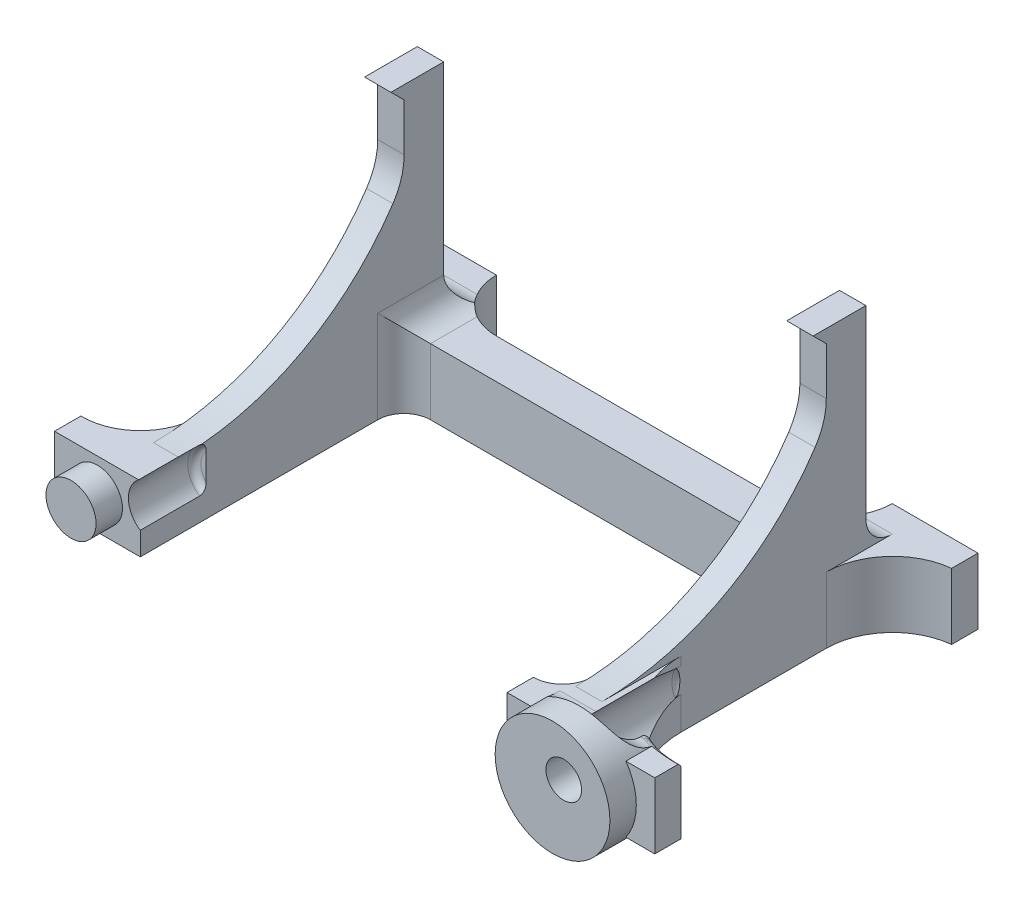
ISO-10303-21;
HEADER;
FILE_DESCRIPTION(('STEP AP214'),'2;1');
FILE_NAME('part.step','',(''),(''),'','','');
FILE_SCHEMA(('AUTOMOTIVE_DESIGN { 1 0 10303 214 1 1 1 1 }'));
ENDSEC;
DATA;
#1=APPLICATION_CONTEXT('core data for automotive mechanical design processes');
#2=APPLICATION_PROTOCOL_DEFINITION('international standard','automotive_design',2000,#1);
#3=PRODUCT_CONTEXT('',#1,'mechanical');
#4=PRODUCT('Part','Part','',(#3));
#5=PRODUCT_RELATED_PRODUCT_CATEGORY('part','',(#4));
#6=PRODUCT_DEFINITION_FORMATION('','',#4);
#7=PRODUCT_DEFINITION_CONTEXT('part definition',#1,'design');
#8=PRODUCT_DEFINITION('design','',#6,#7);
#9=PRODUCT_DEFINITION_SHAPE('','',#8);
#10=(LENGTH_UNIT() NAMED_UNIT(*) SI_UNIT(.MILLI.,.METRE.));
#11=(NAMED_UNIT(*) PLANE_ANGLE_UNIT() SI_UNIT($,.RADIAN.));
#12=(NAMED_UNIT(*) SI_UNIT($,.STERADIAN.) SOLID_ANGLE_UNIT());
#13=UNCERTAINTY_MEASURE_WITH_UNIT(LENGTH_MEASURE(1.E-05),#10,'distance_accuracy_value','');
#14=(GEOMETRIC_REPRESENTATION_CONTEXT(3) GLOBAL_UNCERTAINTY_ASSIGNED_CONTEXT((#13)) GLOBAL_UNIT_ASSIGNED_CONTEXT((#10,
#11,#12)) REPRESENTATION_CONTEXT('',''));
#15=CARTESIAN_POINT('',(0.,0.,0.));
#16=DIRECTION('',(0.,0.,1.));
#17=DIRECTION('',(1.,0.,0.));
#18=AXIS2_PLACEMENT_3D('',#15,#16,#17);
#19=CARTESIAN_POINT('',(0.,2.5,0.));
#20=DIRECTION('',(0.,1.,0.));
#21=DIRECTION('',(0.,0.,1.));
#22=AXIS2_PLACEMENT_3D('',#19,#20,#21);
#23=PLANE('',#22);
#24=DIRECTION('',(0.,0.,1.));
#25=VECTOR('',#24,1.);
#26=CARTESIAN_POINT('',(24.0000000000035,2.5,0.));
#27=LINE('',#26,#25);
#28=CARTESIAN_POINT('',(24.0000000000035,2.5,8.23755399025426));
#29=VERTEX_POINT('',#28);
#30=CARTESIAN_POINT('',(24.0000000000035,2.5,10.));
#31=VERTEX_POINT('',#30);
#32=EDGE_CURVE('E435',#29,#31,#27,.T.);
#33=ORIENTED_EDGE('',*,*,#32,.F.);
#34=CARTESIAN_POINT('',(20.7028197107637,2.50318827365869,7.76377558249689));
#35=CARTESIAN_POINT('',(20.9340160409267,2.52904488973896,7.29284538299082));
#36=CARTESIAN_POINT('',(20.9226317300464,2.00394022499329,7.28727321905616));
#37=CARTESIAN_POINT('',(20.7541231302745,2.50207263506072,7.78409409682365));
#38=CARTESIAN_POINT('',(20.9794725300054,2.52331534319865,7.31498659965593));
#39=CARTESIAN_POINT('',(20.97051492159,2.0025614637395,7.31070979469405));
#40=CARTESIAN_POINT('',(20.8057158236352,2.50127607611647,7.8039397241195));
#41=CARTESIAN_POINT('',(21.025578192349,2.51804239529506,7.33683735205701));
#42=CARTESIAN_POINT('',(21.0186681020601,2.00157703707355,7.33360091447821));
#43=CARTESIAN_POINT('',(20.9094837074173,2.50023998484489,7.84268524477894));
#44=CARTESIAN_POINT('',(21.1186421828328,2.50838870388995,7.37968643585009));
#45=CARTESIAN_POINT('',(21.1155181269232,2.00029658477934,7.3782922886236));
#46=CARTESIAN_POINT('',(20.9616592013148,2.50000075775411,7.86158461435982));
#47=CARTESIAN_POINT('',(21.165610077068,2.50399931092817,7.40069889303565));
#48=CARTESIAN_POINT('',(21.1642152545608,2.00000093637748,7.40009193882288));
#49=CARTESIAN_POINT('',(21.2024199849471,2.49999727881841,7.94613175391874));
#50=CARTESIAN_POINT('',(21.3808370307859,2.48589701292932,7.49409767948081));
#51=CARTESIAN_POINT('',(21.3889253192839,1.99999663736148,7.49761360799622));
#52=CARTESIAN_POINT('',(21.3941589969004,2.50306988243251,8.00602200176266));
#53=CARTESIAN_POINT('',(21.5563261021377,2.47660289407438,7.56240200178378));
#54=CARTESIAN_POINT('',(21.5678817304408,2.00379391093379,7.56669456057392));
#55=CARTESIAN_POINT('',(21.7830568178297,2.51214725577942,8.11287877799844));
#56=CARTESIAN_POINT('',(21.9144706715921,2.464810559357,7.684747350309));
#57=CARTESIAN_POINT('',(21.9308530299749,2.01501217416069,7.6899494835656));
#58=CARTESIAN_POINT('',(21.9802198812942,2.51815439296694,8.1598348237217));
#59=CARTESIAN_POINT('',(22.097871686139,2.46213639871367,7.73940285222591));
#60=CARTESIAN_POINT('',(22.1148718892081,2.02243608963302,7.74411136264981));
#61=CARTESIAN_POINT('',(22.3791933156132,2.53049448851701,8.24061488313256));
#62=CARTESIAN_POINT('',(22.4700651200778,2.46019007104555,7.83343666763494));
#63=CARTESIAN_POINT('',(22.4872470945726,2.03768658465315,7.83728785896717));
#64=CARTESIAN_POINT('',(22.5810150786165,2.53682830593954,8.27440204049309));
#65=CARTESIAN_POINT('',(22.659783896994,2.46086489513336,7.87328266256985));
#66=CARTESIAN_POINT('',(22.675614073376,2.04551422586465,7.87625996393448));
#67=CARTESIAN_POINT('',(22.9874769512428,2.54778562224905,8.32843044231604));
#68=CARTESIAN_POINT('',(23.0420756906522,2.46302341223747,7.93683254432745));
#69=CARTESIAN_POINT('',(23.0549784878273,2.05905581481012,7.93857951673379));
#70=CARTESIAN_POINT('',(23.1921169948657,2.55240916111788,8.34867200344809));
#71=CARTESIAN_POINT('',(23.2356679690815,2.46450400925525,7.96089138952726));
#72=CARTESIAN_POINT('',(23.245975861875,2.06476981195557,7.96192732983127));
#73=CARTESIAN_POINT('',(23.6061447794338,2.55871197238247,8.37567206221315));
#74=CARTESIAN_POINT('',(23.6268107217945,2.46664416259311,7.99282747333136));
#75=CARTESIAN_POINT('',(23.6324017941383,2.07255913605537,7.99307079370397));
#76=CARTESIAN_POINT('',(23.8155559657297,2.56034273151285,8.38220863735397));
#77=CARTESIAN_POINT('',(23.8255242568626,2.46730125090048,8.0006266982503));
#78=CARTESIAN_POINT('',(23.8278522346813,2.07457450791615,8.00061046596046));
#79=CARTESIAN_POINT('',(24.2343502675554,2.56006918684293,8.38108296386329));
#80=CARTESIAN_POINT('',(24.2217375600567,2.46719791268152,7.9992935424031));
#81=CARTESIAN_POINT('',(24.2187269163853,2.07423644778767,7.99931204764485));
#82=CARTESIAN_POINT('',(24.4437333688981,2.55816416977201,8.37341785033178));
#83=CARTESIAN_POINT('',(24.4204020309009,2.46643656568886,7.99014987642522));
#84=CARTESIAN_POINT('',(24.4141511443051,2.07188213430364,7.99047065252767));
#85=CARTESIAN_POINT('',(24.8609281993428,2.55133233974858,8.3439435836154));
#86=CARTESIAN_POINT('',(24.8144560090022,2.46416367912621,7.95529326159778));
#87=CARTESIAN_POINT('',(24.8035329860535,2.06343902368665,7.95647329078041));
#88=CARTESIAN_POINT('',(25.06873984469,2.54640536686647,8.32213368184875));
#89=CARTESIAN_POINT('',(25.0109836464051,2.46264080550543,7.92937508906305));
#90=CARTESIAN_POINT('',(24.997490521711,2.05735002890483,7.93131646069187));
#91=CARTESIAN_POINT('',(25.378096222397,2.53782716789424,8.27895349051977));
#92=CARTESIAN_POINT('',(25.3008951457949,2.46114714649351,7.87878395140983));
#93=CARTESIAN_POINT('',(25.2862231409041,2.04674866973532,7.88150987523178));
#94=CARTESIAN_POINT('',(25.4808227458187,2.53476976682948,8.26281560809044));
#95=CARTESIAN_POINT('',(25.3973523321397,2.46077995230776,7.85982161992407));
#96=CARTESIAN_POINT('',(25.382101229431,2.042970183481,7.8628954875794));
#97=CARTESIAN_POINT('',(25.6853448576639,2.52852642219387,8.22707840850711));
#98=CARTESIAN_POINT('',(25.5888559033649,2.46063508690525,7.81802648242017));
#99=CARTESIAN_POINT('',(25.5729885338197,2.03525435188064,7.82167408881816));
#100=CARTESIAN_POINT('',(25.7871404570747,2.52534048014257,8.20747913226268));
#101=CARTESIAN_POINT('',(25.6840273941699,2.46086175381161,7.79513489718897));
#102=CARTESIAN_POINT('',(25.6679977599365,2.03131700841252,7.79906712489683));
#103=CARTESIAN_POINT('',(25.8884002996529,2.52222391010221,8.18616250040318));
#104=CARTESIAN_POINT('',(25.7779446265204,2.46155411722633,7.77046286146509));
#105=CARTESIAN_POINT('',(25.7625069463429,2.02746539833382,7.77447926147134));
#106=(BOUNDED_SURFACE() B_SPLINE_SURFACE(3,2,((#34,#35,#36),(#37,#38,#39),(#40,#41,#42),(#43,
#44,#45),(#46,#47,#48),(#49,#50,#51),(#52,#53,#54),(#55,#56,#57),(#58,#59,#60),(#61,#62,#63),
(#64,#65,#66),(#67,#68,#69),(#70,#71,#72),(#73,#74,#75),(#76,#77,#78),(#79,#80,#81),(#82,#83,
#84),(#85,#86,#87),(#88,#89,#90),(#91,#92,#93),(#94,#95,#96),(#97,#98,#99),(#100,#101,#102),
(#103,#104,#105)),.UNSPECIFIED.,.F.,.F.,.F.) B_SPLINE_SURFACE_WITH_KNOTS((4,2,2,2,2,2,2,2,2,2,2,
4),(3,3),(0.,0.171389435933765,0.34287271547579,0.958688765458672,1.57500245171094,
2.19302886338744,2.8110408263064,3.43898522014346,4.06705630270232,4.69516062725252,
5.00922049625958,5.32327665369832),(0.,1.),
.UNSPECIFIED.) GEOMETRIC_REPRESENTATION_ITEM() RATIONAL_B_SPLINE_SURFACE(((1.,0.689477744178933,
1.),(1.,0.69253251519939,1.),(1.,0.695530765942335,1.),(1.,0.701409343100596,1.),(1.,
0.704289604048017,1.),(1.,0.717223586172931,1.),(1.,0.726526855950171,1.),(1.,0.743270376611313,
1.),(1.,0.750709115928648,1.),(1.,0.763578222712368,1.),(1.,0.769002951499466,1.),(1.,
0.777704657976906,1.),(1.,0.780981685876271,1.),(1.,0.785357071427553,1.),(1.,0.786419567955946,
1.),(1.,0.78623682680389,1.),(1.,0.784991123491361,1.),(1.,0.780216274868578,1.),(1.,
0.776687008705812,1.),(1.,0.769738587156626,1.),(1.,0.767146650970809,1.),(1.,0.761425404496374,
1.),(1.,0.758296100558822,1.),(1.,0.754905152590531,1.))) REPRESENTATION_ITEM('') SURFACE());
#107=CARTESIAN_POINT('',(24.0000000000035,2.5,8.23755399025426));
#108=CARTESIAN_POINT('',(23.6661708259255,2.5,8.23763175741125));
#109=CARTESIAN_POINT('',(23.3325458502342,2.5,8.22367675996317));
#110=CARTESIAN_POINT('',(22.7714066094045,2.5,8.17795543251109));
#111=CARTESIAN_POINT('',(22.5433231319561,2.5,8.15312048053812));
#112=CARTESIAN_POINT('',(22.0552280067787,2.5,8.08707645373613));
#113=CARTESIAN_POINT('',(21.7954678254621,2.5,8.04399286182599));
#114=CARTESIAN_POINT('',(21.537182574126,2.5,7.99355302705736));
#115=B_SPLINE_CURVE_WITH_KNOTS('',3,(#107,#108,#109,#110,#111,#112,#113,#114),.UNSPECIFIED.,.F.,
.F.,(4,2,2,4),(0.,1.0008390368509,1.68881992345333,2.47825133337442),.UNSPECIFIED.);
#116=CARTESIAN_POINT('',(21.8098455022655,2.5,8.04400956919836));
#117=VERTEX_POINT('',#116);
#118=EDGE_CURVE('E1004',#29,#117,#115,.T.);
#119=ORIENTED_EDGE('',*,*,#118,.T.);
#120=DIRECTION('',(0.,0.,-1.));
#121=VECTOR('',#120,1.);
#122=CARTESIAN_POINT('',(21.8098455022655,2.5,7.88));
#123=LINE('',#122,#121);
#124=CARTESIAN_POINT('',(21.8098455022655,2.5,10.));
#125=VERTEX_POINT('',#124);
#126=EDGE_CURVE('E735',#117,#125,#123,.F.);
#127=ORIENTED_EDGE('',*,*,#126,.T.);
#128=DIRECTION('',(1.,0.,0.));
#129=VECTOR('',#128,1.);
#130=CARTESIAN_POINT('',(0.,2.5,10.));
#131=LINE('',#130,#129);
#132=EDGE_CURVE('E431',#125,#31,#131,.T.);
#133=ORIENTED_EDGE('',*,*,#132,.T.);
#134=EDGE_LOOP('',(#33,#119,#127,#133));
#135=FACE_BOUND('',#134,.T.);
#136=ADVANCED_FACE('F40',(#135),#23,.T.);
#137=DIRECTION('',(0.,0.,1.));
#138=VECTOR('',#137,1.);
#139=CARTESIAN_POINT('',(17.4285934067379,2.5,1.));
#140=LINE('',#139,#138);
#141=CARTESIAN_POINT('',(17.4285934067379,2.5,3.41176603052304));
#142=VERTEX_POINT('',#141);
#143=CARTESIAN_POINT('',(17.4285934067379,2.5,7.88));
#144=VERTEX_POINT('',#143);
#145=EDGE_CURVE('E823',#142,#144,#140,.T.);
#146=ORIENTED_EDGE('',*,*,#145,.F.);
#147=CARTESIAN_POINT('',(24.0000000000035,2.5,0.999999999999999));
#148=DIRECTION('',(0.,1.,0.));
#149=DIRECTION('',(0.,0.,1.));
#150=AXIS2_PLACEMENT_3D('',#147,#148,#149);
#151=CIRCLE('',#150,7.);
#152=CARTESIAN_POINT('',(17.0000000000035,2.5,0.999999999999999));
#153=VERTEX_POINT('',#152);
#154=EDGE_CURVE('E437',#153,#142,#151,.T.);
#155=ORIENTED_EDGE('',*,*,#154,.F.);
#156=DIRECTION('',(0.,0.,-1.));
#157=VECTOR('',#156,1.);
#158=CARTESIAN_POINT('',(17.,2.5,-13.));
#159=LINE('',#158,#157);
#160=CARTESIAN_POINT('',(17.,2.5,6.99999999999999));
#161=VERTEX_POINT('',#160);
#162=EDGE_CURVE('E1065',#161,#153,#159,.T.);
#163=ORIENTED_EDGE('',*,*,#162,.F.);
#164=DIRECTION('',(-1.,0.,0.));
#165=VECTOR('',#164,1.);
#166=CARTESIAN_POINT('',(17.,2.5,6.99999999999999));
#167=LINE('',#166,#165);
#168=CARTESIAN_POINT('',(15.,2.5,6.99999999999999));
#169=VERTEX_POINT('',#168);
#170=EDGE_CURVE('E1062',#161,#169,#167,.T.);
#171=ORIENTED_EDGE('',*,*,#170,.T.);
#172=DIRECTION('',(0.,0.,-1.));
#173=VECTOR('',#172,1.);
#174=CARTESIAN_POINT('',(15.,2.5,-13.));
#175=LINE('',#174,#173);
#176=CARTESIAN_POINT('',(15.,2.5,5.8));
#177=VERTEX_POINT('',#176);
#178=EDGE_CURVE('E681',#169,#177,#175,.T.);
#179=ORIENTED_EDGE('',*,*,#178,.T.);
#180=CARTESIAN_POINT('',(12.8,2.5,5.8));
#181=DIRECTION('',(0.,1.,0.));
#182=DIRECTION('',(0.,0.,1.));
#183=AXIS2_PLACEMENT_3D('',#180,#181,#182);
#184=CIRCLE('',#183,2.2);
#185=CARTESIAN_POINT('',(12.8,2.5,8.));
#186=VERTEX_POINT('',#185);
#187=EDGE_CURVE('E421',#186,#177,#184,.T.);
#188=ORIENTED_EDGE('',*,*,#187,.F.);
#189=DIRECTION('',(0.,0.,1.));
#190=VECTOR('',#189,1.);
#191=CARTESIAN_POINT('',(12.8,2.5,0.));
#192=LINE('',#191,#190);
#193=CARTESIAN_POINT('',(12.8,2.5,10.));
#194=VERTEX_POINT('',#193);
#195=EDGE_CURVE('E429',#186,#194,#192,.T.);
#196=ORIENTED_EDGE('',*,*,#195,.T.);
#197=CARTESIAN_POINT('',(14.6901544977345,2.5,10.));
#198=VERTEX_POINT('',#197);
#199=EDGE_CURVE('E432',#194,#198,#131,.T.);
#200=ORIENTED_EDGE('',*,*,#199,.T.);
#201=DIRECTION('',(0.,0.,-1.));
#202=VECTOR('',#201,1.);
#203=CARTESIAN_POINT('',(14.6901544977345,2.5,10.));
#204=LINE('',#203,#202);
#205=CARTESIAN_POINT('',(14.6901544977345,2.5,7.88));
#206=VERTEX_POINT('',#205);
#207=EDGE_CURVE('E728',#198,#206,#204,.T.);
#208=ORIENTED_EDGE('',*,*,#207,.T.);
#209=DIRECTION('',(1.,0.,0.));
#210=VECTOR('',#209,1.);
#211=CARTESIAN_POINT('',(0.,2.5,7.88));
#212=LINE('',#211,#210);
#213=EDGE_CURVE('E732',#206,#144,#212,.T.);
#214=ORIENTED_EDGE('',*,*,#213,.T.);
#215=EDGE_LOOP('',(#146,#155,#163,#171,#179,#188,#196,#200,#208,#214));
#216=FACE_BOUND('',#215,.T.);
#217=ADVANCED_FACE('F994',(#216),#23,.T.);
#218=CARTESIAN_POINT('',(24.0000000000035,2.5,0.999999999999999));
#219=DIRECTION('',(0.,-1.,0.));
#220=DIRECTION('',(0.,0.,-1.));
#221=AXIS2_PLACEMENT_3D('',#218,#219,#220);
#222=CYLINDRICAL_SURFACE('',#221,7.);
#223=CARTESIAN_POINT('',(20.7714065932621,2.5,7.21097292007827));
#224=CARTESIAN_POINT('',(20.8110752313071,2.45805042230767,7.23159485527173));
#225=CARTESIAN_POINT('',(20.8494382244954,2.41428936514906,7.25105257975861));
#226=CARTESIAN_POINT('',(20.9231581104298,2.32339167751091,7.2876652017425));
#227=CARTESIAN_POINT('',(20.9585145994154,2.27625459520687,7.30481979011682));
#228=CARTESIAN_POINT('',(21.0258117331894,2.17886953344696,7.33684427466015));
#229=CARTESIAN_POINT('',(21.0577527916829,2.12862193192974,7.35171444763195));
#230=CARTESIAN_POINT('',(21.1178602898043,2.02535745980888,7.37921313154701));
#231=CARTESIAN_POINT('',(21.1460270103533,1.97234079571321,7.39184180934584));
#232=CARTESIAN_POINT('',(21.2244542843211,1.80948347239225,7.42647954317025));
#233=CARTESIAN_POINT('',(21.268602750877,1.69589183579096,7.44522212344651));
#234=CARTESIAN_POINT('',(21.3384820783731,1.46228997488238,7.47439342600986));
#235=CARTESIAN_POINT('',(21.3642224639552,1.34228310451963,7.48482644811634));
#236=CARTESIAN_POINT('',(21.3959940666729,1.10139727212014,7.49764901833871));
#237=CARTESIAN_POINT('',(21.4023615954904,0.980570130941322,7.50017583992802));
#238=CARTESIAN_POINT('',(21.3960738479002,0.739465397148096,7.4976596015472));
#239=CARTESIAN_POINT('',(21.3834143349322,0.619187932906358,7.49261485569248));
#240=CARTESIAN_POINT('',(21.3396744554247,0.383155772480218,7.47481388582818));
#241=CARTESIAN_POINT('',(21.3086727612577,0.267383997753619,7.46209059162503));
#242=CARTESIAN_POINT('',(21.2295942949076,0.0430935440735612,7.42858329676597));
#243=CARTESIAN_POINT('',(21.1815204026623,-0.0654263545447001,7.4078006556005));
#244=CARTESIAN_POINT('',(21.0700500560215,-0.272824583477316,7.35760406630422));
#245=CARTESIAN_POINT('',(21.0065782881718,-0.371652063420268,7.32814753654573));
#246=CARTESIAN_POINT('',(20.8671967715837,-0.556628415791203,7.26031416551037));
#247=CARTESIAN_POINT('',(20.7912866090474,-0.642776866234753,7.22193702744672));
#248=CARTESIAN_POINT('',(20.6279810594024,-0.802999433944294,7.13500302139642));
#249=CARTESIAN_POINT('',(20.5403220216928,-0.876664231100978,7.08618945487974));
#250=CARTESIAN_POINT('',(20.3589255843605,-1.00812601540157,6.97943591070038));
#251=CARTESIAN_POINT('',(20.2651864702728,-1.0659185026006,6.92149335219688));
#252=CARTESIAN_POINT('',(20.0667935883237,-1.17020080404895,6.79181381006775));
#253=CARTESIAN_POINT('',(19.9618984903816,-1.21527488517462,6.71931615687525));
#254=CARTESIAN_POINT('',(19.7525477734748,-1.28827810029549,6.56561181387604));
#255=CARTESIAN_POINT('',(19.6480924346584,-1.31619758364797,6.48440025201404));
#256=CARTESIAN_POINT('',(19.4671790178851,-1.35189669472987,6.33514759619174));
#257=CARTESIAN_POINT('',(19.3900445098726,-1.36290964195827,6.26865396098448));
#258=CARTESIAN_POINT('',(19.2383516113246,-1.37709873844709,6.13197297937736));
#259=CARTESIAN_POINT('',(19.1637943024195,-1.38027163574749,6.06178411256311));
#260=CARTESIAN_POINT('',(18.9447128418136,-1.37940113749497,5.84623120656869));
#261=CARTESIAN_POINT('',(18.8049221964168,-1.36494407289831,5.69599872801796));
#262=CARTESIAN_POINT('',(18.5757965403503,-1.32164788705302,5.42725021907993));
#263=CARTESIAN_POINT('',(18.482896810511,-1.297625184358,5.31085753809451));
#264=CARTESIAN_POINT('',(18.3056246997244,-1.24047125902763,5.07381598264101));
#265=CARTESIAN_POINT('',(18.2212569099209,-1.20733516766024,4.95316486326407));
#266=CARTESIAN_POINT('',(17.9805180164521,-1.09693670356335,4.58497966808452));
#267=CARTESIAN_POINT('',(17.8372192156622,-1.00884692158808,4.33205210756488));
#268=CARTESIAN_POINT('',(17.6204872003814,-0.844637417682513,3.88867033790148));
#269=CARTESIAN_POINT('',(17.5387507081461,-0.772158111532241,3.70073525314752));
#270=CARTESIAN_POINT('',(17.3921594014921,-0.624051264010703,3.31911430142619));
#271=CARTESIAN_POINT('',(17.3273323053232,-0.548418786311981,3.12541956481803));
#272=CARTESIAN_POINT('',(17.2430686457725,-0.437917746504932,2.83142204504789));
#273=CARTESIAN_POINT('',(17.217248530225,-0.401762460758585,2.73338455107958));
#274=CARTESIAN_POINT('',(17.1697601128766,-0.331386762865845,2.53563155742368));
#275=CARTESIAN_POINT('',(17.1480908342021,-0.297165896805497,2.43591645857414));
#276=CARTESIAN_POINT('',(17.1090143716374,-0.232133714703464,2.23482177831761));
#277=CARTESIAN_POINT('',(17.0915969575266,-0.201314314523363,2.13344683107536));
#278=CARTESIAN_POINT('',(17.0611013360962,-0.144857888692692,1.92864809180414));
#279=CARTESIAN_POINT('',(17.048019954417,-0.11921707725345,1.82522585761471));
#280=CARTESIAN_POINT('',(17.0311214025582,-0.0849539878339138,1.66198620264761));
#281=CARTESIAN_POINT('',(17.0257537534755,-0.0737908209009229,1.60286053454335));
#282=CARTESIAN_POINT('',(17.0165008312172,-0.0542419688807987,1.48403546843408));
#283=CARTESIAN_POINT('',(17.0126153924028,-0.0458559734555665,1.4243361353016));
#284=CARTESIAN_POINT('',(17.0063437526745,-0.0321892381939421,1.30401595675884));
#285=CARTESIAN_POINT('',(17.0039697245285,-0.0269337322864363,1.24339155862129));
#286=CARTESIAN_POINT('',(17.0007954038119,-0.0198636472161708,1.12184933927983));
#287=CARTESIAN_POINT('',(16.9999965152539,-0.0180521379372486,1.0609313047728));
#288=CARTESIAN_POINT('',(17.0000000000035,-0.0180831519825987,0.999999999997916));
#289=B_SPLINE_CURVE_WITH_KNOTS('',3,(#223,#224,#225,#226,#227,#228,#229,#230,#231,#232,#233,
#234,#235,#236,#237,#238,#239,#240,#241,#242,#243,#244,#245,#246,#247,#248,#249,#250,#251,#252,
#253,#254,#255,#256,#257,#258,#259,#260,#261,#262,#263,#264,#265,#266,#267,#268,#269,#270,#271,
#272,#273,#274,#275,#276,#277,#278,#279,#280,#281,#282,#283,#284,#285,#286,#287,#288),
.UNSPECIFIED.,.F.,.F.,(4,2,2,2,2,2,2,2,2,2,2,2,2,2,2,2,2,2,2,2,2,2,2,2,2,2,2,2,2,2,2,2,4),(0.,
0.183875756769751,0.367776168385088,0.551654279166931,0.735518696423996,1.10345783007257,
1.47120644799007,1.83253345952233,2.19394093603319,2.55380940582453,2.9136171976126,
3.27522166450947,3.63683816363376,4.00865897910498,4.38058510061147,4.78478113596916,
5.18920435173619,5.49608854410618,5.80310000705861,6.4176768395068,6.86967174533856,
7.32190859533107,8.22967063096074,8.8811858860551,9.53376250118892,9.85658873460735,
10.1793388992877,10.5013046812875,10.8230342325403,11.0041912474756,11.1853280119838,
11.36790577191,11.5506462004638),.UNSPECIFIED.);
#290=CARTESIAN_POINT('',(21.1306649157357,2.,7.38489750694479));
#291=VERTEX_POINT('',#290);
#292=CARTESIAN_POINT('',(17.0000000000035,-0.0180831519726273,1.));
#293=VERTEX_POINT('',#292);
#294=EDGE_CURVE('E688',#291,#293,#289,.T.);
#295=ORIENTED_EDGE('',*,*,#294,.F.);
#296=CARTESIAN_POINT('',(24.0000000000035,2.,0.999999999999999));
#297=DIRECTION('',(0.,1.,0.));
#298=DIRECTION('',(0.,0.,1.));
#299=AXIS2_PLACEMENT_3D('',#296,#297,#298);
#300=CIRCLE('',#299,7.);
#301=CARTESIAN_POINT('',(21.2131598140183,2.,7.42133333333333));
#302=VERTEX_POINT('',#301);
#303=EDGE_CURVE('E852',#291,#302,#300,.T.);
#304=ORIENTED_EDGE('',*,*,#303,.T.);
#305=CARTESIAN_POINT('',(20.9226317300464,2.00394022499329,7.28727321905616));
#306=CARTESIAN_POINT('',(20.97051492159,2.0025614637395,7.31070979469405));
#307=CARTESIAN_POINT('',(21.0186681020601,2.00157703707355,7.33360091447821));
#308=CARTESIAN_POINT('',(21.1155181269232,2.00029658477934,7.3782922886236));
#309=CARTESIAN_POINT('',(21.1642152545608,2.00000093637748,7.40009193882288));
#310=CARTESIAN_POINT('',(21.3889253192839,1.99999663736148,7.49761360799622));
#311=CARTESIAN_POINT('',(21.5678817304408,2.00379391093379,7.56669456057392));
#312=CARTESIAN_POINT('',(21.9308530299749,2.01501217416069,7.6899494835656));
#313=CARTESIAN_POINT('',(22.1148718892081,2.02243608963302,7.7441113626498));
#314=CARTESIAN_POINT('',(22.4872470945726,2.03768658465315,7.83728785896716));
#315=CARTESIAN_POINT('',(22.675614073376,2.04551422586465,7.87625996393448));
#316=CARTESIAN_POINT('',(23.0549784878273,2.05905581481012,7.93857951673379));
#317=CARTESIAN_POINT('',(23.245975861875,2.06476981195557,7.96192732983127));
#318=CARTESIAN_POINT('',(23.6324017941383,2.07255913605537,7.99307079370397));
#319=CARTESIAN_POINT('',(23.8278522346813,2.07457450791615,8.00061046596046));
#320=CARTESIAN_POINT('',(24.2187269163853,2.07423644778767,7.99931204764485));
#321=CARTESIAN_POINT('',(24.4141511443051,2.07188213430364,7.99047065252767));
#322=CARTESIAN_POINT('',(24.8035329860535,2.06343902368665,7.95647329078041));
#323=CARTESIAN_POINT('',(24.997490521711,2.05735002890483,7.93131646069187));
#324=CARTESIAN_POINT('',(25.2862231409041,2.04674866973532,7.88150987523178));
#325=CARTESIAN_POINT('',(25.382101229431,2.042970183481,7.8628954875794));
#326=CARTESIAN_POINT('',(25.5729885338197,2.03525435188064,7.82167408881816));
#327=CARTESIAN_POINT('',(25.6679977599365,2.03131700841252,7.79906712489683));
#328=CARTESIAN_POINT('',(25.7625069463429,2.02746539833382,7.77447926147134));
#329=B_SPLINE_CURVE_WITH_KNOTS('',3,(#305,#306,#307,#308,#309,#310,#311,#312,#313,#314,#315,
#316,#317,#318,#319,#320,#321,#322,#323,#324,#325,#326,#327,#328),.UNSPECIFIED.,.F.,.F.,(4,2,2,
2,2,2,2,2,2,2,2,4),(0.,0.171389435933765,0.34287271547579,0.958688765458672,1.57500245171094,
2.19302886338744,2.8110408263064,3.43898522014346,4.06705630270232,4.69516062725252,
5.00922049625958,5.32327665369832),.UNSPECIFIED.);
#330=CARTESIAN_POINT('',(24.0000000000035,2.07441558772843,8.));
#331=VERTEX_POINT('',#330);
#332=EDGE_CURVE('E845',#302,#331,#329,.T.);
#333=ORIENTED_EDGE('',*,*,#332,.T.);
#334=DIRECTION('',(0.,-1.,0.));
#335=VECTOR('',#334,1.);
#336=CARTESIAN_POINT('',(24.0000000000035,2.5,8.));
#337=LINE('',#336,#335);
#338=CARTESIAN_POINT('',(24.0000000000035,-2.5,8.));
#339=VERTEX_POINT('',#338);
#340=EDGE_CURVE('E522',#331,#339,#337,.T.);
#341=ORIENTED_EDGE('',*,*,#340,.T.);
#342=CARTESIAN_POINT('',(24.0000000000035,-2.5,0.999999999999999));
#343=DIRECTION('',(0.,1.,0.));
#344=DIRECTION('',(0.,0.,1.));
#345=AXIS2_PLACEMENT_3D('',#342,#343,#344);
#346=CIRCLE('',#345,7.);
#347=CARTESIAN_POINT('',(17.0000000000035,-2.5,0.999999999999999));
#348=VERTEX_POINT('',#347);
#349=EDGE_CURVE('E500',#348,#339,#346,.T.);
#350=ORIENTED_EDGE('',*,*,#349,.F.);
#351=DIRECTION('',(0.,-1.,0.));
#352=VECTOR('',#351,1.);
#353=CARTESIAN_POINT('',(17.0000000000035,2.5,0.999999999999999));
#354=LINE('',#353,#352);
#355=EDGE_CURVE('E518',#293,#348,#354,.T.);
#356=ORIENTED_EDGE('',*,*,#355,.F.);
#357=EDGE_LOOP('',(#295,#304,#333,#341,#350,#356));
#358=FACE_BOUND('',#357,.T.);
#359=ADVANCED_FACE('F802',(#358),#222,.F.);
#360=CARTESIAN_POINT('',(11.0000000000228,2.5,-17.0000000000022));
#361=DIRECTION('',(0.,1.,0.));
#362=DIRECTION('',(0.,0.,1.));
#363=AXIS2_PLACEMENT_3D('',#360,#361,#362);
#364=CIRCLE('',#363,4.00000000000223);
#365=CARTESIAN_POINT('',(15.000000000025,2.5,-17.));
#366=VERTEX_POINT('',#365);
#367=CARTESIAN_POINT('',(14.4641016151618,2.5,-15.));
#368=VERTEX_POINT('',#367);
#369=EDGE_CURVE('E940',#366,#368,#364,.F.);
#370=ORIENTED_EDGE('',*,*,#369,.T.);
#371=DIRECTION('',(-1.,0.,0.));
#372=VECTOR('',#371,1.);
#373=CARTESIAN_POINT('',(0.,2.5,-15.));
#374=LINE('',#373,#372);
#375=CARTESIAN_POINT('',(17.,2.5,-15.));
#376=VERTEX_POINT('',#375);
#377=EDGE_CURVE('E566',#368,#376,#374,.F.);
#378=ORIENTED_EDGE('',*,*,#377,.T.);
#379=DIRECTION('',(0.,0.,1.));
#380=VECTOR('',#379,1.);
#381=CARTESIAN_POINT('',(17.,2.5,0.));
#382=LINE('',#381,#380);
#383=CARTESIAN_POINT('',(17.0000000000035,2.5,-10.));
#384=VERTEX_POINT('',#383);
#385=EDGE_CURVE('E560',#376,#384,#382,.T.);
#386=ORIENTED_EDGE('',*,*,#385,.T.);
#387=CARTESIAN_POINT('',(22.0277777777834,2.5,-10.));
#388=DIRECTION('',(0.,1.,0.));
#389=DIRECTION('',(0.,0.,1.));
#390=AXIS2_PLACEMENT_3D('',#387,#388,#389);
#391=CIRCLE('',#390,5.02777777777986);
#392=CARTESIAN_POINT('',(21.4999999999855,2.5,-15.));
#393=VERTEX_POINT('',#392);
#394=EDGE_CURVE('E440',#384,#393,#391,.F.);
#395=ORIENTED_EDGE('',*,*,#394,.T.);
#396=DIRECTION('',(0.,0.,1.));
#397=VECTOR('',#396,1.);
#398=CARTESIAN_POINT('',(21.4999999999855,2.5,0.));
#399=LINE('',#398,#397);
#400=CARTESIAN_POINT('',(21.4999999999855,2.5,-17.));
#401=VERTEX_POINT('',#400);
#402=EDGE_CURVE('E442',#401,#393,#399,.T.);
#403=ORIENTED_EDGE('',*,*,#402,.F.);
#404=DIRECTION('',(-1.,0.,0.));
#405=VECTOR('',#404,1.);
#406=CARTESIAN_POINT('',(0.,2.5,-17.));
#407=LINE('',#406,#405);
#408=EDGE_CURVE('E511',#401,#366,#407,.T.);
#409=ORIENTED_EDGE('',*,*,#408,.T.);
#410=EDGE_LOOP('',(#370,#378,#386,#395,#403,#409));
#411=FACE_BOUND('',#410,.T.);
#412=ADVANCED_FACE('F938',(#411),#23,.T.);
#413=DIRECTION('',(0.,0.,-1.));
#414=VECTOR('',#413,1.);
#415=CARTESIAN_POINT('',(-17.,2.5,-13.));
#416=LINE('',#415,#414);
#417=CARTESIAN_POINT('',(-17.0000000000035,2.5,-10.));
#418=VERTEX_POINT('',#417);
#419=CARTESIAN_POINT('',(-17.,2.5,-15.));
#420=VERTEX_POINT('',#419);
#421=EDGE_CURVE('E1563',#418,#420,#416,.T.);
#422=ORIENTED_EDGE('',*,*,#421,.T.);
#423=DIRECTION('',(1.,0.,0.));
#424=VECTOR('',#423,1.);
#425=CARTESIAN_POINT('',(-15.,2.5,-15.));
#426=LINE('',#425,#424);
#427=CARTESIAN_POINT('',(-14.4641016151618,2.5,-15.));
#428=VERTEX_POINT('',#427);
#429=EDGE_CURVE('E569',#420,#428,#426,.T.);
#430=ORIENTED_EDGE('',*,*,#429,.T.);
#431=CARTESIAN_POINT('',(-11.0000000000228,2.5,-17.0000000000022));
#432=DIRECTION('',(0.,1.,0.));
#433=DIRECTION('',(0.,0.,1.));
#434=AXIS2_PLACEMENT_3D('',#431,#432,#433);
#435=CIRCLE('',#434,4.00000000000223);
#436=CARTESIAN_POINT('',(-15.000000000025,2.5,-17.));
#437=VERTEX_POINT('',#436);
#438=EDGE_CURVE('E950',#437,#428,#435,.T.);
#439=ORIENTED_EDGE('',*,*,#438,.F.);
#440=DIRECTION('',(1.,0.,0.));
#441=VECTOR('',#440,1.);
#442=CARTESIAN_POINT('',(0.,2.5,-17.));
#443=LINE('',#442,#441);
#444=CARTESIAN_POINT('',(-21.4999999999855,2.5,-17.));
#445=VERTEX_POINT('',#444);
#446=EDGE_CURVE('E953',#445,#437,#443,.T.);
#447=ORIENTED_EDGE('',*,*,#446,.F.);
#448=DIRECTION('',(0.,0.,1.));
#449=VECTOR('',#448,1.);
#450=CARTESIAN_POINT('',(-21.4999999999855,2.5,0.));
#451=LINE('',#450,#449);
#452=CARTESIAN_POINT('',(-21.4999999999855,2.5,-15.));
#453=VERTEX_POINT('',#452);
#454=EDGE_CURVE('E956',#445,#453,#451,.T.);
#455=ORIENTED_EDGE('',*,*,#454,.T.);
#456=CARTESIAN_POINT('',(-22.0277777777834,2.5,-10.));
#457=DIRECTION('',(0.,1.,0.));
#458=DIRECTION('',(0.,0.,1.));
#459=AXIS2_PLACEMENT_3D('',#456,#457,#458);
#460=CIRCLE('',#459,5.02777777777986);
#461=EDGE_CURVE('E958',#418,#453,#460,.T.);
#462=ORIENTED_EDGE('',*,*,#461,.F.);
#463=EDGE_LOOP('',(#422,#430,#439,#447,#455,#462));
#464=FACE_BOUND('',#463,.T.);
#465=ADVANCED_FACE('F1016',(#464),#23,.T.);
#466=DIRECTION('',(0.,0.,1.));
#467=VECTOR('',#466,1.);
#468=CARTESIAN_POINT('',(-15.1262136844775,2.5,5.));
#469=LINE('',#468,#467);
#470=CARTESIAN_POINT('',(-15.1262136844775,2.5,7.));
#471=VERTEX_POINT('',#470);
#472=CARTESIAN_POINT('',(-15.1262136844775,2.5,10.));
#473=VERTEX_POINT('',#472);
#474=EDGE_CURVE('E392',#471,#473,#469,.T.);
#475=ORIENTED_EDGE('',*,*,#474,.F.);
#476=DIRECTION('',(1.,0.,0.));
#477=VECTOR('',#476,1.);
#478=CARTESIAN_POINT('',(-17.,2.5,6.99999999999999));
#479=LINE('',#478,#477);
#480=CARTESIAN_POINT('',(-17.,2.5,6.99999999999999));
#481=VERTEX_POINT('',#480);
#482=EDGE_CURVE('E1611',#481,#471,#479,.T.);
#483=ORIENTED_EDGE('',*,*,#482,.F.);
#484=CARTESIAN_POINT('',(-16.9999999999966,2.5,3.60113651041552));
#485=VERTEX_POINT('',#484);
#486=EDGE_CURVE('E963',#481,#485,#416,.T.);
#487=ORIENTED_EDGE('',*,*,#486,.T.);
#488=CARTESIAN_POINT('',(-21.3999999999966,2.5,3.60113651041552));
#489=DIRECTION('',(0.,1.,0.));
#490=DIRECTION('',(0.,0.,1.));
#491=AXIS2_PLACEMENT_3D('',#488,#489,#490);
#492=CIRCLE('',#491,4.4);
#493=CARTESIAN_POINT('',(-21.4999999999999,2.5,8.));
#494=VERTEX_POINT('',#493);
#495=EDGE_CURVE('E423',#485,#494,#492,.F.);
#496=ORIENTED_EDGE('',*,*,#495,.T.);
#497=DIRECTION('',(0.,0.,-1.));
#498=VECTOR('',#497,1.);
#499=CARTESIAN_POINT('',(-21.4999999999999,2.5,0.));
#500=LINE('',#499,#498);
#501=CARTESIAN_POINT('',(-21.4999999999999,2.5,10.));
#502=VERTEX_POINT('',#501);
#503=EDGE_CURVE('E417',#502,#494,#500,.T.);
#504=ORIENTED_EDGE('',*,*,#503,.F.);
#505=DIRECTION('',(-1.,0.,0.));
#506=VECTOR('',#505,1.);
#507=CARTESIAN_POINT('',(0.,2.5,10.));
#508=LINE('',#507,#506);
#509=EDGE_CURVE('E408',#473,#502,#508,.T.);
#510=ORIENTED_EDGE('',*,*,#509,.F.);
#511=EDGE_LOOP('',(#475,#483,#487,#496,#504,#510));
#512=FACE_BOUND('',#511,.T.);
#513=ADVANCED_FACE('F415',(#512),#23,.T.);
#514=DIRECTION('',(1.,0.,0.));
#515=VECTOR('',#514,1.);
#516=CARTESIAN_POINT('',(0.,2.5,-10.));
#517=LINE('',#516,#515);
#518=CARTESIAN_POINT('',(-13.,2.5,-10.));
#519=VERTEX_POINT('',#518);
#520=CARTESIAN_POINT('',(13.,2.5,-10.));
#521=VERTEX_POINT('',#520);
#522=EDGE_CURVE('E418',#519,#521,#517,.T.);
#523=ORIENTED_EDGE('',*,*,#522,.T.);
#524=DIRECTION('',(0.,0.,1.));
#525=VECTOR('',#524,1.);
#526=CARTESIAN_POINT('',(13.,2.5,0.));
#527=LINE('',#526,#525);
#528=CARTESIAN_POINT('',(13.,2.5,-13.5358983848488));
#529=VERTEX_POINT('',#528);
#530=EDGE_CURVE('E564',#521,#529,#527,.F.);
#531=ORIENTED_EDGE('',*,*,#530,.T.);
#532=CARTESIAN_POINT('',(11.0000000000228,2.5,-13.));
#533=VERTEX_POINT('',#532);
#534=EDGE_CURVE('E942',#529,#533,#364,.F.);
#535=ORIENTED_EDGE('',*,*,#534,.T.);
#536=DIRECTION('',(1.,0.,0.));
#537=VECTOR('',#536,1.);
#538=CARTESIAN_POINT('',(0.,2.5,-13.));
#539=LINE('',#538,#537);
#540=CARTESIAN_POINT('',(-11.0000000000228,2.5,-13.));
#541=VERTEX_POINT('',#540);
#542=EDGE_CURVE('E941',#541,#533,#539,.T.);
#543=ORIENTED_EDGE('',*,*,#542,.F.);
#544=CARTESIAN_POINT('',(-13.,2.5,-13.5358983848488));
#545=VERTEX_POINT('',#544);
#546=EDGE_CURVE('E945',#545,#541,#435,.T.);
#547=ORIENTED_EDGE('',*,*,#546,.F.);
#548=DIRECTION('',(0.,0.,-1.));
#549=VECTOR('',#548,1.);
#550=CARTESIAN_POINT('',(-13.,2.5,0.));
#551=LINE('',#550,#549);
#552=EDGE_CURVE('E562',#545,#519,#551,.F.);
#553=ORIENTED_EDGE('',*,*,#552,.T.);
#554=EDGE_LOOP('',(#523,#531,#535,#543,#547,#553));
#555=FACE_BOUND('',#554,.T.);
#556=ADVANCED_FACE('F1015',(#555),#23,.T.);
#557=CARTESIAN_POINT('',(20.7714065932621,2.5,7.88));
#558=VERTEX_POINT('',#557);
#559=CARTESIAN_POINT('',(21.0140998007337,2.5,7.88));
#560=VERTEX_POINT('',#559);
#561=EDGE_CURVE('E731',#558,#560,#212,.T.);
#562=ORIENTED_EDGE('',*,*,#561,.T.);
#563=CARTESIAN_POINT('',(24.0000000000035,2.5,0.999999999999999));
#564=DIRECTION('',(0.,1.,0.));
#565=DIRECTION('',(0.,0.,1.));
#566=AXIS2_PLACEMENT_3D('',#563,#564,#565);
#567=CIRCLE('',#566,7.5);
#568=CARTESIAN_POINT('',(20.7714065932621,2.5,7.76950401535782));
#569=VERTEX_POINT('',#568);
#570=EDGE_CURVE('E907',#560,#569,#567,.F.);
#571=ORIENTED_EDGE('',*,*,#570,.T.);
#572=DIRECTION('',(0.,0.,1.));
#573=VECTOR('',#572,1.);
#574=CARTESIAN_POINT('',(20.7714065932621,2.5,1.));
#575=LINE('',#574,#573);
#576=EDGE_CURVE('E981',#558,#569,#575,.F.);
#577=ORIENTED_EDGE('',*,*,#576,.F.);
#578=EDGE_LOOP('',(#562,#571,#577));
#579=FACE_BOUND('',#578,.T.);
#580=ADVANCED_FACE('F1003',(#579),#23,.T.);
#581=CARTESIAN_POINT('',(0.,2.5,10.));
#582=DIRECTION('',(0.,0.,-1.));
#583=DIRECTION('',(-1.,0.,0.));
#584=AXIS2_PLACEMENT_3D('',#581,#582,#583);
#585=PLANE('',#584);
#586=CARTESIAN_POINT('',(18.25,0.,10.));
#587=DIRECTION('',(0.,0.,1.));
#588=DIRECTION('',(1.,0.,0.));
#589=AXIS2_PLACEMENT_3D('',#586,#587,#588);
#590=CIRCLE('',#589,4.35);
#591=CARTESIAN_POINT('',(21.8098455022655,-2.5,10.));
#592=VERTEX_POINT('',#591);
#593=EDGE_CURVE('E1036',#592,#125,#590,.T.);
#594=ORIENTED_EDGE('',*,*,#593,.F.);
#595=DIRECTION('',(1.,0.,0.));
#596=VECTOR('',#595,1.);
#597=CARTESIAN_POINT('',(0.,-2.5,10.));
#598=LINE('',#597,#596);
#599=CARTESIAN_POINT('',(24.0000000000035,-2.5,10.));
#600=VERTEX_POINT('',#599);
#601=EDGE_CURVE('E493',#592,#600,#598,.T.);
#602=ORIENTED_EDGE('',*,*,#601,.T.);
#603=DIRECTION('',(0.,-1.,0.));
#604=VECTOR('',#603,1.);
#605=CARTESIAN_POINT('',(24.0000000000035,2.5,10.));
#606=LINE('',#605,#604);
#607=EDGE_CURVE('E524',#31,#600,#606,.T.);
#608=ORIENTED_EDGE('',*,*,#607,.F.);
#609=ORIENTED_EDGE('',*,*,#132,.F.);
#610=EDGE_LOOP('',(#594,#602,#608,#609));
#611=FACE_BOUND('',#610,.T.);
#612=ADVANCED_FACE('F1035',(#611),#585,.F.);
#613=CARTESIAN_POINT('',(0.,2.5,-17.));
#614=DIRECTION('',(0.,0.,1.));
#615=DIRECTION('',(1.,0.,0.));
#616=AXIS2_PLACEMENT_3D('',#613,#614,#615);
#617=PLANE('',#616);
#618=DIRECTION('',(-1.,0.,0.));
#619=VECTOR('',#618,1.);
#620=CARTESIAN_POINT('',(0.,-2.5,-17.));
#621=LINE('',#620,#619);
#622=CARTESIAN_POINT('',(21.4999999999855,-2.5,-17.));
#623=VERTEX_POINT('',#622);
#624=CARTESIAN_POINT('',(15.000000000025,-2.5,-17.));
#625=VERTEX_POINT('',#624);
#626=EDGE_CURVE('E446',#623,#625,#621,.T.);
#627=ORIENTED_EDGE('',*,*,#626,.T.);
#628=DIRECTION('',(0.,-1.,0.));
#629=VECTOR('',#628,1.);
#630=CARTESIAN_POINT('',(15.000000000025,2.5,-17.));
#631=LINE('',#630,#629);
#632=EDGE_CURVE('E554',#366,#625,#631,.T.);
#633=ORIENTED_EDGE('',*,*,#632,.F.);
#634=ORIENTED_EDGE('',*,*,#408,.F.);
#635=DIRECTION('',(0.,-1.,0.));
#636=VECTOR('',#635,1.);
#637=CARTESIAN_POINT('',(21.4999999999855,2.5,-17.));
#638=LINE('',#637,#636);
#639=EDGE_CURVE('E445',#401,#623,#638,.T.);
#640=ORIENTED_EDGE('',*,*,#639,.T.);
#641=EDGE_LOOP('',(#627,#633,#634,#640));
#642=FACE_BOUND('',#641,.T.);
#643=ADVANCED_FACE('F655',(#642),#617,.F.);
#644=CARTESIAN_POINT('',(11.0000000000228,2.5,-17.0000000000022));
#645=DIRECTION('',(0.,-1.,0.));
#646=DIRECTION('',(0.,0.,-1.));
#647=AXIS2_PLACEMENT_3D('',#644,#645,#646);
#648=CYLINDRICAL_SURFACE('',#647,4.00000000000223);
#649=CARTESIAN_POINT('',(11.0000000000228,-2.5,-17.0000000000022));
#650=DIRECTION('',(0.,1.,0.));
#651=DIRECTION('',(0.,0.,1.));
#652=AXIS2_PLACEMENT_3D('',#649,#650,#651);
#653=CIRCLE('',#652,4.00000000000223);
#654=CARTESIAN_POINT('',(11.0000000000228,-2.5,-13.));
#655=VERTEX_POINT('',#654);
#656=EDGE_CURVE('E449',#625,#655,#653,.F.);
#657=ORIENTED_EDGE('',*,*,#656,.T.);
#658=DIRECTION('',(0.,-1.,0.));
#659=VECTOR('',#658,1.);
#660=CARTESIAN_POINT('',(11.0000000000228,2.5,-13.));
#661=LINE('',#660,#659);
#662=EDGE_CURVE('E552',#533,#655,#661,.T.);
#663=ORIENTED_EDGE('',*,*,#662,.F.);
#664=ORIENTED_EDGE('',*,*,#534,.F.);
#665=CARTESIAN_POINT('',(13.,2.5,-13.5358983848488));
#666=CARTESIAN_POINT('',(13.0648518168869,2.49999828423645,-13.5733215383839));
#667=CARTESIAN_POINT('',(13.1285884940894,2.50315261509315,-13.6125655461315));
#668=CARTESIAN_POINT('',(13.2533402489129,2.51512282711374,-13.6942513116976));
#669=CARTESIAN_POINT('',(13.3143581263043,2.52393273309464,-13.7366896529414));
#670=CARTESIAN_POINT('',(13.4324193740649,2.54639500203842,-13.8237370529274));
#671=CARTESIAN_POINT('',(13.4895089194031,2.55997206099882,-13.8683035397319));
#672=CARTESIAN_POINT('',(13.6004844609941,2.59140293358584,-13.9598274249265));
#673=CARTESIAN_POINT('',(13.6543710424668,2.6092559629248,-14.0067843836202));
#674=CARTESIAN_POINT('',(13.7273913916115,2.63683155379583,-14.0738872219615));
#675=CARTESIAN_POINT('',(13.7479337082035,2.64498577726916,-14.0931718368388));
#676=CARTESIAN_POINT('',(13.7885498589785,2.66188299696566,-14.1321117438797));
#677=CARTESIAN_POINT('',(13.8086220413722,2.67062774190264,-14.1517680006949));
#678=CARTESIAN_POINT('',(13.828427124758,2.67964055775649,-14.171572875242));
#679=B_SPLINE_CURVE_WITH_KNOTS('',3,(#665,#666,#667,#668,#669,#670,#671,#672,#673,#674,#675,
#676,#677,#678),.UNSPECIFIED.,.F.,.F.,(4,2,2,2,2,2,4),(0.,0.224448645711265,0.448660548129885,
0.669479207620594,0.890257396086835,0.978244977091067,1.06650562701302),.UNSPECIFIED.);
#680=CARTESIAN_POINT('',(13.828427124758,2.67964055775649,-14.171572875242));
#681=VERTEX_POINT('',#680);
#682=EDGE_CURVE('E658',#529,#681,#679,.T.);
#683=ORIENTED_EDGE('',*,*,#682,.T.);
#684=CARTESIAN_POINT('',(13.828427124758,2.67964055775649,-14.171572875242));
#685=CARTESIAN_POINT('',(13.8787532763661,2.65674443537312,-14.2218901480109));
#686=CARTESIAN_POINT('',(13.9281454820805,2.63555686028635,-14.273976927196));
#687=CARTESIAN_POINT('',(14.024826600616,2.59712161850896,-14.3816687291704));
#688=CARTESIAN_POINT('',(14.072110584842,2.57988283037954,-14.4372813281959));
#689=CARTESIAN_POINT('',(14.163268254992,2.55024950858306,-14.5507278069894));
#690=CARTESIAN_POINT('',(14.2071886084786,2.53777186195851,-14.608502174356));
#691=CARTESIAN_POINT('',(14.2921474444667,2.51782866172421,-14.7268830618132));
#692=CARTESIAN_POINT('',(14.3331895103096,2.51035677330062,-14.7874858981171));
#693=CARTESIAN_POINT('',(14.3883640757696,2.50381873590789,-14.8740063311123));
#694=CARTESIAN_POINT('',(14.4038563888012,2.50239929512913,-14.8988996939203));
#695=CARTESIAN_POINT('',(14.43436087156,2.50048828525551,-14.9491387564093));
#696=CARTESIAN_POINT('',(14.4493710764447,2.50000013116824,-14.9744857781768));
#697=CARTESIAN_POINT('',(14.4641016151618,2.5,-15.));
#698=B_SPLINE_CURVE_WITH_KNOTS('',3,(#684,#685,#686,#687,#688,#689,#690,#691,#692,#693,#694,
#695,#696,#697),.UNSPECIFIED.,.F.,.F.,(4,2,2,2,2,2,4),(0.,0.224288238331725,0.449075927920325,
0.669737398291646,0.890119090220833,0.978165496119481,1.06653415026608),.UNSPECIFIED.);
#699=EDGE_CURVE('E645',#681,#368,#698,.T.);
#700=ORIENTED_EDGE('',*,*,#699,.T.);
#701=ORIENTED_EDGE('',*,*,#369,.F.);
#702=ORIENTED_EDGE('',*,*,#632,.T.);
#703=EDGE_LOOP('',(#657,#663,#664,#683,#700,#701,#702));
#704=FACE_BOUND('',#703,.T.);
#705=ADVANCED_FACE('F652',(#704),#648,.F.);
#706=CARTESIAN_POINT('',(0.,2.5,-13.));
#707=DIRECTION('',(0.,0.,-1.));
#708=DIRECTION('',(-1.,0.,0.));
#709=AXIS2_PLACEMENT_3D('',#706,#707,#708);
#710=PLANE('',#709);
#711=DIRECTION('',(1.,0.,0.));
#712=VECTOR('',#711,1.);
#713=CARTESIAN_POINT('',(0.,-2.5,-13.));
#714=LINE('',#713,#712);
#715=CARTESIAN_POINT('',(-11.0000000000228,-2.5,-13.));
#716=VERTEX_POINT('',#715);
#717=EDGE_CURVE('E453',#716,#655,#714,.T.);
#718=ORIENTED_EDGE('',*,*,#717,.F.);
#719=DIRECTION('',(0.,-1.,0.));
#720=VECTOR('',#719,1.);
#721=CARTESIAN_POINT('',(-11.0000000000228,2.5,-13.));
#722=LINE('',#721,#720);
#723=EDGE_CURVE('E550',#541,#716,#722,.T.);
#724=ORIENTED_EDGE('',*,*,#723,.F.);
#725=ORIENTED_EDGE('',*,*,#542,.T.);
#726=ORIENTED_EDGE('',*,*,#662,.T.);
#727=EDGE_LOOP('',(#718,#724,#725,#726));
#728=FACE_BOUND('',#727,.T.);
#729=ADVANCED_FACE('F609',(#728),#710,.T.);
#730=CARTESIAN_POINT('',(-11.0000000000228,2.5,-17.0000000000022));
#731=DIRECTION('',(0.,-1.,0.));
#732=DIRECTION('',(0.,0.,-1.));
#733=AXIS2_PLACEMENT_3D('',#730,#731,#732);
#734=CYLINDRICAL_SURFACE('',#733,4.00000000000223);
#735=CARTESIAN_POINT('',(-11.0000000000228,-2.5,-17.0000000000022));
#736=DIRECTION('',(0.,1.,0.));
#737=DIRECTION('',(0.,0.,1.));
#738=AXIS2_PLACEMENT_3D('',#735,#736,#737);
#739=CIRCLE('',#738,4.00000000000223);
#740=CARTESIAN_POINT('',(-15.000000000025,-2.5,-17.));
#741=VERTEX_POINT('',#740);
#742=EDGE_CURVE('E456',#741,#716,#739,.T.);
#743=ORIENTED_EDGE('',*,*,#742,.F.);
#744=DIRECTION('',(0.,-1.,0.));
#745=VECTOR('',#744,1.);
#746=CARTESIAN_POINT('',(-15.000000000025,2.5,-17.));
#747=LINE('',#746,#745);
#748=EDGE_CURVE('E548',#437,#741,#747,.T.);
#749=ORIENTED_EDGE('',*,*,#748,.F.);
#750=ORIENTED_EDGE('',*,*,#438,.T.);
#751=CARTESIAN_POINT('',(-14.4641016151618,2.5,-15.));
#752=CARTESIAN_POINT('',(-14.4266784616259,2.49999828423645,-14.9351481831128));
#753=CARTESIAN_POINT('',(-14.3874344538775,2.50315261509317,-14.8714115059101));
#754=CARTESIAN_POINT('',(-14.3057486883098,2.51512282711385,-14.7466597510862));
#755=CARTESIAN_POINT('',(-14.2633103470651,2.5239327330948,-14.6856418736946));
#756=CARTESIAN_POINT('',(-14.1762629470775,2.54639500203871,-14.5675806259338));
#757=CARTESIAN_POINT('',(-14.1316964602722,2.55997206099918,-14.5104910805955));
#758=CARTESIAN_POINT('',(-14.0401725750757,2.59140293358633,-14.3995155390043));
#759=CARTESIAN_POINT('',(-13.9932156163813,2.60925596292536,-14.3456289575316));
#760=CARTESIAN_POINT('',(-13.9261127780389,2.63683155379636,-14.2726086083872));
#761=CARTESIAN_POINT('',(-13.9068281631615,2.6449857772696,-14.2520662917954));
#762=CARTESIAN_POINT('',(-13.8678882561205,2.6618829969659,-14.211450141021));
#763=CARTESIAN_POINT('',(-13.8482319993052,2.67062774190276,-14.1913779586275));
#764=CARTESIAN_POINT('',(-13.828427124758,2.67964055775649,-14.171572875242));
#765=B_SPLINE_CURVE_WITH_KNOTS('',3,(#751,#752,#753,#754,#755,#756,#757,#758,#759,#760,#761,
#762,#763,#764),.UNSPECIFIED.,.F.,.F.,(4,2,2,2,2,2,4),(0.,0.224448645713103,0.448660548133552,
0.669479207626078,0.890257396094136,0.978244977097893,1.06650562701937),.UNSPECIFIED.);
#766=CARTESIAN_POINT('',(-13.828427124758,2.67964055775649,-14.171572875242));
#767=VERTEX_POINT('',#766);
#768=EDGE_CURVE('E589',#428,#767,#765,.T.);
#769=ORIENTED_EDGE('',*,*,#768,.T.);
#770=CARTESIAN_POINT('',(-13.828427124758,2.67964055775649,-14.171572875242));
#771=CARTESIAN_POINT('',(-13.7781098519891,2.65674443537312,-14.1212467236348));
#772=CARTESIAN_POINT('',(-13.726023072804,2.63555686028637,-14.0718545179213));
#773=CARTESIAN_POINT('',(-13.6183312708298,2.59712161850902,-13.9751733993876));
#774=CARTESIAN_POINT('',(-13.5627186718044,2.57988283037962,-13.9278894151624));
#775=CARTESIAN_POINT('',(-13.4492721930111,2.55024950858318,-13.8367317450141));
#776=CARTESIAN_POINT('',(-13.3914978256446,2.53777186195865,-13.7928113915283));
#777=CARTESIAN_POINT('',(-13.2731169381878,2.51782866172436,-13.7078525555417));
#778=CARTESIAN_POINT('',(-13.2125141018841,2.51035677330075,-13.6668104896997));
#779=CARTESIAN_POINT('',(-13.1259936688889,2.50381873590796,-13.6116359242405));
#780=CARTESIAN_POINT('',(-13.1011003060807,2.50239929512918,-13.596143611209));
#781=CARTESIAN_POINT('',(-13.0508612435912,2.50048828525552,-13.5656391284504));
#782=CARTESIAN_POINT('',(-13.0255142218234,2.50000013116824,-13.5506289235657));
#783=CARTESIAN_POINT('',(-13.,2.5,-13.5358983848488));
#784=B_SPLINE_CURVE_WITH_KNOTS('',3,(#770,#771,#772,#773,#774,#775,#776,#777,#778,#779,#780,
#781,#782,#783),.UNSPECIFIED.,.F.,.F.,(4,2,2,2,2,2,4),(0.,0.224288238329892,0.44907592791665,
0.669737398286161,0.890119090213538,0.978165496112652,1.06653415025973),.UNSPECIFIED.);
#785=EDGE_CURVE('E615',#767,#545,#784,.T.);
#786=ORIENTED_EDGE('',*,*,#785,.T.);
#787=ORIENTED_EDGE('',*,*,#546,.T.);
#788=ORIENTED_EDGE('',*,*,#723,.T.);
#789=EDGE_LOOP('',(#743,#749,#750,#769,#786,#787,#788));
#790=FACE_BOUND('',#789,.T.);
#791=ADVANCED_FACE('F603',(#790),#734,.F.);
#792=CARTESIAN_POINT('',(0.,2.5,-17.));
#793=DIRECTION('',(0.,0.,-1.));
#794=DIRECTION('',(-1.,0.,0.));
#795=AXIS2_PLACEMENT_3D('',#792,#793,#794);
#796=PLANE('',#795);
#797=DIRECTION('',(1.,0.,0.));
#798=VECTOR('',#797,1.);
#799=CARTESIAN_POINT('',(0.,-2.5,-17.));
#800=LINE('',#799,#798);
#801=CARTESIAN_POINT('',(-21.4999999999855,-2.5,-17.));
#802=VERTEX_POINT('',#801);
#803=EDGE_CURVE('E459',#802,#741,#800,.T.);
#804=ORIENTED_EDGE('',*,*,#803,.F.);
#805=DIRECTION('',(0.,-1.,0.));
#806=VECTOR('',#805,1.);
#807=CARTESIAN_POINT('',(-21.4999999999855,2.5,-17.));
#808=LINE('',#807,#806);
#809=EDGE_CURVE('E546',#445,#802,#808,.T.);
#810=ORIENTED_EDGE('',*,*,#809,.F.);
#811=ORIENTED_EDGE('',*,*,#446,.T.);
#812=ORIENTED_EDGE('',*,*,#748,.T.);
#813=EDGE_LOOP('',(#804,#810,#811,#812));
#814=FACE_BOUND('',#813,.T.);
#815=ADVANCED_FACE('F608',(#814),#796,.T.);
#816=CARTESIAN_POINT('',(-21.4999999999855,2.5,0.));
#817=DIRECTION('',(1.,0.,0.));
#818=DIRECTION('',(0.,0.,-1.));
#819=AXIS2_PLACEMENT_3D('',#816,#817,#818);
#820=PLANE('',#819);
#821=DIRECTION('',(0.,0.,1.));
#822=VECTOR('',#821,1.);
#823=CARTESIAN_POINT('',(-21.4999999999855,-2.5,0.));
#824=LINE('',#823,#822);
#825=CARTESIAN_POINT('',(-21.4999999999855,-2.5,-15.));
#826=VERTEX_POINT('',#825);
#827=EDGE_CURVE('E462',#802,#826,#824,.T.);
#828=ORIENTED_EDGE('',*,*,#827,.T.);
#829=DIRECTION('',(0.,-1.,0.));
#830=VECTOR('',#829,1.);
#831=CARTESIAN_POINT('',(-21.4999999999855,2.5,-15.));
#832=LINE('',#831,#830);
#833=EDGE_CURVE('E544',#453,#826,#832,.T.);
#834=ORIENTED_EDGE('',*,*,#833,.F.);
#835=ORIENTED_EDGE('',*,*,#454,.F.);
#836=ORIENTED_EDGE('',*,*,#809,.T.);
#837=EDGE_LOOP('',(#828,#834,#835,#836));
#838=FACE_BOUND('',#837,.T.);
#839=ADVANCED_FACE('F1430',(#838),#820,.F.);
#840=CARTESIAN_POINT('',(-22.0277777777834,2.5,-10.));
#841=DIRECTION('',(0.,-1.,0.));
#842=DIRECTION('',(0.,0.,-1.));
#843=AXIS2_PLACEMENT_3D('',#840,#841,#842);
#844=CYLINDRICAL_SURFACE('',#843,5.02777777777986);
#845=CARTESIAN_POINT('',(-22.0277777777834,-2.5,-10.));
#846=DIRECTION('',(0.,1.,0.));
#847=DIRECTION('',(0.,0.,1.));
#848=AXIS2_PLACEMENT_3D('',#845,#846,#847);
#849=CIRCLE('',#848,5.02777777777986);
#850=CARTESIAN_POINT('',(-17.0000000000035,-2.5,-10.));
#851=VERTEX_POINT('',#850);
#852=EDGE_CURVE('E465',#851,#826,#849,.T.);
#853=ORIENTED_EDGE('',*,*,#852,.F.);
#854=DIRECTION('',(0.,-1.,0.));
#855=VECTOR('',#854,1.);
#856=CARTESIAN_POINT('',(-17.0000000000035,2.5,-10.));
#857=LINE('',#856,#855);
#858=EDGE_CURVE('E542',#418,#851,#857,.T.);
#859=ORIENTED_EDGE('',*,*,#858,.F.);
#860=ORIENTED_EDGE('',*,*,#461,.T.);
#861=ORIENTED_EDGE('',*,*,#833,.T.);
#862=EDGE_LOOP('',(#853,#859,#860,#861));
#863=FACE_BOUND('',#862,.T.);
#864=ADVANCED_FACE('F1424',(#863),#844,.F.);
#865=CARTESIAN_POINT('',(-16.9999999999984,2.5,8.72059352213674E-12));
#866=DIRECTION('',(-1.,0.,5.12976089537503E-13));
#867=DIRECTION('',(5.12976089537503E-13,0.,1.));
#868=AXIS2_PLACEMENT_3D('',#865,#866,#867);
#869=PLANE('',#868);
#870=DIRECTION('',(-5.12976089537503E-13,0.,-1.));
#871=VECTOR('',#870,1.);
#872=CARTESIAN_POINT('',(-16.9999999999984,-2.5,8.72059352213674E-12));
#873=LINE('',#872,#871);
#874=CARTESIAN_POINT('',(-16.9999999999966,-2.5,3.60113651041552));
#875=VERTEX_POINT('',#874);
#876=EDGE_CURVE('E468',#875,#851,#873,.T.);
#877=ORIENTED_EDGE('',*,*,#876,.F.);
#878=DIRECTION('',(0.,-1.,0.));
#879=VECTOR('',#878,1.);
#880=CARTESIAN_POINT('',(-16.9999999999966,2.5,3.60113651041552));
#881=LINE('',#880,#879);
#882=EDGE_CURVE('E540',#485,#875,#881,.T.);
#883=ORIENTED_EDGE('',*,*,#882,.F.);
#884=ORIENTED_EDGE('',*,*,#486,.F.);
#885=CARTESIAN_POINT('',(-17.,21.95,6.99999999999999));
#886=DIRECTION('',(-1.,0.,0.));
#887=DIRECTION('',(0.,0.,-1.));
#888=AXIS2_PLACEMENT_3D('',#885,#886,#887);
#889=CIRCLE('',#888,19.45);
#890=CARTESIAN_POINT('',(-17.,11.1145328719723,-9.15224913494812));
#891=VERTEX_POINT('',#890);
#892=EDGE_CURVE('E1571',#891,#481,#889,.T.);
#893=ORIENTED_EDGE('',*,*,#892,.F.);
#894=CARTESIAN_POINT('',(-17.,13.9,-5.00000000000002));
#895=DIRECTION('',(-1.,0.,0.));
#896=DIRECTION('',(0.,0.,1.));
#897=AXIS2_PLACEMENT_3D('',#894,#895,#896);
#898=CIRCLE('',#897,5.);
#899=CARTESIAN_POINT('',(-17.,13.9,-10.));
#900=VERTEX_POINT('',#899);
#901=EDGE_CURVE('E1576',#900,#891,#898,.T.);
#902=ORIENTED_EDGE('',*,*,#901,.F.);
#903=DIRECTION('',(0.,-1.,0.));
#904=VECTOR('',#903,1.);
#905=CARTESIAN_POINT('',(-17.,17.5,-10.));
#906=LINE('',#905,#904);
#907=CARTESIAN_POINT('',(-17.,17.5,-10.));
#908=VERTEX_POINT('',#907);
#909=EDGE_CURVE('E1579',#908,#900,#906,.T.);
#910=ORIENTED_EDGE('',*,*,#909,.F.);
#911=DIRECTION('',(0.,-0.707106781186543,-0.707106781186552));
#912=VECTOR('',#911,1.);
#913=CARTESIAN_POINT('',(-17.,18.5,-9.00000000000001));
#914=LINE('',#913,#912);
#915=CARTESIAN_POINT('',(-17.,18.5,-9.00000000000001));
#916=VERTEX_POINT('',#915);
#917=EDGE_CURVE('E1582',#916,#908,#914,.T.);
#918=ORIENTED_EDGE('',*,*,#917,.F.);
#919=DIRECTION('',(0.,0.,1.));
#920=VECTOR('',#919,1.);
#921=CARTESIAN_POINT('',(-17.,18.5,-13.));
#922=LINE('',#921,#920);
#923=CARTESIAN_POINT('',(-17.,18.5,-13.));
#924=VERTEX_POINT('',#923);
#925=EDGE_CURVE('E1585',#924,#916,#922,.T.);
#926=ORIENTED_EDGE('',*,*,#925,.F.);
#927=DIRECTION('',(0.,1.,0.));
#928=VECTOR('',#927,1.);
#929=CARTESIAN_POINT('',(-17.,2.5,-13.));
#930=LINE('',#929,#928);
#931=CARTESIAN_POINT('',(-17.,4.5,-13.));
#932=VERTEX_POINT('',#931);
#933=EDGE_CURVE('E1569',#932,#924,#930,.T.);
#934=ORIENTED_EDGE('',*,*,#933,.F.);
#935=CARTESIAN_POINT('',(-17.0000000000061,4.5,-15.));
#936=DIRECTION('',(-1.,0.,5.12976089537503E-13));
#937=DIRECTION('',(5.12976089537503E-13,0.,1.));
#938=AXIS2_PLACEMENT_3D('',#935,#936,#937);
#939=CIRCLE('',#938,2.);
#940=EDGE_CURVE('E597',#932,#420,#939,.F.);
#941=ORIENTED_EDGE('',*,*,#940,.T.);
#942=ORIENTED_EDGE('',*,*,#421,.F.);
#943=ORIENTED_EDGE('',*,*,#858,.T.);
#944=EDGE_LOOP('',(#877,#883,#884,#893,#902,#910,#918,#926,#934,#941,#942,#943));
#945=FACE_BOUND('',#944,.T.);
#946=ADVANCED_FACE('F1429',(#945),#869,.T.);
#947=CARTESIAN_POINT('',(-21.3999999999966,2.5,3.60113651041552));
#948=DIRECTION('',(0.,-1.,0.));
#949=DIRECTION('',(0.,0.,-1.));
#950=AXIS2_PLACEMENT_3D('',#947,#948,#949);
#951=CYLINDRICAL_SURFACE('',#950,4.4);
#952=CARTESIAN_POINT('',(-21.3999999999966,-2.5,3.60113651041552));
#953=DIRECTION('',(0.,1.,0.));
#954=DIRECTION('',(0.,0.,1.));
#955=AXIS2_PLACEMENT_3D('',#952,#953,#954);
#956=CIRCLE('',#955,4.4);
#957=CARTESIAN_POINT('',(-21.4999999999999,-2.5,8.));
#958=VERTEX_POINT('',#957);
#959=EDGE_CURVE('E471',#875,#958,#956,.F.);
#960=ORIENTED_EDGE('',*,*,#959,.T.);
#961=DIRECTION('',(0.,-1.,0.));
#962=VECTOR('',#961,1.);
#963=CARTESIAN_POINT('',(-21.4999999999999,2.5,8.));
#964=LINE('',#963,#962);
#965=EDGE_CURVE('E538',#494,#958,#964,.T.);
#966=ORIENTED_EDGE('',*,*,#965,.F.);
#967=ORIENTED_EDGE('',*,*,#495,.F.);
#968=ORIENTED_EDGE('',*,*,#882,.T.);
#969=EDGE_LOOP('',(#960,#966,#967,#968));
#970=FACE_BOUND('',#969,.T.);
#971=ADVANCED_FACE('F966',(#970),#951,.F.);
#972=CARTESIAN_POINT('',(-21.4999999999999,2.5,0.));
#973=DIRECTION('',(-1.,0.,0.));
#974=DIRECTION('',(0.,0.,1.));
#975=AXIS2_PLACEMENT_3D('',#972,#973,#974);
#976=PLANE('',#975);
#977=DIRECTION('',(0.,0.,-1.));
#978=VECTOR('',#977,1.);
#979=CARTESIAN_POINT('',(-21.4999999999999,-2.5,0.));
#980=LINE('',#979,#978);
#981=CARTESIAN_POINT('',(-21.4999999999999,-2.5,10.));
#982=VERTEX_POINT('',#981);
#983=EDGE_CURVE('E474',#982,#958,#980,.T.);
#984=ORIENTED_EDGE('',*,*,#983,.F.);
#985=DIRECTION('',(0.,-1.,0.));
#986=VECTOR('',#985,1.);
#987=CARTESIAN_POINT('',(-21.4999999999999,2.5,10.));
#988=LINE('',#987,#986);
#989=EDGE_CURVE('E536',#502,#982,#988,.T.);
#990=ORIENTED_EDGE('',*,*,#989,.F.);
#991=ORIENTED_EDGE('',*,*,#503,.T.);
#992=ORIENTED_EDGE('',*,*,#965,.T.);
#993=EDGE_LOOP('',(#984,#990,#991,#992));
#994=FACE_BOUND('',#993,.T.);
#995=ADVANCED_FACE('F970',(#994),#976,.T.);
#996=CARTESIAN_POINT('',(0.,2.5,10.));
#997=DIRECTION('',(0.,0.,1.));
#998=DIRECTION('',(1.,0.,0.));
#999=AXIS2_PLACEMENT_3D('',#996,#997,#998);
#1000=PLANE('',#999);
#1001=CARTESIAN_POINT('',(-13.9,0.92,10.));
#1002=DIRECTION('',(0.,0.,1.));
#1003=DIRECTION('',(1.,0.,0.));
#1004=AXIS2_PLACEMENT_3D('',#1001,#1002,#1003);
#1005=CIRCLE('',#1004,2.);
#1006=CARTESIAN_POINT('',(-15.,-0.750329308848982,10.));
#1007=VERTEX_POINT('',#1006);
#1008=EDGE_CURVE('E396',#473,#1007,#1005,.T.);
#1009=ORIENTED_EDGE('',*,*,#1008,.F.);
#1010=ORIENTED_EDGE('',*,*,#509,.T.);
#1011=ORIENTED_EDGE('',*,*,#989,.T.);
#1012=DIRECTION('',(-1.,0.,0.));
#1013=VECTOR('',#1012,1.);
#1014=CARTESIAN_POINT('',(0.,-2.5,10.));
#1015=LINE('',#1014,#1013);
#1016=CARTESIAN_POINT('',(-15.,-2.5,10.));
#1017=VERTEX_POINT('',#1016);
#1018=EDGE_CURVE('E477',#1017,#982,#1015,.T.);
#1019=ORIENTED_EDGE('',*,*,#1018,.F.);
#1020=DIRECTION('',(0.,-1.,0.));
#1021=VECTOR('',#1020,1.);
#1022=CARTESIAN_POINT('',(-15.,2.5,10.));
#1023=LINE('',#1022,#1021);
#1024=EDGE_CURVE('E411',#1007,#1017,#1023,.T.);
#1025=ORIENTED_EDGE('',*,*,#1024,.F.);
#1026=EDGE_LOOP('',(#1009,#1010,#1011,#1019,#1025));
#1027=FACE_BOUND('',#1026,.T.);
#1028=CARTESIAN_POINT('',(-18.25,0.,10.));
#1029=DIRECTION('',(0.,0.,1.));
#1030=DIRECTION('',(1.,0.,0.));
#1031=AXIS2_PLACEMENT_3D('',#1028,#1029,#1030);
#1032=CIRCLE('',#1031,1.9);
#1033=CARTESIAN_POINT('',(-16.35,0.,10.));
#1034=VERTEX_POINT('',#1033);
#1035=EDGE_CURVE('E557',#1034,#1034,#1032,.T.);
#1036=ORIENTED_EDGE('',*,*,#1035,.F.);
#1037=EDGE_LOOP('',(#1036));
#1038=FACE_BOUND('',#1037,.T.);
#1039=ADVANCED_FACE('F406',(#1027,#1038),#1000,.T.);
#1040=CARTESIAN_POINT('',(-15.,2.5,0.));
#1041=DIRECTION('',(-1.,0.,0.));
#1042=DIRECTION('',(0.,0.,1.));
#1043=AXIS2_PLACEMENT_3D('',#1040,#1041,#1042);
#1044=PLANE('',#1043);
#1045=DIRECTION('',(0.,1.,0.));
#1046=VECTOR('',#1045,1.);
#1047=CARTESIAN_POINT('',(-15.,2.5,5.));
#1048=LINE('',#1047,#1046);
#1049=CARTESIAN_POINT('',(-15.,-0.099803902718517,5.));
#1050=VERTEX_POINT('',#1049);
#1051=CARTESIAN_POINT('',(-15.,1.93980390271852,5.));
#1052=VERTEX_POINT('',#1051);
#1053=EDGE_CURVE('E1266',#1050,#1052,#1048,.T.);
#1054=ORIENTED_EDGE('',*,*,#1053,.F.);
#1055=CARTESIAN_POINT('',(-15.,-0.099803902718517,5.));
#1056=CARTESIAN_POINT('',(-15.,-0.141681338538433,4.99998367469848));
#1057=CARTESIAN_POINT('',(-15.,-0.183736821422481,5.00243672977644));
#1058=CARTESIAN_POINT('',(-15.,-0.267461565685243,5.0132467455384));
#1059=CARTESIAN_POINT('',(-15.,-0.309123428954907,5.02165924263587));
#1060=CARTESIAN_POINT('',(-15.,-0.383033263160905,5.04321571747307));
#1061=CARTESIAN_POINT('',(-15.,-0.415607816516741,5.05521084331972));
#1062=CARTESIAN_POINT('',(-15.,-0.47838474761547,5.08416037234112));
#1063=CARTESIAN_POINT('',(-15.,-0.508595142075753,5.10109700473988));
#1064=CARTESIAN_POINT('',(-15.,-0.560885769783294,5.13691698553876));
#1065=CARTESIAN_POINT('',(-15.,-0.583488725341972,5.15503375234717));
#1066=CARTESIAN_POINT('',(-15.,-0.625425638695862,5.19477561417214));
#1067=CARTESIAN_POINT('',(-15.,-0.64475830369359,5.21640209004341));
#1068=CARTESIAN_POINT('',(-15.,-0.679358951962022,5.26296768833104));
#1069=CARTESIAN_POINT('',(-15.,-0.694595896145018,5.28793007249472));
#1070=CARTESIAN_POINT('',(-15.,-0.719914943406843,5.34033313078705));
#1071=CARTESIAN_POINT('',(-15.,-0.730006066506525,5.36776936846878));
#1072=CARTESIAN_POINT('',(-15.,-0.741539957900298,5.41290708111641));
#1073=CARTESIAN_POINT('',(-15.,-0.744825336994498,5.43015533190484));
#1074=CARTESIAN_POINT('',(-15.,-0.749223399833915,5.46493082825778));
#1075=CARTESIAN_POINT('',(-15.,-0.750335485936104,5.48245814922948));
#1076=CARTESIAN_POINT('',(-15.,-0.750329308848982,5.5));
#1077=B_SPLINE_CURVE_WITH_KNOTS('',3,(#1055,#1056,#1057,#1058,#1059,#1060,#1061,#1062,#1063,
#1064,#1065,#1066,#1067,#1068,#1069,#1070,#1071,#1072,#1073,#1074,#1075,#1076),.UNSPECIFIED.,
.F.,.F.,(4,2,2,2,2,2,2,2,2,2,4),(0.,0.125841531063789,0.25287148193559,0.356634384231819,
0.460028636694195,0.54657963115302,0.633164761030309,0.720388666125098,0.807459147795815,
0.860008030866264,0.912571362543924),.UNSPECIFIED.);
#1078=CARTESIAN_POINT('',(-15.,-0.750329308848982,5.5));
#1079=VERTEX_POINT('',#1078);
#1080=EDGE_CURVE('E865',#1050,#1079,#1077,.T.);
#1081=ORIENTED_EDGE('',*,*,#1080,.T.);
#1082=DIRECTION('',(0.,0.,1.));
#1083=VECTOR('',#1082,1.);
#1084=CARTESIAN_POINT('',(-15.,-0.750329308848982,5.));
#1085=LINE('',#1084,#1083);
#1086=EDGE_CURVE('E403',#1079,#1007,#1085,.T.);
#1087=ORIENTED_EDGE('',*,*,#1086,.T.);
#1088=ORIENTED_EDGE('',*,*,#1024,.T.);
#1089=DIRECTION('',(0.,0.,-1.));
#1090=VECTOR('',#1089,1.);
#1091=CARTESIAN_POINT('',(-15.,-2.5,0.));
#1092=LINE('',#1091,#1090);
#1093=CARTESIAN_POINT('',(-15.,-2.5,-8.));
#1094=VERTEX_POINT('',#1093);
#1095=EDGE_CURVE('E480',#1017,#1094,#1092,.T.);
#1096=ORIENTED_EDGE('',*,*,#1095,.T.);
#1097=DIRECTION('',(0.,-1.,0.));
#1098=VECTOR('',#1097,1.);
#1099=CARTESIAN_POINT('',(-15.,2.5,-8.));
#1100=LINE('',#1099,#1098);
#1101=CARTESIAN_POINT('',(-15.,4.5,-8.));
#1102=VERTEX_POINT('',#1101);
#1103=EDGE_CURVE('E585',#1094,#1102,#1100,.F.);
#1104=ORIENTED_EDGE('',*,*,#1103,.T.);
#1105=DIRECTION('',(0.,0.,-1.));
#1106=VECTOR('',#1105,1.);
#1107=CARTESIAN_POINT('',(-15.,4.5,0.));
#1108=LINE('',#1107,#1106);
#1109=CARTESIAN_POINT('',(-15.,4.5,-13.));
#1110=VERTEX_POINT('',#1109);
#1111=EDGE_CURVE('E587',#1102,#1110,#1108,.T.);
#1112=ORIENTED_EDGE('',*,*,#1111,.T.);
#1113=DIRECTION('',(0.,1.,0.));
#1114=VECTOR('',#1113,1.);
#1115=CARTESIAN_POINT('',(-15.,2.5,-13.));
#1116=LINE('',#1115,#1114);
#1117=CARTESIAN_POINT('',(-15.,18.5,-13.));
#1118=VERTEX_POINT('',#1117);
#1119=EDGE_CURVE('E720',#1110,#1118,#1116,.T.);
#1120=ORIENTED_EDGE('',*,*,#1119,.T.);
#1121=DIRECTION('',(0.,0.,1.));
#1122=VECTOR('',#1121,1.);
#1123=CARTESIAN_POINT('',(-15.,18.5,-13.));
#1124=LINE('',#1123,#1122);
#1125=CARTESIAN_POINT('',(-15.,18.5,-9.00000000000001));
#1126=VERTEX_POINT('',#1125);
#1127=EDGE_CURVE('E1572',#1118,#1126,#1124,.T.);
#1128=ORIENTED_EDGE('',*,*,#1127,.T.);
#1129=DIRECTION('',(0.,-0.707106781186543,-0.707106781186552));
#1130=VECTOR('',#1129,1.);
#1131=CARTESIAN_POINT('',(-15.,18.5,-9.00000000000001));
#1132=LINE('',#1131,#1130);
#1133=CARTESIAN_POINT('',(-15.,17.5,-10.));
#1134=VERTEX_POINT('',#1133);
#1135=EDGE_CURVE('E1596',#1126,#1134,#1132,.T.);
#1136=ORIENTED_EDGE('',*,*,#1135,.T.);
#1137=DIRECTION('',(0.,-1.,0.));
#1138=VECTOR('',#1137,1.);
#1139=CARTESIAN_POINT('',(-15.,17.5,-10.));
#1140=LINE('',#1139,#1138);
#1141=CARTESIAN_POINT('',(-15.,13.9,-10.));
#1142=VERTEX_POINT('',#1141);
#1143=EDGE_CURVE('E1593',#1134,#1142,#1140,.T.);
#1144=ORIENTED_EDGE('',*,*,#1143,.T.);
#1145=CARTESIAN_POINT('',(-15.,13.9,-5.00000000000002));
#1146=DIRECTION('',(-1.,0.,0.));
#1147=DIRECTION('',(0.,0.,1.));
#1148=AXIS2_PLACEMENT_3D('',#1145,#1146,#1147);
#1149=CIRCLE('',#1148,5.);
#1150=CARTESIAN_POINT('',(-15.,11.1145328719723,-9.15224913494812));
#1151=VERTEX_POINT('',#1150);
#1152=EDGE_CURVE('E1590',#1142,#1151,#1149,.T.);
#1153=ORIENTED_EDGE('',*,*,#1152,.T.);
#1154=CARTESIAN_POINT('',(-15.,21.95,6.99999999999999));
#1155=DIRECTION('',(-1.,0.,0.));
#1156=DIRECTION('',(0.,0.,-1.));
#1157=AXIS2_PLACEMENT_3D('',#1154,#1155,#1156);
#1158=CIRCLE('',#1157,19.45);
#1159=CARTESIAN_POINT('',(-15.,2.56868260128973,5.36689379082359));
#1160=VERTEX_POINT('',#1159);
#1161=EDGE_CURVE('E723',#1151,#1160,#1158,.T.);
#1162=ORIENTED_EDGE('',*,*,#1161,.T.);
#1163=CARTESIAN_POINT('',(-15.,2.56868260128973,5.36689379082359));
#1164=CARTESIAN_POINT('',(-15.,2.56023460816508,5.34134313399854));
#1165=CARTESIAN_POINT('',(-15.,2.54936453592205,5.31666677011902));
#1166=CARTESIAN_POINT('',(-15.,2.52354324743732,5.26973462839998));
#1167=CARTESIAN_POINT('',(-15.,2.50861724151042,5.24746504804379));
#1168=CARTESIAN_POINT('',(-15.,2.47537116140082,5.20574968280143));
#1169=CARTESIAN_POINT('',(-15.,2.45706005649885,5.18629667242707));
#1170=CARTESIAN_POINT('',(-15.,2.41771630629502,5.150360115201));
#1171=CARTESIAN_POINT('',(-15.,2.39668080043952,5.13387973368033));
#1172=CARTESIAN_POINT('',(-15.,2.34466479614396,5.09863894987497));
#1173=CARTESIAN_POINT('',(-15.,2.3128135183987,5.08116242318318));
#1174=CARTESIAN_POINT('',(-15.,2.24660907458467,5.05159940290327));
#1175=CARTESIAN_POINT('',(-15.,2.21224638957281,5.03953480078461));
#1176=CARTESIAN_POINT('',(-15.,2.13843232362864,5.01938191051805));
#1177=CARTESIAN_POINT('',(-15.,2.09883097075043,5.01186038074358));
#1178=CARTESIAN_POINT('',(-15.,2.0193708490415,5.00219110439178));
#1179=CARTESIAN_POINT('',(-15.,1.97951889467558,4.99998899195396));
#1180=CARTESIAN_POINT('',(-15.,1.93980390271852,5.));
#1181=B_SPLINE_CURVE_WITH_KNOTS('',3,(#1163,#1164,#1165,#1166,#1167,#1168,#1169,#1170,#1171,
#1172,#1173,#1174,#1175,#1176,#1177,#1178,#1179,#1180),.UNSPECIFIED.,.F.,.F.,(4,2,2,2,2,2,2,2,
4),(0.,0.0805136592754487,0.160537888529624,0.240353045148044,0.320252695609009,
0.428654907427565,0.537491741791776,0.658026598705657,0.777324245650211),.UNSPECIFIED.);
#1182=EDGE_CURVE('E56',#1160,#1052,#1181,.T.);
#1183=ORIENTED_EDGE('',*,*,#1182,.T.);
#1184=EDGE_LOOP('',(#1054,#1081,#1087,#1088,#1096,#1104,#1112,#1120,#1128,#1136,#1144,#1153,
#1162,#1183));
#1185=FACE_BOUND('',#1184,.T.);
#1186=ADVANCED_FACE('F885',(#1185),#1044,.F.);
#1187=CARTESIAN_POINT('',(0.,2.5,-10.));
#1188=DIRECTION('',(0.,0.,-1.));
#1189=DIRECTION('',(-1.,0.,0.));
#1190=AXIS2_PLACEMENT_3D('',#1187,#1188,#1189);
#1191=PLANE('',#1190);
#1192=DIRECTION('',(1.,0.,0.));
#1193=VECTOR('',#1192,1.);
#1194=CARTESIAN_POINT('',(0.,-2.5,-10.));
#1195=LINE('',#1194,#1193);
#1196=CARTESIAN_POINT('',(-13.,-2.5,-10.));
#1197=VERTEX_POINT('',#1196);
#1198=CARTESIAN_POINT('',(13.,-2.5,-10.));
#1199=VERTEX_POINT('',#1198);
#1200=EDGE_CURVE('E483',#1197,#1199,#1195,.T.);
#1201=ORIENTED_EDGE('',*,*,#1200,.T.);
#1202=DIRECTION('',(0.,-1.,0.));
#1203=VECTOR('',#1202,1.);
#1204=CARTESIAN_POINT('',(13.,2.5,-10.));
#1205=LINE('',#1204,#1203);
#1206=EDGE_CURVE('E583',#1199,#521,#1205,.F.);
#1207=ORIENTED_EDGE('',*,*,#1206,.T.);
#1208=ORIENTED_EDGE('',*,*,#522,.F.);
#1209=DIRECTION('',(0.,-1.,0.));
#1210=VECTOR('',#1209,1.);
#1211=CARTESIAN_POINT('',(-13.,-2.5,-10.));
#1212=LINE('',#1211,#1210);
#1213=EDGE_CURVE('E581',#519,#1197,#1212,.T.);
#1214=ORIENTED_EDGE('',*,*,#1213,.T.);
#1215=EDGE_LOOP('',(#1201,#1207,#1208,#1214));
#1216=FACE_BOUND('',#1215,.T.);
#1217=ADVANCED_FACE('F709',(#1216),#1191,.F.);
#1218=CARTESIAN_POINT('',(15.,2.5,0.));
#1219=DIRECTION('',(1.,0.,0.));
#1220=DIRECTION('',(0.,0.,-1.));
#1221=AXIS2_PLACEMENT_3D('',#1218,#1219,#1220);
#1222=PLANE('',#1221);
#1223=DIRECTION('',(0.,1.,0.));
#1224=VECTOR('',#1223,1.);
#1225=CARTESIAN_POINT('',(15.,2.5,-13.));
#1226=LINE('',#1225,#1224);
#1227=CARTESIAN_POINT('',(15.,4.5,-13.));
#1228=VERTEX_POINT('',#1227);
#1229=CARTESIAN_POINT('',(15.,18.5,-13.));
#1230=VERTEX_POINT('',#1229);
#1231=EDGE_CURVE('E698',#1228,#1230,#1226,.T.);
#1232=ORIENTED_EDGE('',*,*,#1231,.F.);
#1233=DIRECTION('',(0.,0.,1.));
#1234=VECTOR('',#1233,1.);
#1235=CARTESIAN_POINT('',(15.,4.5,0.));
#1236=LINE('',#1235,#1234);
#1237=CARTESIAN_POINT('',(15.,4.5,-8.));
#1238=VERTEX_POINT('',#1237);
#1239=EDGE_CURVE('E579',#1228,#1238,#1236,.T.);
#1240=ORIENTED_EDGE('',*,*,#1239,.T.);
#1241=DIRECTION('',(0.,-1.,0.));
#1242=VECTOR('',#1241,1.);
#1243=CARTESIAN_POINT('',(15.,-2.5,-8.));
#1244=LINE('',#1243,#1242);
#1245=CARTESIAN_POINT('',(15.,-2.5,-8.));
#1246=VERTEX_POINT('',#1245);
#1247=EDGE_CURVE('E577',#1238,#1246,#1244,.T.);
#1248=ORIENTED_EDGE('',*,*,#1247,.T.);
#1249=DIRECTION('',(0.,0.,1.));
#1250=VECTOR('',#1249,1.);
#1251=CARTESIAN_POINT('',(15.,-2.5,0.));
#1252=LINE('',#1251,#1250);
#1253=CARTESIAN_POINT('',(15.,-2.5,5.8));
#1254=VERTEX_POINT('',#1253);
#1255=EDGE_CURVE('E486',#1246,#1254,#1252,.T.);
#1256=ORIENTED_EDGE('',*,*,#1255,.T.);
#1257=DIRECTION('',(0.,-1.,0.));
#1258=VECTOR('',#1257,1.);
#1259=CARTESIAN_POINT('',(15.,2.5,5.8));
#1260=LINE('',#1259,#1258);
#1261=EDGE_CURVE('E532',#177,#1254,#1260,.T.);
#1262=ORIENTED_EDGE('',*,*,#1261,.F.);
#1263=ORIENTED_EDGE('',*,*,#178,.F.);
#1264=CARTESIAN_POINT('',(15.,21.95,6.99999999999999));
#1265=DIRECTION('',(-1.,0.,0.));
#1266=DIRECTION('',(0.,0.,-1.));
#1267=AXIS2_PLACEMENT_3D('',#1264,#1265,#1266);
#1268=CIRCLE('',#1267,19.45);
#1269=CARTESIAN_POINT('',(15.,11.1145328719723,-9.15224913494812));
#1270=VERTEX_POINT('',#1269);
#1271=EDGE_CURVE('E1056',#1270,#169,#1268,.T.);
#1272=ORIENTED_EDGE('',*,*,#1271,.F.);
#1273=CARTESIAN_POINT('',(15.,13.9,-5.00000000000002));
#1274=DIRECTION('',(-1.,0.,0.));
#1275=DIRECTION('',(0.,0.,1.));
#1276=AXIS2_PLACEMENT_3D('',#1273,#1274,#1275);
#1277=CIRCLE('',#1276,5.);
#1278=CARTESIAN_POINT('',(15.,13.9,-10.));
#1279=VERTEX_POINT('',#1278);
#1280=EDGE_CURVE('E1058',#1279,#1270,#1277,.T.);
#1281=ORIENTED_EDGE('',*,*,#1280,.F.);
#1282=DIRECTION('',(0.,-1.,0.));
#1283=VECTOR('',#1282,1.);
#1284=CARTESIAN_POINT('',(15.,17.5,-10.));
#1285=LINE('',#1284,#1283);
#1286=CARTESIAN_POINT('',(15.,17.5,-10.));
#1287=VERTEX_POINT('',#1286);
#1288=EDGE_CURVE('E1629',#1287,#1279,#1285,.T.);
#1289=ORIENTED_EDGE('',*,*,#1288,.F.);
#1290=DIRECTION('',(0.,-0.707106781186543,-0.707106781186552));
#1291=VECTOR('',#1290,1.);
#1292=CARTESIAN_POINT('',(15.,18.5,-9.00000000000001));
#1293=LINE('',#1292,#1291);
#1294=CARTESIAN_POINT('',(15.,18.5,-9.00000000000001));
#1295=VERTEX_POINT('',#1294);
#1296=EDGE_CURVE('E1627',#1295,#1287,#1293,.T.);
#1297=ORIENTED_EDGE('',*,*,#1296,.F.);
#1298=DIRECTION('',(0.,0.,1.));
#1299=VECTOR('',#1298,1.);
#1300=CARTESIAN_POINT('',(15.,18.5,-13.));
#1301=LINE('',#1300,#1299);
#1302=EDGE_CURVE('E1625',#1230,#1295,#1301,.T.);
#1303=ORIENTED_EDGE('',*,*,#1302,.F.);
#1304=EDGE_LOOP('',(#1232,#1240,#1248,#1256,#1262,#1263,#1272,#1281,#1289,#1297,#1303));
#1305=FACE_BOUND('',#1304,.T.);
#1306=ADVANCED_FACE('F695',(#1305),#1222,.F.);
#1307=CARTESIAN_POINT('',(12.8,2.5,5.8));
#1308=DIRECTION('',(0.,-1.,0.));
#1309=DIRECTION('',(0.,0.,-1.));
#1310=AXIS2_PLACEMENT_3D('',#1307,#1308,#1309);
#1311=CYLINDRICAL_SURFACE('',#1310,2.2);
#1312=CARTESIAN_POINT('',(12.8,-2.5,5.8));
#1313=DIRECTION('',(0.,1.,0.));
#1314=DIRECTION('',(0.,0.,1.));
#1315=AXIS2_PLACEMENT_3D('',#1312,#1313,#1314);
#1316=CIRCLE('',#1315,2.2);
#1317=CARTESIAN_POINT('',(12.8,-2.5,8.));
#1318=VERTEX_POINT('',#1317);
#1319=EDGE_CURVE('E488',#1318,#1254,#1316,.T.);
#1320=ORIENTED_EDGE('',*,*,#1319,.F.);
#1321=DIRECTION('',(0.,-1.,0.));
#1322=VECTOR('',#1321,1.);
#1323=CARTESIAN_POINT('',(12.8,2.5,8.));
#1324=LINE('',#1323,#1322);
#1325=EDGE_CURVE('E530',#186,#1318,#1324,.T.);
#1326=ORIENTED_EDGE('',*,*,#1325,.F.);
#1327=ORIENTED_EDGE('',*,*,#187,.T.);
#1328=ORIENTED_EDGE('',*,*,#1261,.T.);
#1329=EDGE_LOOP('',(#1320,#1326,#1327,#1328));
#1330=FACE_BOUND('',#1329,.T.);
#1331=ADVANCED_FACE('F1050',(#1330),#1311,.F.);
#1332=CARTESIAN_POINT('',(12.8,2.5,0.));
#1333=DIRECTION('',(1.,0.,0.));
#1334=DIRECTION('',(0.,0.,-1.));
#1335=AXIS2_PLACEMENT_3D('',#1332,#1333,#1334);
#1336=PLANE('',#1335);
#1337=DIRECTION('',(0.,0.,1.));
#1338=VECTOR('',#1337,1.);
#1339=CARTESIAN_POINT('',(12.8,-2.5,0.));
#1340=LINE('',#1339,#1338);
#1341=CARTESIAN_POINT('',(12.8,-2.5,10.));
#1342=VERTEX_POINT('',#1341);
#1343=EDGE_CURVE('E491',#1318,#1342,#1340,.T.);
#1344=ORIENTED_EDGE('',*,*,#1343,.T.);
#1345=DIRECTION('',(0.,-1.,0.));
#1346=VECTOR('',#1345,1.);
#1347=CARTESIAN_POINT('',(12.8,2.5,10.));
#1348=LINE('',#1347,#1346);
#1349=EDGE_CURVE('E527',#194,#1342,#1348,.T.);
#1350=ORIENTED_EDGE('',*,*,#1349,.F.);
#1351=ORIENTED_EDGE('',*,*,#195,.F.);
#1352=ORIENTED_EDGE('',*,*,#1325,.T.);
#1353=EDGE_LOOP('',(#1344,#1350,#1351,#1352));
#1354=FACE_BOUND('',#1353,.T.);
#1355=ADVANCED_FACE('F1046',(#1354),#1336,.F.);
#1356=CARTESIAN_POINT('',(14.6901544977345,-2.5,10.));
#1357=VERTEX_POINT('',#1356);
#1358=EDGE_CURVE('E1001',#198,#1357,#590,.T.);
#1359=ORIENTED_EDGE('',*,*,#1358,.F.);
#1360=ORIENTED_EDGE('',*,*,#199,.F.);
#1361=ORIENTED_EDGE('',*,*,#1349,.T.);
#1362=EDGE_CURVE('E494',#1342,#1357,#598,.T.);
#1363=ORIENTED_EDGE('',*,*,#1362,.T.);
#1364=EDGE_LOOP('',(#1359,#1360,#1361,#1363));
#1365=FACE_BOUND('',#1364,.T.);
#1366=ADVANCED_FACE('F1042',(#1365),#585,.F.);
#1367=CARTESIAN_POINT('',(24.0000000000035,2.5,0.));
#1368=DIRECTION('',(1.,0.,0.));
#1369=DIRECTION('',(0.,0.,-1.));
#1370=AXIS2_PLACEMENT_3D('',#1367,#1368,#1369);
#1371=PLANE('',#1370);
#1372=ORIENTED_EDGE('',*,*,#340,.F.);
#1373=CARTESIAN_POINT('',(24.0000000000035,2.07441558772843,8.5));
#1374=DIRECTION('',(1.,0.,0.));
#1375=DIRECTION('',(0.,0.,-1.));
#1376=AXIS2_PLACEMENT_3D('',#1373,#1374,#1375);
#1377=CIRCLE('',#1376,0.5);
#1378=EDGE_CURVE('E913',#331,#29,#1377,.T.);
#1379=ORIENTED_EDGE('',*,*,#1378,.T.);
#1380=ORIENTED_EDGE('',*,*,#32,.T.);
#1381=ORIENTED_EDGE('',*,*,#607,.T.);
#1382=DIRECTION('',(0.,0.,1.));
#1383=VECTOR('',#1382,1.);
#1384=CARTESIAN_POINT('',(24.0000000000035,-2.5,0.));
#1385=LINE('',#1384,#1383);
#1386=EDGE_CURVE('E497',#339,#600,#1385,.T.);
#1387=ORIENTED_EDGE('',*,*,#1386,.F.);
#1388=EDGE_LOOP('',(#1372,#1379,#1380,#1381,#1387));
#1389=FACE_BOUND('',#1388,.T.);
#1390=ADVANCED_FACE('F800',(#1389),#1371,.T.);
#1391=CARTESIAN_POINT('',(17.0000000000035,1.85808315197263,1.));
#1392=CARTESIAN_POINT('',(16.9999989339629,1.85807188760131,1.0494095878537));
#1393=CARTESIAN_POINT('',(17.000523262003,1.85925515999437,1.09880929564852));
#1394=CARTESIAN_POINT('',(17.0026119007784,1.86391385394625,1.19745871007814));
#1395=CARTESIAN_POINT('',(17.0041757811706,1.86738832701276,1.24670847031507));
#1396=CARTESIAN_POINT('',(17.0103956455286,1.88107056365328,1.39373100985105));
#1397=CARTESIAN_POINT('',(17.0165800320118,1.89453856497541,1.49114859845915));
#1398=CARTESIAN_POINT('',(17.0327506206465,1.92837450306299,1.68308559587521));
#1399=CARTESIAN_POINT('',(17.0426866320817,1.94865097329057,1.77762619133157));
#1400=CARTESIAN_POINT('',(17.0661991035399,1.99439065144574,1.96505694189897));
#1401=CARTESIAN_POINT('',(17.0797792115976,2.01985905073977,2.05794534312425));
#1402=CARTESIAN_POINT('',(17.1131431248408,2.07920221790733,2.2582754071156));
#1403=CARTESIAN_POINT('',(17.1335984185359,2.11376748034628,2.36539735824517));
#1404=CARTESIAN_POINT('',(17.1792219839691,2.18587370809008,2.57757981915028));
#1405=CARTESIAN_POINT('',(17.2043897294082,2.22341434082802,2.68264055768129));
#1406=CARTESIAN_POINT('',(17.2598516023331,2.30063253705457,2.89272527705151));
#1407=CARTESIAN_POINT('',(17.290224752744,2.34033540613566,2.99771898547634));
#1408=CARTESIAN_POINT('',(17.355790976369,2.42014328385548,3.20598225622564));
#1409=CARTESIAN_POINT('',(17.390982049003,2.46024811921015,3.30925251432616));
#1410=CARTESIAN_POINT('',(17.4285934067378,2.50000000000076,3.41176603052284));
#1411=B_SPLINE_CURVE_WITH_KNOTS('',3,(#1391,#1392,#1393,#1394,#1395,#1396,#1397,#1398,#1399,
#1400,#1401,#1402,#1403,#1404,#1405,#1406,#1407,#1408,#1409,#1410),.UNSPECIFIED.,.F.,.F.,(4,2,2,
2,2,2,2,2,2,4),(0.,0.148193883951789,0.296326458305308,0.591482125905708,0.882821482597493,
1.17445358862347,1.51747355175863,1.8604552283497,2.2091992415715,2.55779888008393),.UNSPECIFIED.);
#1412=CARTESIAN_POINT('',(17.0000000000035,1.85808315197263,1.));
#1413=VERTEX_POINT('',#1412);
#1414=EDGE_CURVE('E817',#1413,#142,#1411,.T.);
#1415=ORIENTED_EDGE('',*,*,#1414,.F.);
#1416=EDGE_CURVE('E519',#153,#1413,#354,.T.);
#1417=ORIENTED_EDGE('',*,*,#1416,.F.);
#1418=ORIENTED_EDGE('',*,*,#154,.T.);
#1419=EDGE_LOOP('',(#1415,#1417,#1418));
#1420=FACE_BOUND('',#1419,.T.);
#1421=ADVANCED_FACE('F795',(#1420),#222,.F.);
#1422=CARTESIAN_POINT('',(17.0000000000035,2.5,0.));
#1423=DIRECTION('',(-1.,0.,0.));
#1424=DIRECTION('',(0.,0.,1.));
#1425=AXIS2_PLACEMENT_3D('',#1422,#1423,#1424);
#1426=PLANE('',#1425);
#1427=DIRECTION('',(0.,0.,-1.));
#1428=VECTOR('',#1427,1.);
#1429=CARTESIAN_POINT('',(17.0000000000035,-2.5,0.));
#1430=LINE('',#1429,#1428);
#1431=CARTESIAN_POINT('',(17.0000000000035,-2.5,-10.));
#1432=VERTEX_POINT('',#1431);
#1433=EDGE_CURVE('E503',#348,#1432,#1430,.T.);
#1434=ORIENTED_EDGE('',*,*,#1433,.T.);
#1435=DIRECTION('',(0.,-1.,0.));
#1436=VECTOR('',#1435,1.);
#1437=CARTESIAN_POINT('',(17.0000000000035,2.5,-10.));
#1438=LINE('',#1437,#1436);
#1439=EDGE_CURVE('E515',#384,#1432,#1438,.T.);
#1440=ORIENTED_EDGE('',*,*,#1439,.F.);
#1441=ORIENTED_EDGE('',*,*,#385,.F.);
#1442=CARTESIAN_POINT('',(17.0000000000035,4.5,-15.));
#1443=DIRECTION('',(-1.,0.,0.));
#1444=DIRECTION('',(0.,0.,1.));
#1445=AXIS2_PLACEMENT_3D('',#1442,#1443,#1444);
#1446=CIRCLE('',#1445,2.);
#1447=CARTESIAN_POINT('',(17.,4.5,-13.));
#1448=VERTEX_POINT('',#1447);
#1449=EDGE_CURVE('E651',#376,#1448,#1446,.T.);
#1450=ORIENTED_EDGE('',*,*,#1449,.T.);
#1451=DIRECTION('',(0.,1.,0.));
#1452=VECTOR('',#1451,1.);
#1453=CARTESIAN_POINT('',(17.,2.5,-13.));
#1454=LINE('',#1453,#1452);
#1455=CARTESIAN_POINT('',(17.,18.5,-13.));
#1456=VERTEX_POINT('',#1455);
#1457=EDGE_CURVE('E669',#1448,#1456,#1454,.T.);
#1458=ORIENTED_EDGE('',*,*,#1457,.T.);
#1459=DIRECTION('',(0.,0.,1.));
#1460=VECTOR('',#1459,1.);
#1461=CARTESIAN_POINT('',(17.,18.5,-13.));
#1462=LINE('',#1461,#1460);
#1463=CARTESIAN_POINT('',(17.,18.5,-9.00000000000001));
#1464=VERTEX_POINT('',#1463);
#1465=EDGE_CURVE('E680',#1456,#1464,#1462,.T.);
#1466=ORIENTED_EDGE('',*,*,#1465,.T.);
#1467=DIRECTION('',(0.,-0.707106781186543,-0.707106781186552));
#1468=VECTOR('',#1467,1.);
#1469=CARTESIAN_POINT('',(17.,18.5,-9.00000000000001));
#1470=LINE('',#1469,#1468);
#1471=CARTESIAN_POINT('',(17.,17.5,-10.));
#1472=VERTEX_POINT('',#1471);
#1473=EDGE_CURVE('E1614',#1464,#1472,#1470,.T.);
#1474=ORIENTED_EDGE('',*,*,#1473,.T.);
#1475=DIRECTION('',(0.,-1.,0.));
#1476=VECTOR('',#1475,1.);
#1477=CARTESIAN_POINT('',(17.,17.5,-10.));
#1478=LINE('',#1477,#1476);
#1479=CARTESIAN_POINT('',(17.,13.9,-10.));
#1480=VERTEX_POINT('',#1479);
#1481=EDGE_CURVE('E1616',#1472,#1480,#1478,.T.);
#1482=ORIENTED_EDGE('',*,*,#1481,.T.);
#1483=CARTESIAN_POINT('',(17.,13.9,-5.00000000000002));
#1484=DIRECTION('',(-1.,0.,0.));
#1485=DIRECTION('',(0.,0.,1.));
#1486=AXIS2_PLACEMENT_3D('',#1483,#1484,#1485);
#1487=CIRCLE('',#1486,5.);
#1488=CARTESIAN_POINT('',(17.,11.1145328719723,-9.15224913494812));
#1489=VERTEX_POINT('',#1488);
#1490=EDGE_CURVE('E1618',#1480,#1489,#1487,.T.);
#1491=ORIENTED_EDGE('',*,*,#1490,.T.);
#1492=CARTESIAN_POINT('',(17.,21.95,6.99999999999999));
#1493=DIRECTION('',(-1.,0.,0.));
#1494=DIRECTION('',(0.,0.,-1.));
#1495=AXIS2_PLACEMENT_3D('',#1492,#1493,#1494);
#1496=CIRCLE('',#1495,19.45);
#1497=EDGE_CURVE('E1620',#1489,#161,#1496,.T.);
#1498=ORIENTED_EDGE('',*,*,#1497,.T.);
#1499=ORIENTED_EDGE('',*,*,#162,.T.);
#1500=ORIENTED_EDGE('',*,*,#1416,.T.);
#1501=DIRECTION('',(0.,0.,1.));
#1502=VECTOR('',#1501,1.);
#1503=CARTESIAN_POINT('',(17.0000000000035,1.85808315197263,1.5));
#1504=LINE('',#1503,#1502);
#1505=CARTESIAN_POINT('',(17.0000000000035,1.85808315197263,1.5));
#1506=VERTEX_POINT('',#1505);
#1507=EDGE_CURVE('E1257',#1506,#1413,#1504,.F.);
#1508=ORIENTED_EDGE('',*,*,#1507,.F.);
#1509=CARTESIAN_POINT('',(17.0000000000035,1.85808315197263,1.5));
#1510=CARTESIAN_POINT('',(17.0000000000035,1.85811303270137,1.48762997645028));
#1511=CARTESIAN_POINT('',(17.0000000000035,1.85695951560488,1.47529263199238));
#1512=CARTESIAN_POINT('',(17.0000000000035,1.85254762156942,1.45110898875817));
#1513=CARTESIAN_POINT('',(17.0000000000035,1.84930815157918,1.43925928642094));
#1514=CARTESIAN_POINT('',(17.0000000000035,1.840990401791,1.41627835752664));
#1515=CARTESIAN_POINT('',(17.0000000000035,1.83591760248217,1.40514510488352));
#1516=CARTESIAN_POINT('',(17.0000000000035,1.82425798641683,1.38368318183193));
#1517=CARTESIAN_POINT('',(17.0000000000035,1.81766758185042,1.37335649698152));
#1518=CARTESIAN_POINT('',(17.0000000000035,1.79855477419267,1.34706784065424));
#1519=CARTESIAN_POINT('',(17.0000000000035,1.78498286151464,1.33186991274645));
#1520=CARTESIAN_POINT('',(17.0000000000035,1.75566998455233,1.3037473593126));
#1521=CARTESIAN_POINT('',(17.0000000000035,1.73992337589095,1.29082885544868));
#1522=CARTESIAN_POINT('',(17.0000000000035,1.69470144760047,1.25804202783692));
#1523=CARTESIAN_POINT('',(17.0000000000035,1.66376806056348,1.24020409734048));
#1524=CARTESIAN_POINT('',(17.0000000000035,1.59974296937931,1.20906015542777));
#1525=CARTESIAN_POINT('',(17.0000000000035,1.56664593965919,1.1957658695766));
#1526=CARTESIAN_POINT('',(17.0000000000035,1.48424302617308,1.1674181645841));
#1527=CARTESIAN_POINT('',(17.0000000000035,1.43430479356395,1.15423467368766));
#1528=CARTESIAN_POINT('',(17.0000000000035,1.33333876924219,1.13282370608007));
#1529=CARTESIAN_POINT('',(17.0000000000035,1.28230860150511,1.12460848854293));
#1530=CARTESIAN_POINT('',(17.0000000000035,1.17945485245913,1.11186218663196));
#1531=CARTESIAN_POINT('',(17.0000000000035,1.12762823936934,1.10735639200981));
#1532=CARTESIAN_POINT('',(17.0000000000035,1.02386714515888,1.10142643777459));
#1533=CARTESIAN_POINT('',(17.0000000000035,0.97193284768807,1.09999886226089));
#1534=CARTESIAN_POINT('',(17.0000000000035,0.874656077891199,1.10000099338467));
#1535=CARTESIAN_POINT('',(17.0000000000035,0.82931326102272,1.10109116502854));
#1536=CARTESIAN_POINT('',(17.0000000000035,0.738743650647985,1.10558104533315));
#1537=CARTESIAN_POINT('',(17.0000000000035,0.693516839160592,1.10898037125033));
#1538=CARTESIAN_POINT('',(17.0000000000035,0.603653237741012,1.11845307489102));
#1539=CARTESIAN_POINT('',(17.0000000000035,0.559014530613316,1.12450778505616));
#1540=CARTESIAN_POINT('',(17.0000000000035,0.47034312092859,1.13998395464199));
#1541=CARTESIAN_POINT('',(17.0000000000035,0.426309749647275,1.14940132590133));
#1542=CARTESIAN_POINT('',(17.0000000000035,0.356588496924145,1.16814507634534));
#1543=CARTESIAN_POINT('',(17.0000000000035,0.330518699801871,1.17604062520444));
#1544=CARTESIAN_POINT('',(17.0000000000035,0.279022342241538,1.19388111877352));
#1545=CARTESIAN_POINT('',(17.0000000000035,0.253596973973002,1.20382958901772));
#1546=CARTESIAN_POINT('',(17.0000000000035,0.203682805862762,1.22632909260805));
#1547=CARTESIAN_POINT('',(17.0000000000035,0.179202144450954,1.23889849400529));
#1548=CARTESIAN_POINT('',(17.0000000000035,0.132161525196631,1.26722740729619));
#1549=CARTESIAN_POINT('',(17.0000000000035,0.109596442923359,1.2829780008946));
#1550=CARTESIAN_POINT('',(17.0000000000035,0.0769718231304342,1.31061104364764));
#1551=CARTESIAN_POINT('',(17.0000000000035,0.0657774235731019,1.32114755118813));
#1552=CARTESIAN_POINT('',(17.0000000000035,0.0448072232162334,1.34358380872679));
#1553=CARTESIAN_POINT('',(17.0000000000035,0.0350321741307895,1.35548427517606));
#1554=CARTESIAN_POINT('',(17.0000000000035,0.0173220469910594,1.38084010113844));
#1555=CARTESIAN_POINT('',(17.0000000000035,0.00941248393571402,1.39431362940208));
#1556=CARTESIAN_POINT('',(17.0000000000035,-0.0036995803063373,1.42250191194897));
#1557=CARTESIAN_POINT('',(17.0000000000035,-0.00891264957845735,1.43721155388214));
#1558=CARTESIAN_POINT('',(17.0000000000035,-0.0143198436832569,1.46009557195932));
#1559=CARTESIAN_POINT('',(17.0000000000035,-0.0157219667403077,1.46799478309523));
#1560=CARTESIAN_POINT('',(17.0000000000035,-0.0176071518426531,1.48392641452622));
#1561=CARTESIAN_POINT('',(17.0000000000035,-0.0180873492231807,1.49195917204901));
#1562=CARTESIAN_POINT('',(17.0000000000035,-0.0180831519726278,1.5));
#1563=B_SPLINE_CURVE_WITH_KNOTS('',3,(#1509,#1510,#1511,#1512,#1513,#1514,#1515,#1516,#1517,
#1518,#1519,#1520,#1521,#1522,#1523,#1524,#1525,#1526,#1527,#1528,#1529,#1530,#1531,#1532,#1533,
#1534,#1535,#1536,#1537,#1538,#1539,#1540,#1541,#1542,#1543,#1544,#1545,#1546,#1547,#1548,#1549,
#1550,#1551,#1552,#1553,#1554,#1555,#1556,#1557,#1558,#1559,#1560,#1561,#1562),.UNSPECIFIED.,
.F.,.F.,(4,2,2,2,2,2,2,2,2,2,2,2,2,2,2,2,2,2,2,2,2,2,2,2,2,2,4),(0.,0.0370044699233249,
0.0736781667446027,0.110243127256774,0.146895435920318,0.207669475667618,0.268604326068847,
0.375122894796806,0.48191431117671,0.63644088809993,0.79134721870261,0.947301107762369,
1.10308184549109,1.23909806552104,1.37509174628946,1.51014433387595,1.64503328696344,
1.72668835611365,1.80848483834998,1.8908750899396,1.9730374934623,2.01905986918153,
2.06510653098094,2.11175055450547,2.15821035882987,2.18222946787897,2.20632309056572),.UNSPECIFIED.);
#1564=CARTESIAN_POINT('',(17.0000000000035,-0.0180831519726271,1.5));
#1565=VERTEX_POINT('',#1564);
#1566=EDGE_CURVE('E11',#1506,#1565,#1563,.T.);
#1567=ORIENTED_EDGE('',*,*,#1566,.T.);
#1568=DIRECTION('',(0.,0.,1.));
#1569=VECTOR('',#1568,1.);
#1570=CARTESIAN_POINT('',(17.0000000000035,-0.0180831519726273,1.));
#1571=LINE('',#1570,#1569);
#1572=EDGE_CURVE('E63',#293,#1565,#1571,.T.);
#1573=ORIENTED_EDGE('',*,*,#1572,.F.);
#1574=ORIENTED_EDGE('',*,*,#355,.T.);
#1575=EDGE_LOOP('',(#1434,#1440,#1441,#1450,#1458,#1466,#1474,#1482,#1491,#1498,#1499,#1500,
#1508,#1567,#1573,#1574));
#1576=FACE_BOUND('',#1575,.T.);
#1577=ADVANCED_FACE('F668',(#1576),#1426,.F.);
#1578=CARTESIAN_POINT('',(22.0277777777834,2.5,-10.));
#1579=DIRECTION('',(0.,-1.,0.));
#1580=DIRECTION('',(0.,0.,-1.));
#1581=AXIS2_PLACEMENT_3D('',#1578,#1579,#1580);
#1582=CYLINDRICAL_SURFACE('',#1581,5.02777777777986);
#1583=CARTESIAN_POINT('',(22.0277777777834,-2.5,-10.));
#1584=DIRECTION('',(0.,1.,0.));
#1585=DIRECTION('',(0.,0.,1.));
#1586=AXIS2_PLACEMENT_3D('',#1583,#1584,#1585);
#1587=CIRCLE('',#1586,5.02777777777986);
#1588=CARTESIAN_POINT('',(21.4999999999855,-2.5,-15.));
#1589=VERTEX_POINT('',#1588);
#1590=EDGE_CURVE('E505',#1432,#1589,#1587,.F.);
#1591=ORIENTED_EDGE('',*,*,#1590,.T.);
#1592=DIRECTION('',(0.,-1.,0.));
#1593=VECTOR('',#1592,1.);
#1594=CARTESIAN_POINT('',(21.4999999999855,2.5,-15.));
#1595=LINE('',#1594,#1593);
#1596=EDGE_CURVE('E513',#393,#1589,#1595,.T.);
#1597=ORIENTED_EDGE('',*,*,#1596,.F.);
#1598=ORIENTED_EDGE('',*,*,#394,.F.);
#1599=ORIENTED_EDGE('',*,*,#1439,.T.);
#1600=EDGE_LOOP('',(#1591,#1597,#1598,#1599));
#1601=FACE_BOUND('',#1600,.T.);
#1602=ADVANCED_FACE('F927',(#1601),#1582,.F.);
#1603=CARTESIAN_POINT('',(21.4999999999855,2.5,0.));
#1604=DIRECTION('',(1.,0.,0.));
#1605=DIRECTION('',(0.,0.,-1.));
#1606=AXIS2_PLACEMENT_3D('',#1603,#1604,#1605);
#1607=PLANE('',#1606);
#1608=DIRECTION('',(0.,0.,1.));
#1609=VECTOR('',#1608,1.);
#1610=CARTESIAN_POINT('',(21.4999999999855,-2.5,0.));
#1611=LINE('',#1610,#1609);
#1612=EDGE_CURVE('E508',#623,#1589,#1611,.T.);
#1613=ORIENTED_EDGE('',*,*,#1612,.F.);
#1614=ORIENTED_EDGE('',*,*,#639,.F.);
#1615=ORIENTED_EDGE('',*,*,#402,.T.);
#1616=ORIENTED_EDGE('',*,*,#1596,.T.);
#1617=EDGE_LOOP('',(#1613,#1614,#1615,#1616));
#1618=FACE_BOUND('',#1617,.T.);
#1619=ADVANCED_FACE('F932',(#1618),#1607,.T.);
#1620=CARTESIAN_POINT('',(0.,-2.5,0.));
#1621=DIRECTION('',(0.,1.,0.));
#1622=DIRECTION('',(0.,0.,1.));
#1623=AXIS2_PLACEMENT_3D('',#1620,#1621,#1622);
#1624=PLANE('',#1623);
#1625=ORIENTED_EDGE('',*,*,#601,.F.);
#1626=DIRECTION('',(0.,0.,-1.));
#1627=VECTOR('',#1626,1.);
#1628=CARTESIAN_POINT('',(21.8098455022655,-2.5,10.));
#1629=LINE('',#1628,#1627);
#1630=CARTESIAN_POINT('',(21.8098455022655,-2.5,7.88));
#1631=VERTEX_POINT('',#1630);
#1632=EDGE_CURVE('E742',#592,#1631,#1629,.T.);
#1633=ORIENTED_EDGE('',*,*,#1632,.T.);
#1634=DIRECTION('',(1.,0.,0.));
#1635=VECTOR('',#1634,1.);
#1636=CARTESIAN_POINT('',(14.6901544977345,-2.5,7.88));
#1637=LINE('',#1636,#1635);
#1638=CARTESIAN_POINT('',(14.6901544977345,-2.5,7.88));
#1639=VERTEX_POINT('',#1638);
#1640=EDGE_CURVE('E739',#1631,#1639,#1637,.F.);
#1641=ORIENTED_EDGE('',*,*,#1640,.T.);
#1642=DIRECTION('',(0.,0.,-1.));
#1643=VECTOR('',#1642,1.);
#1644=CARTESIAN_POINT('',(14.6901544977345,-2.5,7.88));
#1645=LINE('',#1644,#1643);
#1646=EDGE_CURVE('E737',#1639,#1357,#1645,.F.);
#1647=ORIENTED_EDGE('',*,*,#1646,.T.);
#1648=ORIENTED_EDGE('',*,*,#1362,.F.);
#1649=ORIENTED_EDGE('',*,*,#1343,.F.);
#1650=ORIENTED_EDGE('',*,*,#1319,.T.);
#1651=ORIENTED_EDGE('',*,*,#1255,.F.);
#1652=CARTESIAN_POINT('',(13.,-2.5,-8.));
#1653=DIRECTION('',(0.,1.,0.));
#1654=DIRECTION('',(0.,0.,1.));
#1655=AXIS2_PLACEMENT_3D('',#1652,#1653,#1654);
#1656=CIRCLE('',#1655,2.);
#1657=EDGE_CURVE('E623',#1246,#1199,#1656,.T.);
#1658=ORIENTED_EDGE('',*,*,#1657,.T.);
#1659=ORIENTED_EDGE('',*,*,#1200,.F.);
#1660=CARTESIAN_POINT('',(-13.,-2.5,-8.));
#1661=DIRECTION('',(0.,1.,0.));
#1662=DIRECTION('',(0.,0.,1.));
#1663=AXIS2_PLACEMENT_3D('',#1660,#1661,#1662);
#1664=CIRCLE('',#1663,2.);
#1665=EDGE_CURVE('E622',#1197,#1094,#1664,.T.);
#1666=ORIENTED_EDGE('',*,*,#1665,.T.);
#1667=ORIENTED_EDGE('',*,*,#1095,.F.);
#1668=ORIENTED_EDGE('',*,*,#1018,.T.);
#1669=ORIENTED_EDGE('',*,*,#983,.T.);
#1670=ORIENTED_EDGE('',*,*,#959,.F.);
#1671=ORIENTED_EDGE('',*,*,#876,.T.);
#1672=ORIENTED_EDGE('',*,*,#852,.T.);
#1673=ORIENTED_EDGE('',*,*,#827,.F.);
#1674=ORIENTED_EDGE('',*,*,#803,.T.);
#1675=ORIENTED_EDGE('',*,*,#742,.T.);
#1676=ORIENTED_EDGE('',*,*,#717,.T.);
#1677=ORIENTED_EDGE('',*,*,#656,.F.);
#1678=ORIENTED_EDGE('',*,*,#626,.F.);
#1679=ORIENTED_EDGE('',*,*,#1612,.T.);
#1680=ORIENTED_EDGE('',*,*,#1590,.F.);
#1681=ORIENTED_EDGE('',*,*,#1433,.F.);
#1682=ORIENTED_EDGE('',*,*,#349,.T.);
#1683=ORIENTED_EDGE('',*,*,#1386,.T.);
#1684=EDGE_LOOP('',(#1625,#1633,#1641,#1647,#1648,#1649,#1650,#1651,#1658,#1659,#1666,#1667,
#1668,#1669,#1670,#1671,#1672,#1673,#1674,#1675,#1676,#1677,#1678,#1679,#1680,#1681,#1682,#1683));
#1685=FACE_BOUND('',#1684,.T.);
#1686=ADVANCED_FACE('F706',(#1685),#1624,.F.);
#1687=CARTESIAN_POINT('',(-18.25,0.,12.));
#1688=DIRECTION('',(0.,0.,-1.));
#1689=DIRECTION('',(-1.,0.,0.));
#1690=AXIS2_PLACEMENT_3D('',#1687,#1688,#1689);
#1691=CYLINDRICAL_SURFACE('',#1690,1.9);
#1692=CARTESIAN_POINT('',(-18.25,0.,12.));
#1693=DIRECTION('',(0.,0.,1.));
#1694=DIRECTION('',(1.,0.,0.));
#1695=AXIS2_PLACEMENT_3D('',#1692,#1693,#1694);
#1696=CIRCLE('',#1695,1.9);
#1697=CARTESIAN_POINT('',(-16.35,0.,12.));
#1698=VERTEX_POINT('',#1697);
#1699=EDGE_CURVE('E450',#1698,#1698,#1696,.F.);
#1700=ORIENTED_EDGE('',*,*,#1699,.T.);
#1701=EDGE_LOOP('',(#1700));
#1702=FACE_BOUND('',#1701,.T.);
#1703=ORIENTED_EDGE('',*,*,#1035,.T.);
#1704=EDGE_LOOP('',(#1703));
#1705=FACE_BOUND('',#1704,.T.);
#1706=ADVANCED_FACE('F1017',(#1702,#1705),#1691,.T.);
#1707=CARTESIAN_POINT('',(0.,0.,12.));
#1708=DIRECTION('',(0.,0.,1.));
#1709=DIRECTION('',(1.,0.,0.));
#1710=AXIS2_PLACEMENT_3D('',#1707,#1708,#1709);
#1711=PLANE('',#1710);
#1712=ORIENTED_EDGE('',*,*,#1699,.F.);
#1713=EDGE_LOOP('',(#1712));
#1714=FACE_BOUND('',#1713,.T.);
#1715=ADVANCED_FACE('F1089',(#1714),#1711,.T.);
#1716=CARTESIAN_POINT('',(18.25,0.,12.));
#1717=DIRECTION('',(0.,0.,-1.));
#1718=DIRECTION('',(-1.,0.,0.));
#1719=AXIS2_PLACEMENT_3D('',#1716,#1717,#1718);
#1720=CYLINDRICAL_SURFACE('',#1719,4.35);
#1721=CARTESIAN_POINT('',(18.25,0.,12.));
#1722=DIRECTION('',(0.,0.,1.));
#1723=DIRECTION('',(1.,0.,0.));
#1724=AXIS2_PLACEMENT_3D('',#1721,#1722,#1723);
#1725=CIRCLE('',#1724,4.35);
#1726=CARTESIAN_POINT('',(22.6,0.,12.));
#1727=VERTEX_POINT('',#1726);
#1728=EDGE_CURVE('E1078',#1727,#1727,#1725,.T.);
#1729=ORIENTED_EDGE('',*,*,#1728,.F.);
#1730=EDGE_LOOP('',(#1729));
#1731=FACE_BOUND('',#1730,.T.);
#1732=ORIENTED_EDGE('',*,*,#126,.F.);
#1733=CARTESIAN_POINT('',(21.8098455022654,2.50000000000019,8.04400956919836));
#1734=CARTESIAN_POINT('',(21.8075828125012,2.5032210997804,8.05634847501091));
#1735=CARTESIAN_POINT('',(21.8056539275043,2.50595925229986,8.06887147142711));
#1736=CARTESIAN_POINT('',(21.8024764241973,2.51046207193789,8.09407307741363));
#1737=CARTESIAN_POINT('',(21.8012225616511,2.51223424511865,8.10674968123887));
#1738=CARTESIAN_POINT('',(21.7993722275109,2.51484777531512,8.13224253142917));
#1739=CARTESIAN_POINT('',(21.7987756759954,2.51568924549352,8.145058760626));
#1740=CARTESIAN_POINT('',(21.7982162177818,2.51647788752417,8.17083520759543));
#1741=CARTESIAN_POINT('',(21.7982583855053,2.51641789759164,8.18379576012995));
#1742=CARTESIAN_POINT('',(21.7986126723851,2.51591893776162,8.1967268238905));
#1743=B_SPLINE_CURVE_WITH_KNOTS('',3,(#1733,#1734,#1735,#1736,#1737,#1738,#1739,#1740,#1741,
#1742),.UNSPECIFIED.,.F.,.F.,(4,2,2,2,4),(0.,0.0388360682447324,0.0773658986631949,
0.115891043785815,0.154722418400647),.UNSPECIFIED.);
#1744=CARTESIAN_POINT('',(21.8006439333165,2.51305146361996,8.11487840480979));
#1745=VERTEX_POINT('',#1744);
#1746=EDGE_CURVE('E866',#117,#1745,#1743,.T.);
#1747=ORIENTED_EDGE('',*,*,#1746,.T.);
#1748=CARTESIAN_POINT('',(21.7508746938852,2.58193268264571,7.29632062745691));
#1749=CARTESIAN_POINT('',(21.7607491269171,2.56853467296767,7.34307103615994));
#1750=CARTESIAN_POINT('',(21.7693706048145,2.55669256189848,7.39053080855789));
#1751=CARTESIAN_POINT('',(21.7841278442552,2.53625939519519,7.48652381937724));
#1752=CARTESIAN_POINT('',(21.7902636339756,2.52766830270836,7.53505704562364));
#1753=CARTESIAN_POINT('',(21.8000659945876,2.51388163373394,7.6328136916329));
#1754=CARTESIAN_POINT('',(21.8037345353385,2.50868334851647,7.6820365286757));
#1755=CARTESIAN_POINT('',(21.808624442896,2.50174076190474,7.78083085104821));
#1756=CARTESIAN_POINT('',(21.8098458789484,2.49999636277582,7.83040232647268));
#1757=CARTESIAN_POINT('',(21.8098447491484,2.50000727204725,7.97916260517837));
#1758=CARTESIAN_POINT('',(21.8049599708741,2.50700207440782,8.07842993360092));
#1759=CARTESIAN_POINT('',(21.7853428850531,2.53458551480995,8.27396623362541));
#1760=CARTESIAN_POINT('',(21.7706137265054,2.55516980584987,8.37023615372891));
#1761=CARTESIAN_POINT('',(21.731151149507,2.60867455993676,8.55704927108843));
#1762=CARTESIAN_POINT('',(21.7064255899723,2.64158533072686,8.64759690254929));
#1763=CARTESIAN_POINT('',(21.6468581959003,2.71775244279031,8.82063630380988));
#1764=CARTESIAN_POINT('',(21.612015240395,2.76100993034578,8.90312717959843));
#1765=CARTESIAN_POINT('',(21.5317869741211,2.85591916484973,9.05936208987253));
#1766=CARTESIAN_POINT('',(21.4862583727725,2.90768184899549,9.13296457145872));
#1767=CARTESIAN_POINT('',(21.3854833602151,3.01607602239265,9.26903053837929));
#1768=CARTESIAN_POINT('',(21.3302351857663,3.07270839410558,9.33149199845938));
#1769=CARTESIAN_POINT('',(21.2053785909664,3.19318525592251,9.45048566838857));
#1770=CARTESIAN_POINT('',(21.1349127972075,3.25721089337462,9.50592746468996));
#1771=CARTESIAN_POINT('',(20.984912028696,3.38414205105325,9.60439095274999));
#1772=CARTESIAN_POINT('',(20.9053719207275,3.44704691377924,9.64740556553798));
#1773=CARTESIAN_POINT('',(20.7568204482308,3.55597063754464,9.71450351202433));
#1774=CARTESIAN_POINT('',(20.6892446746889,3.60270251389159,9.74066909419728));
#1775=CARTESIAN_POINT('',(20.5501346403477,3.69306911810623,9.78729800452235));
#1776=CARTESIAN_POINT('',(20.4785985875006,3.73670242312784,9.80775872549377));
#1777=CARTESIAN_POINT('',(20.3320365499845,3.82030920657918,9.84391831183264));
#1778=CARTESIAN_POINT('',(20.2570024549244,3.86027346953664,9.85960540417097));
#1779=CARTESIAN_POINT('',(20.1041294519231,3.93598591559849,9.88702387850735));
#1780=CARTESIAN_POINT('',(20.0262898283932,3.97173301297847,9.89875424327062));
#1781=CARTESIAN_POINT('',(19.8425611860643,4.04958976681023,9.92234890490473));
#1782=CARTESIAN_POINT('',(19.7357879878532,4.08998394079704,9.93301436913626));
#1783=CARTESIAN_POINT('',(19.5190872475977,4.162328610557,9.95034269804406));
#1784=CARTESIAN_POINT('',(19.4091585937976,4.19427608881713,9.95700413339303));
#1785=CARTESIAN_POINT('',(19.1871129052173,4.24939881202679,9.96754462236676));
#1786=CARTESIAN_POINT('',(19.074998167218,4.27258279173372,9.97142644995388));
#1787=CARTESIAN_POINT('',(18.8492890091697,4.31003953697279,9.97730302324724));
#1788=CARTESIAN_POINT('',(18.7356950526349,4.32431502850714,9.97929834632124));
#1789=CARTESIAN_POINT('',(18.4715013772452,4.34697019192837,9.98238968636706));
#1790=CARTESIAN_POINT('',(18.3206012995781,4.35203973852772,9.98299915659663));
#1791=CARTESIAN_POINT('',(18.0190558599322,4.34648255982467,9.98228346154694));
#1792=CARTESIAN_POINT('',(17.8684105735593,4.33585179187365,9.98095779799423));
#1793=CARTESIAN_POINT('',(17.6033169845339,4.30323598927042,9.97624730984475));
#1794=CARTESIAN_POINT('',(17.4884622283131,4.28439997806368,9.97340214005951));
#1795=CARTESIAN_POINT('',(17.2606543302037,4.23759551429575,9.96536197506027));
#1796=CARTESIAN_POINT('',(17.1477018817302,4.20962380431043,9.96016614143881));
#1797=CARTESIAN_POINT('',(16.9245588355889,4.1447811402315,9.94631687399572));
#1798=CARTESIAN_POINT('',(16.8143689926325,4.10790778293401,9.9376625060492));
#1799=CARTESIAN_POINT('',(16.597742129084,4.02566107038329,9.91543047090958));
#1800=CARTESIAN_POINT('',(16.4913032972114,3.98029188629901,9.90185521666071));
#1801=CARTESIAN_POINT('',(16.3163344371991,3.89738496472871,9.87336030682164));
#1802=CARTESIAN_POINT('',(16.2465108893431,3.8619433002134,9.86024027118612));
#1803=CARTESIAN_POINT('',(16.1095085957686,3.7877250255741,9.83021074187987));
#1804=CARTESIAN_POINT('',(16.0423291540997,3.74894930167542,9.81330225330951));
#1805=CARTESIAN_POINT('',(15.9111689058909,3.66855163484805,9.77502599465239));
#1806=CARTESIAN_POINT('',(15.8471825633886,3.62693493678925,9.75366630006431));
#1807=CARTESIAN_POINT('',(15.7228108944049,3.54140067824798,9.70576699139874));
#1808=CARTESIAN_POINT('',(15.6624246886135,3.49748368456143,9.67922864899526));
#1809=CARTESIAN_POINT('',(15.513571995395,3.38340235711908,9.60398808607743));
#1810=CARTESIAN_POINT('',(15.4279833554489,3.31211864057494,9.55113372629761));
#1811=CARTESIAN_POINT('',(15.2689297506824,3.16971616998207,9.42913409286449));
#1812=CARTESIAN_POINT('',(15.1954599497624,3.09859736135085,9.35999534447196));
#1813=CARTESIAN_POINT('',(15.0955418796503,2.99570376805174,9.2433775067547));
#1814=CARTESIAN_POINT('',(15.0638199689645,2.96187967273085,9.2021177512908));
#1815=CARTESIAN_POINT('',(15.0041244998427,2.89633350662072,9.11544317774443));
#1816=CARTESIAN_POINT('',(14.9761490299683,2.86461036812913,9.07003049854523));
#1817=CARTESIAN_POINT('',(14.9240621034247,2.8039685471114,8.97525973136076));
#1818=CARTESIAN_POINT('',(14.8999515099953,2.77505049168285,8.92590076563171));
#1819=CARTESIAN_POINT('',(14.85567397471,2.72071264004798,8.82364447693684));
#1820=CARTESIAN_POINT('',(14.835506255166,2.6952921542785,8.77074785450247));
#1821=CARTESIAN_POINT('',(14.7861802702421,2.63192677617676,8.62310996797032));
#1822=CARTESIAN_POINT('',(14.760814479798,2.59791507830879,8.52533980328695));
#1823=CARTESIAN_POINT('',(14.721581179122,2.54438296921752,8.32389790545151));
#1824=CARTESIAN_POINT('',(14.7076893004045,2.52483185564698,8.22023918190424));
#1825=CARTESIAN_POINT('',(14.6963118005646,2.50874784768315,8.07638931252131));
#1826=CARTESIAN_POINT('',(14.6940015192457,2.50546976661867,8.03720483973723));
#1827=CARTESIAN_POINT('',(14.6909236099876,2.50109687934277,7.95868082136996));
#1828=CARTESIAN_POINT('',(14.6901545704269,2.5000000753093,7.91934145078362));
#1829=CARTESIAN_POINT('',(14.6901544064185,2.49999990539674,7.83057941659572));
#1830=CARTESIAN_POINT('',(14.6913677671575,2.5017304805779,7.78115555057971));
#1831=CARTESIAN_POINT('',(14.6962272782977,2.50862836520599,7.68264230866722));
#1832=CARTESIAN_POINT('',(14.6998748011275,2.51379761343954,7.63355313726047));
#1833=CARTESIAN_POINT('',(14.7096505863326,2.52754842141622,7.53576509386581));
#1834=CARTESIAN_POINT('',(14.7157953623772,2.53615268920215,7.48707106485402));
#1835=CARTESIAN_POINT('',(14.7305827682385,2.55662833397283,7.39078679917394));
#1836=CARTESIAN_POINT('',(14.7392241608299,2.56849809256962,7.3431960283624));
#1837=CARTESIAN_POINT('',(14.7491253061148,2.58193268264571,7.29632062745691));
#1838=B_SPLINE_CURVE_WITH_KNOTS('',3,(#1748,#1749,#1750,#1751,#1752,#1753,#1754,#1755,#1756,
#1757,#1758,#1759,#1760,#1761,#1762,#1763,#1764,#1765,#1766,#1767,#1768,#1769,#1770,#1771,#1772,
#1773,#1774,#1775,#1776,#1777,#1778,#1779,#1780,#1781,#1782,#1783,#1784,#1785,#1786,#1787,#1788,
#1789,#1790,#1791,#1792,#1793,#1794,#1795,#1796,#1797,#1798,#1799,#1800,#1801,#1802,#1803,#1804,
#1805,#1806,#1807,#1808,#1809,#1810,#1811,#1812,#1813,#1814,#1815,#1816,#1817,#1818,#1819,#1820,
#1821,#1822,#1823,#1824,#1825,#1826,#1827,#1828,#1829,#1830,#1831,#1832,#1833,#1834,#1835,#1836,
#1837),.UNSPECIFIED.,.F.,.F.,(4,2,2,2,2,2,2,2,2,2,2,2,2,2,2,2,2,2,2,2,2,2,2,2,2,2,2,2,2,2,2,2,2,
2,2,2,2,2,2,2,2,2,2,2,4),(0.,0.148827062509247,0.297652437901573,0.446358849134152,
0.59506105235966,0.892367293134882,1.18957847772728,1.48655645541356,1.78356734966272,
2.08481492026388,2.38611719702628,2.71541935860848,3.04490873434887,3.30324532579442,
3.56169978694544,3.82078659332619,4.07993995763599,4.42343366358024,4.76704991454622,
5.11032276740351,5.45349052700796,5.90559440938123,6.35781472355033,6.70671616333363,
7.05574214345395,7.40486245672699,7.75381181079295,7.99181918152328,8.22976348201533,
8.46727979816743,8.70473786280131,9.07313877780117,9.44139232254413,9.62735923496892,
9.81323090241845,9.99914402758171,10.1850204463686,10.5029562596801,10.8202150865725,
10.9383163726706,11.0563094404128,11.2045318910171,11.3528379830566,11.5021411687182,
11.6513704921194),.UNSPECIFIED.);
#1839=EDGE_CURVE('E745',#1745,#206,#1838,.T.);
#1840=ORIENTED_EDGE('',*,*,#1839,.T.);
#1841=ORIENTED_EDGE('',*,*,#207,.F.);
#1842=ORIENTED_EDGE('',*,*,#1358,.T.);
#1843=ORIENTED_EDGE('',*,*,#1646,.F.);
#1844=CARTESIAN_POINT('',(14.6901544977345,-2.5,7.88));
#1845=CARTESIAN_POINT('',(14.6901564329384,-2.49999135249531,7.9296646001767));
#1846=CARTESIAN_POINT('',(14.6913802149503,-2.5017450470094,7.97932646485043));
#1847=CARTESIAN_POINT('',(14.6962842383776,-2.50871232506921,8.07827924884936));
#1848=CARTESIAN_POINT('',(14.6999641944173,-2.51392550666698,8.12757021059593));
#1849=CARTESIAN_POINT('',(14.7097824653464,-2.52773171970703,8.22531929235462));
#1850=CARTESIAN_POINT('',(14.715915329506,-2.53631725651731,8.27377901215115));
#1851=CARTESIAN_POINT('',(14.7306549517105,-2.55672988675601,8.36961331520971));
#1852=CARTESIAN_POINT('',(14.7392616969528,-2.56855696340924,8.41698790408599));
#1853=CARTESIAN_POINT('',(14.768840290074,-2.60866753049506,8.55700439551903));
#1854=CARTESIAN_POINT('',(14.7935764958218,-2.64158926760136,8.64760032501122));
#1855=CARTESIAN_POINT('',(14.853151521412,-2.71776359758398,8.82066716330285));
#1856=CARTESIAN_POINT('',(14.8879894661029,-2.76101529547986,8.90313877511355));
#1857=CARTESIAN_POINT('',(14.9682079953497,-2.85591341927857,9.05934982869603));
#1858=CARTESIAN_POINT('',(15.0137318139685,-2.90767074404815,9.13294800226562));
#1859=CARTESIAN_POINT('',(15.1145052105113,-3.01606427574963,9.26901842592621));
#1860=CARTESIAN_POINT('',(15.1697585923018,-3.07270238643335,9.33148630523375));
#1861=CARTESIAN_POINT('',(15.2946241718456,-3.19318792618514,9.45048804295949));
#1862=CARTESIAN_POINT('',(15.3650932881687,-3.25721641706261,9.50593217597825));
#1863=CARTESIAN_POINT('',(15.5150948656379,-3.3841475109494,9.60439476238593));
#1864=CARTESIAN_POINT('',(15.5946316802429,-3.447049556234,9.64740721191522));
#1865=CARTESIAN_POINT('',(15.7431786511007,-3.55596997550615,9.71450308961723));
#1866=CARTESIAN_POINT('',(15.8107534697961,-3.60270123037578,9.74066837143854));
#1867=CARTESIAN_POINT('',(15.9498614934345,-3.6930666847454,9.7872968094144));
#1868=CARTESIAN_POINT('',(16.0213964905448,-3.73669946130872,9.80775735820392));
#1869=CARTESIAN_POINT('',(16.1679583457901,-3.82030644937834,9.84391720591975));
#1870=CARTESIAN_POINT('',(16.2429934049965,-3.86027134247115,9.85960460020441));
#1871=CARTESIAN_POINT('',(16.395868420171,-3.93598493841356,9.88702355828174));
#1872=CARTESIAN_POINT('',(16.4737090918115,-3.97173255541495,9.89875410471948));
#1873=CARTESIAN_POINT('',(16.6574390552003,-4.0495898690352,9.92234893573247));
#1874=CARTESIAN_POINT('',(16.7642125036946,-4.08998412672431,9.93301441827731));
#1875=CARTESIAN_POINT('',(16.9809137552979,-4.16232892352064,9.95034276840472));
#1876=CARTESIAN_POINT('',(17.0908426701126,-4.19427644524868,9.95700420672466));
#1877=CARTESIAN_POINT('',(17.3128883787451,-4.24939908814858,9.96754466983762));
#1878=CARTESIAN_POINT('',(17.42500286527,-4.27258298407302,9.97142648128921));
#1879=CARTESIAN_POINT('',(17.6507115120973,-4.31003960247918,9.9773030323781));
#1880=CARTESIAN_POINT('',(17.7643052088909,-4.3243150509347,9.9792983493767));
#1881=CARTESIAN_POINT('',(18.028498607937,-4.34697019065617,9.98238968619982));
#1882=CARTESIAN_POINT('',(18.1793986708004,-4.35203973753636,9.98299915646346));
#1883=CARTESIAN_POINT('',(18.4809441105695,-4.34648256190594,9.98228346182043));
#1884=CARTESIAN_POINT('',(18.6315894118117,-4.33585179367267,9.98095779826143));
#1885=CARTESIAN_POINT('',(18.8966829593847,-4.30323599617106,9.97624731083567));
#1886=CARTESIAN_POINT('',(19.0115376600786,-4.28439999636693,9.97340214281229));
#1887=CARTESIAN_POINT('',(19.2393454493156,-4.23759556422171,9.96536198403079));
#1888=CARTESIAN_POINT('',(19.3522978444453,-4.20962387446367,9.9601661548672));
#1889=CARTESIAN_POINT('',(19.5754408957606,-4.14478122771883,9.94631689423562));
#1890=CARTESIAN_POINT('',(19.6856307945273,-4.10790785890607,9.93766252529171));
#1891=CARTESIAN_POINT('',(19.9022577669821,-4.02566111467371,9.91543048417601));
#1892=CARTESIAN_POINT('',(20.0086966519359,-3.98029191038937,9.9018552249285));
#1893=CARTESIAN_POINT('',(20.1836658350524,-3.89738483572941,9.87336026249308));
#1894=CARTESIAN_POINT('',(20.2534896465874,-3.86194302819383,9.86024017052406));
#1895=CARTESIAN_POINT('',(20.3904924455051,-3.78772444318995,9.8302104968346));
#1896=CARTESIAN_POINT('',(20.4576721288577,-3.74894855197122,9.81330192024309));
#1897=CARTESIAN_POINT('',(20.5888323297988,-3.66855084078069,9.77502559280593));
#1898=CARTESIAN_POINT('',(20.6528184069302,-3.6269342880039,9.75366595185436));
#1899=CARTESIAN_POINT('',(20.7771895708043,-3.54140033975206,9.70576678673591));
#1900=CARTESIAN_POINT('',(20.8375755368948,-3.49748351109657,9.67922853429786));
#1901=CARTESIAN_POINT('',(20.9864263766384,-3.38340360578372,9.60398891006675));
#1902=CARTESIAN_POINT('',(21.0720135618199,-3.3121212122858,9.55113563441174));
#1903=CARTESIAN_POINT('',(21.2310675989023,-3.16971873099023,9.42913658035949));
#1904=CARTESIAN_POINT('',(21.3045388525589,-3.0985985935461,9.35999674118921));
#1905=CARTESIAN_POINT('',(21.4044605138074,-2.99570130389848,9.24337471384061));
#1906=CARTESIAN_POINT('',(21.4361845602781,-2.96187484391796,9.20211186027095));
#1907=CARTESIAN_POINT('',(21.4958837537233,-2.89632430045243,9.11543051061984));
#1908=CARTESIAN_POINT('',(21.5238608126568,-2.86459914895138,9.07001415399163));
#1909=CARTESIAN_POINT('',(21.5759466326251,-2.80395813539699,8.97524227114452));
#1910=CARTESIAN_POINT('',(21.6000550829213,-2.77504249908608,8.92588642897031));
#1911=CARTESIAN_POINT('',(21.6443288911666,-2.72070902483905,8.82363696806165));
#1912=CARTESIAN_POINT('',(21.6644950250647,-2.69529049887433,8.77074404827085));
#1913=CARTESIAN_POINT('',(21.713813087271,-2.63193532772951,8.62312980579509));
#1914=CARTESIAN_POINT('',(21.7391747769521,-2.59792958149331,8.52538109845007));
#1915=CARTESIAN_POINT('',(21.7784126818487,-2.54439150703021,8.32394327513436));
#1916=CARTESIAN_POINT('',(21.7923083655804,-2.52483465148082,8.22026454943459));
#1917=CARTESIAN_POINT('',(21.8036898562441,-2.50874569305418,8.07636990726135));
#1918=CARTESIAN_POINT('',(21.806001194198,-2.50546641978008,8.03716520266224));
#1919=CARTESIAN_POINT('',(21.8090765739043,-2.50109610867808,7.95864657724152));
#1920=CARTESIAN_POINT('',(21.8098434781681,-2.50000102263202,7.91933299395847));
#1921=CARTESIAN_POINT('',(21.8098455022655,-2.5,7.88));
#1922=B_SPLINE_CURVE_WITH_KNOTS('',3,(#1844,#1845,#1846,#1847,#1848,#1849,#1850,#1851,#1852,
#1853,#1854,#1855,#1856,#1857,#1858,#1859,#1860,#1861,#1862,#1863,#1864,#1865,#1866,#1867,#1868,
#1869,#1870,#1871,#1872,#1873,#1874,#1875,#1876,#1877,#1878,#1879,#1880,#1881,#1882,#1883,#1884,
#1885,#1886,#1887,#1888,#1889,#1890,#1891,#1892,#1893,#1894,#1895,#1896,#1897,#1898,#1899,#1900,
#1901,#1902,#1903,#1904,#1905,#1906,#1907,#1908,#1909,#1910,#1911,#1912,#1913,#1914,#1915,#1916,
#1917,#1918,#1919,#1920,#1921),.UNSPECIFIED.,.F.,.F.,(4,2,2,2,2,2,2,2,2,2,2,2,2,2,2,2,2,2,2,2,2,
2,2,2,2,2,2,2,2,2,2,2,2,2,2,2,2,2,4),(0.,0.148942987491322,0.297868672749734,0.446465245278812,
0.595061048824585,0.89206834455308,1.18904991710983,1.49026583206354,1.79159977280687,
2.12091614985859,2.45039130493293,2.70872435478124,2.96717528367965,3.22626562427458,
3.48542252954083,3.82891702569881,4.17253406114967,4.51580612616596,4.85897309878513,
5.31107693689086,5.76329729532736,6.11219856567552,6.46122437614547,6.81034485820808,
7.15929438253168,7.39730266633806,7.63524787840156,7.87276328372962,8.11022043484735,
8.47861473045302,8.84687489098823,9.03285506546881,9.21873997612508,9.40463981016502,
9.59050301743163,9.90837075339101,10.2256976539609,10.3438544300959,10.4617920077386),.UNSPECIFIED.);
#1923=EDGE_CURVE('E753',#1639,#1631,#1922,.T.);
#1924=ORIENTED_EDGE('',*,*,#1923,.T.);
#1925=ORIENTED_EDGE('',*,*,#1632,.F.);
#1926=ORIENTED_EDGE('',*,*,#593,.T.);
#1927=EDGE_LOOP('',(#1732,#1747,#1840,#1841,#1842,#1843,#1924,#1925,#1926));
#1928=FACE_BOUND('',#1927,.T.);
#1929=ADVANCED_FACE('F760',(#1731,#1928),#1720,.T.);
#1930=CARTESIAN_POINT('',(19.1,0.92,12.));
#1931=DIRECTION('',(0.,0.,-1.));
#1932=DIRECTION('',(-1.,0.,0.));
#1933=AXIS2_PLACEMENT_3D('',#1930,#1931,#1932);
#1934=CYLINDRICAL_SURFACE('',#1933,1.35);
#1935=CARTESIAN_POINT('',(19.1,0.92,10.));
#1936=DIRECTION('',(0.,0.,1.));
#1937=DIRECTION('',(1.,0.,0.));
#1938=AXIS2_PLACEMENT_3D('',#1935,#1936,#1937);
#1939=CIRCLE('',#1938,1.35);
#1940=CARTESIAN_POINT('',(20.45,0.92,10.));
#1941=VERTEX_POINT('',#1940);
#1942=EDGE_CURVE('E974',#1941,#1941,#1939,.T.);
#1943=ORIENTED_EDGE('',*,*,#1942,.F.);
#1944=EDGE_LOOP('',(#1943));
#1945=FACE_BOUND('',#1944,.T.);
#1946=CARTESIAN_POINT('',(19.1,0.92,12.));
#1947=DIRECTION('',(0.,0.,1.));
#1948=DIRECTION('',(1.,0.,0.));
#1949=AXIS2_PLACEMENT_3D('',#1946,#1947,#1948);
#1950=CIRCLE('',#1949,1.35);
#1951=CARTESIAN_POINT('',(20.45,0.92,12.));
#1952=VERTEX_POINT('',#1951);
#1953=EDGE_CURVE('E1081',#1952,#1952,#1950,.T.);
#1954=ORIENTED_EDGE('',*,*,#1953,.T.);
#1955=EDGE_LOOP('',(#1954));
#1956=FACE_BOUND('',#1955,.T.);
#1957=ADVANCED_FACE('F1095',(#1945,#1956),#1934,.F.);
#1958=CARTESIAN_POINT('',(0.,0.,12.));
#1959=DIRECTION('',(0.,0.,1.));
#1960=DIRECTION('',(1.,0.,0.));
#1961=AXIS2_PLACEMENT_3D('',#1958,#1959,#1960);
#1962=PLANE('',#1961);
#1963=ORIENTED_EDGE('',*,*,#1728,.T.);
#1964=EDGE_LOOP('',(#1963));
#1965=FACE_BOUND('',#1964,.T.);
#1966=ORIENTED_EDGE('',*,*,#1953,.F.);
#1967=EDGE_LOOP('',(#1966));
#1968=FACE_BOUND('',#1967,.T.);
#1969=ADVANCED_FACE('F1303',(#1965,#1968),#1962,.T.);
#1970=CARTESIAN_POINT('',(17.,2.5,-13.));
#1971=DIRECTION('',(0.,0.,1.));
#1972=DIRECTION('',(1.,0.,0.));
#1973=AXIS2_PLACEMENT_3D('',#1970,#1971,#1972);
#1974=PLANE('',#1973);
#1975=ORIENTED_EDGE('',*,*,#1457,.F.);
#1976=DIRECTION('',(-1.,0.,0.));
#1977=VECTOR('',#1976,1.);
#1978=CARTESIAN_POINT('',(17.,4.5,-13.));
#1979=LINE('',#1978,#1977);
#1980=EDGE_CURVE('E574',#1448,#1228,#1979,.T.);
#1981=ORIENTED_EDGE('',*,*,#1980,.T.);
#1982=ORIENTED_EDGE('',*,*,#1231,.T.);
#1983=DIRECTION('',(-1.,0.,0.));
#1984=VECTOR('',#1983,1.);
#1985=CARTESIAN_POINT('',(17.,18.5,-13.));
#1986=LINE('',#1985,#1984);
#1987=EDGE_CURVE('E679',#1456,#1230,#1986,.T.);
#1988=ORIENTED_EDGE('',*,*,#1987,.F.);
#1989=EDGE_LOOP('',(#1975,#1981,#1982,#1988));
#1990=FACE_BOUND('',#1989,.T.);
#1991=ADVANCED_FACE('F676',(#1990),#1974,.F.);
#1992=CARTESIAN_POINT('',(17.,18.5,-13.));
#1993=DIRECTION('',(0.,-1.,0.));
#1994=DIRECTION('',(0.,0.,-1.));
#1995=AXIS2_PLACEMENT_3D('',#1992,#1993,#1994);
#1996=PLANE('',#1995);
#1997=ORIENTED_EDGE('',*,*,#1302,.T.);
#1998=DIRECTION('',(-1.,0.,0.));
#1999=VECTOR('',#1998,1.);
#2000=CARTESIAN_POINT('',(17.,18.5,-9.00000000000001));
#2001=LINE('',#2000,#1999);
#2002=EDGE_CURVE('E1074',#1464,#1295,#2001,.T.);
#2003=ORIENTED_EDGE('',*,*,#2002,.F.);
#2004=ORIENTED_EDGE('',*,*,#1465,.F.);
#2005=ORIENTED_EDGE('',*,*,#1987,.T.);
#2006=EDGE_LOOP('',(#1997,#2003,#2004,#2005));
#2007=FACE_BOUND('',#2006,.T.);
#2008=ADVANCED_FACE('F1296',(#2007),#1996,.F.);
#2009=CARTESIAN_POINT('',(17.,18.5,-9.00000000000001));
#2010=DIRECTION('',(0.,0.707106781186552,-0.707106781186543));
#2011=DIRECTION('',(0.,0.707106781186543,0.707106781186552));
#2012=AXIS2_PLACEMENT_3D('',#2009,#2010,#2011);
#2013=PLANE('',#2012);
#2014=ORIENTED_EDGE('',*,*,#1296,.T.);
#2015=DIRECTION('',(-1.,0.,0.));
#2016=VECTOR('',#2015,1.);
#2017=CARTESIAN_POINT('',(17.,17.5,-10.));
#2018=LINE('',#2017,#2016);
#2019=EDGE_CURVE('E1071',#1472,#1287,#2018,.T.);
#2020=ORIENTED_EDGE('',*,*,#2019,.F.);
#2021=ORIENTED_EDGE('',*,*,#1473,.F.);
#2022=ORIENTED_EDGE('',*,*,#2002,.T.);
#2023=EDGE_LOOP('',(#2014,#2020,#2021,#2022));
#2024=FACE_BOUND('',#2023,.T.);
#2025=ADVANCED_FACE('F1292',(#2024),#2013,.F.);
#2026=CARTESIAN_POINT('',(17.,17.5,-10.));
#2027=DIRECTION('',(0.,0.,-1.));
#2028=DIRECTION('',(0.,1.,0.));
#2029=AXIS2_PLACEMENT_3D('',#2026,#2027,#2028);
#2030=PLANE('',#2029);
#2031=ORIENTED_EDGE('',*,*,#1288,.T.);
#2032=DIRECTION('',(-1.,0.,0.));
#2033=VECTOR('',#2032,1.);
#2034=CARTESIAN_POINT('',(17.,13.9,-10.));
#2035=LINE('',#2034,#2033);
#2036=EDGE_CURVE('E1068',#1480,#1279,#2035,.T.);
#2037=ORIENTED_EDGE('',*,*,#2036,.F.);
#2038=ORIENTED_EDGE('',*,*,#1481,.F.);
#2039=ORIENTED_EDGE('',*,*,#2019,.T.);
#2040=EDGE_LOOP('',(#2031,#2037,#2038,#2039));
#2041=FACE_BOUND('',#2040,.T.);
#2042=ADVANCED_FACE('F1288',(#2041),#2030,.F.);
#2043=CARTESIAN_POINT('',(17.,13.9,-5.00000000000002));
#2044=DIRECTION('',(-1.,0.,0.));
#2045=DIRECTION('',(0.,0.,1.));
#2046=AXIS2_PLACEMENT_3D('',#2043,#2044,#2045);
#2047=CYLINDRICAL_SURFACE('',#2046,5.);
#2048=ORIENTED_EDGE('',*,*,#1280,.T.);
#2049=DIRECTION('',(-1.,0.,0.));
#2050=VECTOR('',#2049,1.);
#2051=CARTESIAN_POINT('',(17.,11.1145328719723,-9.15224913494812));
#2052=LINE('',#2051,#2050);
#2053=EDGE_CURVE('E1064',#1489,#1270,#2052,.T.);
#2054=ORIENTED_EDGE('',*,*,#2053,.F.);
#2055=ORIENTED_EDGE('',*,*,#1490,.F.);
#2056=ORIENTED_EDGE('',*,*,#2036,.T.);
#2057=EDGE_LOOP('',(#2048,#2054,#2055,#2056));
#2058=FACE_BOUND('',#2057,.T.);
#2059=ADVANCED_FACE('F1284',(#2058),#2047,.F.);
#2060=CARTESIAN_POINT('',(17.,21.95,6.99999999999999));
#2061=DIRECTION('',(-1.,0.,0.));
#2062=DIRECTION('',(0.,0.,1.));
#2063=AXIS2_PLACEMENT_3D('',#2060,#2061,#2062);
#2064=CYLINDRICAL_SURFACE('',#2063,19.45);
#2065=ORIENTED_EDGE('',*,*,#1271,.T.);
#2066=ORIENTED_EDGE('',*,*,#170,.F.);
#2067=ORIENTED_EDGE('',*,*,#1497,.F.);
#2068=ORIENTED_EDGE('',*,*,#2053,.T.);
#2069=EDGE_LOOP('',(#2065,#2066,#2067,#2068));
#2070=FACE_BOUND('',#2069,.T.);
#2071=ADVANCED_FACE('F1280',(#2070),#2064,.F.);
#2072=CARTESIAN_POINT('',(-17.,2.5,-13.));
#2073=DIRECTION('',(0.,0.,-1.));
#2074=DIRECTION('',(-1.,0.,0.));
#2075=AXIS2_PLACEMENT_3D('',#2072,#2073,#2074);
#2076=PLANE('',#2075);
#2077=ORIENTED_EDGE('',*,*,#1119,.F.);
#2078=DIRECTION('',(1.,0.,0.));
#2079=VECTOR('',#2078,1.);
#2080=CARTESIAN_POINT('',(-17.,4.5,-13.));
#2081=LINE('',#2080,#2079);
#2082=EDGE_CURVE('E572',#1110,#932,#2081,.F.);
#2083=ORIENTED_EDGE('',*,*,#2082,.T.);
#2084=ORIENTED_EDGE('',*,*,#933,.T.);
#2085=DIRECTION('',(1.,0.,0.));
#2086=VECTOR('',#2085,1.);
#2087=CARTESIAN_POINT('',(-17.,18.5,-13.));
#2088=LINE('',#2087,#2086);
#2089=EDGE_CURVE('E1587',#924,#1118,#2088,.T.);
#2090=ORIENTED_EDGE('',*,*,#2089,.T.);
#2091=EDGE_LOOP('',(#2077,#2083,#2084,#2090));
#2092=FACE_BOUND('',#2091,.T.);
#2093=ADVANCED_FACE('F1176',(#2092),#2076,.T.);
#2094=CARTESIAN_POINT('',(-17.,21.95,6.99999999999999));
#2095=DIRECTION('',(1.,0.,0.));
#2096=DIRECTION('',(0.,0.,-1.));
#2097=AXIS2_PLACEMENT_3D('',#2094,#2095,#2096);
#2098=CYLINDRICAL_SURFACE('',#2097,19.45);
#2099=CARTESIAN_POINT('',(-15.,2.59032930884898,5.12766169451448));
#2100=CARTESIAN_POINT('',(-15.0113421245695,2.58285523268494,5.2049386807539));
#2101=CARTESIAN_POINT('',(-15.0217623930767,2.57583221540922,5.28238842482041));
#2102=CARTESIAN_POINT('',(-15.040908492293,2.56270086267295,5.43756857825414));
#2103=CARTESIAN_POINT('',(-15.0496344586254,2.55659245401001,5.5152989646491));
#2104=CARTESIAN_POINT('',(-15.0734674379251,2.5396774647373,5.74854053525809));
#2105=CARTESIAN_POINT('',(-15.0862709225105,2.530253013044,5.90439232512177));
#2106=CARTESIAN_POINT('',(-15.1065017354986,2.5151547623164,6.21660180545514));
#2107=CARTESIAN_POINT('',(-15.1139294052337,2.50948072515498,6.37295946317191));
#2108=CARTESIAN_POINT('',(-15.1237652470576,2.50189825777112,6.68621345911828));
#2109=CARTESIAN_POINT('',(-15.1261641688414,2.49999676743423,6.84311025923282));
#2110=CARTESIAN_POINT('',(-15.1262136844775,2.5,7.));
#2111=B_SPLINE_CURVE_WITH_KNOTS('',3,(#2099,#2100,#2101,#2102,#2103,#2104,#2105,#2106,#2107,
#2108,#2109,#2110),.UNSPECIFIED.,.F.,.F.,(4,2,2,2,2,4),(0.,0.235368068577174,0.470717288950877,
0.940533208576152,1.41031929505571,1.88096879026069),.UNSPECIFIED.);
#2112=CARTESIAN_POINT('',(-15.0476913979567,2.55792687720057,5.5));
#2113=VERTEX_POINT('',#2112);
#2114=EDGE_CURVE('E399',#2113,#471,#2111,.T.);
#2115=ORIENTED_EDGE('',*,*,#2114,.F.);
#2116=CARTESIAN_POINT('',(-15.0476913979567,2.55792687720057,5.5));
#2117=CARTESIAN_POINT('',(-15.0457345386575,2.55932070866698,5.48197095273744));
#2118=CARTESIAN_POINT('',(-15.0419978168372,2.56072218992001,5.46418902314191));
#2119=CARTESIAN_POINT('',(-15.0315577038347,2.5634733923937,5.42985023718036));
#2120=CARTESIAN_POINT('',(-15.0249080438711,2.56482359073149,5.41327725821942));
#2121=CARTESIAN_POINT('',(-15.0144442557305,2.56657036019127,5.39214949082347));
#2122=CARTESIAN_POINT('',(-15.0117375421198,2.56699662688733,5.38701941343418));
#2123=CARTESIAN_POINT('',(-15.0060603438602,2.56784415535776,5.37686705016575));
#2124=CARTESIAN_POINT('',(-15.0030884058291,2.56826537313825,5.37184557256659));
#2125=CARTESIAN_POINT('',(-15.0000000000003,2.56868260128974,5.36689379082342));
#2126=B_SPLINE_CURVE_WITH_KNOTS('',3,(#2116,#2117,#2118,#2119,#2120,#2121,#2122,#2123,#2124,
#2125),.UNSPECIFIED.,.F.,.F.,(4,2,2,2,4),(0.,0.0544135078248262,0.107863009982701,
0.125306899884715,0.142853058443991),.UNSPECIFIED.);
#2127=EDGE_CURVE('E878',#2113,#1160,#2126,.T.);
#2128=ORIENTED_EDGE('',*,*,#2127,.T.);
#2129=ORIENTED_EDGE('',*,*,#1161,.F.);
#2130=DIRECTION('',(1.,0.,0.));
#2131=VECTOR('',#2130,1.);
#2132=CARTESIAN_POINT('',(-17.,11.1145328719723,-9.15224913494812));
#2133=LINE('',#2132,#2131);
#2134=EDGE_CURVE('E1609',#891,#1151,#2133,.T.);
#2135=ORIENTED_EDGE('',*,*,#2134,.F.);
#2136=ORIENTED_EDGE('',*,*,#892,.T.);
#2137=ORIENTED_EDGE('',*,*,#482,.T.);
#2138=EDGE_LOOP('',(#2115,#2128,#2129,#2135,#2136,#2137));
#2139=FACE_BOUND('',#2138,.T.);
#2140=ADVANCED_FACE('F1169',(#2139),#2098,.F.);
#2141=CARTESIAN_POINT('',(-17.,13.9,-5.00000000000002));
#2142=DIRECTION('',(1.,0.,0.));
#2143=DIRECTION('',(0.,0.,-1.));
#2144=AXIS2_PLACEMENT_3D('',#2141,#2142,#2143);
#2145=CYLINDRICAL_SURFACE('',#2144,5.);
#2146=ORIENTED_EDGE('',*,*,#1152,.F.);
#2147=DIRECTION('',(1.,0.,0.));
#2148=VECTOR('',#2147,1.);
#2149=CARTESIAN_POINT('',(-17.,13.9,-10.));
#2150=LINE('',#2149,#2148);
#2151=EDGE_CURVE('E1607',#900,#1142,#2150,.T.);
#2152=ORIENTED_EDGE('',*,*,#2151,.F.);
#2153=ORIENTED_EDGE('',*,*,#901,.T.);
#2154=ORIENTED_EDGE('',*,*,#2134,.T.);
#2155=EDGE_LOOP('',(#2146,#2152,#2153,#2154));
#2156=FACE_BOUND('',#2155,.T.);
#2157=ADVANCED_FACE('F1175',(#2156),#2145,.F.);
#2158=CARTESIAN_POINT('',(-17.,17.5,-10.));
#2159=DIRECTION('',(0.,0.,1.));
#2160=DIRECTION('',(0.,-1.,0.));
#2161=AXIS2_PLACEMENT_3D('',#2158,#2159,#2160);
#2162=PLANE('',#2161);
#2163=ORIENTED_EDGE('',*,*,#1143,.F.);
#2164=DIRECTION('',(1.,0.,0.));
#2165=VECTOR('',#2164,1.);
#2166=CARTESIAN_POINT('',(-17.,17.5,-10.));
#2167=LINE('',#2166,#2165);
#2168=EDGE_CURVE('E1605',#908,#1134,#2167,.T.);
#2169=ORIENTED_EDGE('',*,*,#2168,.F.);
#2170=ORIENTED_EDGE('',*,*,#909,.T.);
#2171=ORIENTED_EDGE('',*,*,#2151,.T.);
#2172=EDGE_LOOP('',(#2163,#2169,#2170,#2171));
#2173=FACE_BOUND('',#2172,.T.);
#2174=ADVANCED_FACE('F1451',(#2173),#2162,.T.);
#2175=CARTESIAN_POINT('',(-17.,18.5,-9.00000000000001));
#2176=DIRECTION('',(0.,-0.707106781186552,0.707106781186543));
#2177=DIRECTION('',(0.,-0.707106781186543,-0.707106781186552));
#2178=AXIS2_PLACEMENT_3D('',#2175,#2176,#2177);
#2179=PLANE('',#2178);
#2180=ORIENTED_EDGE('',*,*,#1135,.F.);
#2181=DIRECTION('',(1.,0.,0.));
#2182=VECTOR('',#2181,1.);
#2183=CARTESIAN_POINT('',(-17.,18.5,-9.00000000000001));
#2184=LINE('',#2183,#2182);
#2185=EDGE_CURVE('E1603',#916,#1126,#2184,.T.);
#2186=ORIENTED_EDGE('',*,*,#2185,.F.);
#2187=ORIENTED_EDGE('',*,*,#917,.T.);
#2188=ORIENTED_EDGE('',*,*,#2168,.T.);
#2189=EDGE_LOOP('',(#2180,#2186,#2187,#2188));
#2190=FACE_BOUND('',#2189,.T.);
#2191=ADVANCED_FACE('F1461',(#2190),#2179,.T.);
#2192=CARTESIAN_POINT('',(-17.,18.5,-13.));
#2193=DIRECTION('',(0.,1.,0.));
#2194=DIRECTION('',(0.,0.,1.));
#2195=AXIS2_PLACEMENT_3D('',#2192,#2193,#2194);
#2196=PLANE('',#2195);
#2197=ORIENTED_EDGE('',*,*,#1127,.F.);
#2198=ORIENTED_EDGE('',*,*,#2089,.F.);
#2199=ORIENTED_EDGE('',*,*,#925,.T.);
#2200=ORIENTED_EDGE('',*,*,#2185,.T.);
#2201=EDGE_LOOP('',(#2197,#2198,#2199,#2200));
#2202=FACE_BOUND('',#2201,.T.);
#2203=ADVANCED_FACE('F634',(#2202),#2196,.T.);
#2204=CARTESIAN_POINT('',(-13.,2.5,-8.));
#2205=DIRECTION('',(0.,1.,0.));
#2206=DIRECTION('',(0.,0.,1.));
#2207=AXIS2_PLACEMENT_3D('',#2204,#2205,#2206);
#2208=CYLINDRICAL_SURFACE('',#2207,2.);
#2209=ORIENTED_EDGE('',*,*,#1665,.F.);
#2210=ORIENTED_EDGE('',*,*,#1213,.F.);
#2211=CARTESIAN_POINT('',(-13.,4.5,-8.));
#2212=DIRECTION('',(0.,0.707106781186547,-0.707106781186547));
#2213=DIRECTION('',(0.,0.707106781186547,0.707106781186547));
#2214=AXIS2_PLACEMENT_3D('',#2211,#2212,#2213);
#2215=ELLIPSE('',#2214,2.82842712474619,2.);
#2216=EDGE_CURVE('E715',#1102,#519,#2215,.F.);
#2217=ORIENTED_EDGE('',*,*,#2216,.F.);
#2218=ORIENTED_EDGE('',*,*,#1103,.F.);
#2219=EDGE_LOOP('',(#2209,#2210,#2217,#2218));
#2220=FACE_BOUND('',#2219,.T.);
#2221=ADVANCED_FACE('F630',(#2220),#2208,.F.);
#2222=CARTESIAN_POINT('',(-13.,4.5,0.));
#2223=DIRECTION('',(0.,0.,-1.));
#2224=DIRECTION('',(-1.,0.,0.));
#2225=AXIS2_PLACEMENT_3D('',#2222,#2223,#2224);
#2226=CYLINDRICAL_SURFACE('',#2225,2.);
#2227=ORIENTED_EDGE('',*,*,#552,.F.);
#2228=ORIENTED_EDGE('',*,*,#785,.F.);
#2229=CARTESIAN_POINT('',(-13.,4.5,-15.));
#2230=DIRECTION('',(-0.707106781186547,0.,-0.707106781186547));
#2231=DIRECTION('',(-0.707106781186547,0.,0.707106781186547));
#2232=AXIS2_PLACEMENT_3D('',#2229,#2230,#2231);
#2233=ELLIPSE('',#2232,2.82842712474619,2.);
#2234=EDGE_CURVE('E721',#1110,#767,#2233,.F.);
#2235=ORIENTED_EDGE('',*,*,#2234,.F.);
#2236=ORIENTED_EDGE('',*,*,#1111,.F.);
#2237=ORIENTED_EDGE('',*,*,#2216,.T.);
#2238=EDGE_LOOP('',(#2227,#2228,#2235,#2236,#2237));
#2239=FACE_BOUND('',#2238,.T.);
#2240=ADVANCED_FACE('F626',(#2239),#2226,.F.);
#2241=CARTESIAN_POINT('',(0.,4.5,-15.));
#2242=DIRECTION('',(-1.,0.,0.));
#2243=DIRECTION('',(0.,0.,1.));
#2244=AXIS2_PLACEMENT_3D('',#2241,#2242,#2243);
#2245=CYLINDRICAL_SURFACE('',#2244,2.);
#2246=ORIENTED_EDGE('',*,*,#940,.F.);
#2247=ORIENTED_EDGE('',*,*,#2082,.F.);
#2248=ORIENTED_EDGE('',*,*,#2234,.T.);
#2249=ORIENTED_EDGE('',*,*,#768,.F.);
#2250=ORIENTED_EDGE('',*,*,#429,.F.);
#2251=EDGE_LOOP('',(#2246,#2247,#2248,#2249,#2250));
#2252=FACE_BOUND('',#2251,.T.);
#2253=ADVANCED_FACE('F599',(#2252),#2245,.F.);
#2254=CARTESIAN_POINT('',(13.,2.5,-8.));
#2255=DIRECTION('',(0.,1.,0.));
#2256=DIRECTION('',(0.,0.,1.));
#2257=AXIS2_PLACEMENT_3D('',#2254,#2255,#2256);
#2258=CYLINDRICAL_SURFACE('',#2257,2.);
#2259=ORIENTED_EDGE('',*,*,#1657,.F.);
#2260=ORIENTED_EDGE('',*,*,#1247,.F.);
#2261=CARTESIAN_POINT('',(13.,4.5,-8.));
#2262=DIRECTION('',(0.,0.707106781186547,-0.707106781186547));
#2263=DIRECTION('',(0.,0.707106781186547,0.707106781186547));
#2264=AXIS2_PLACEMENT_3D('',#2261,#2262,#2263);
#2265=ELLIPSE('',#2264,2.82842712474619,2.);
#2266=EDGE_CURVE('E687',#521,#1238,#2265,.F.);
#2267=ORIENTED_EDGE('',*,*,#2266,.F.);
#2268=ORIENTED_EDGE('',*,*,#1206,.F.);
#2269=EDGE_LOOP('',(#2259,#2260,#2267,#2268));
#2270=FACE_BOUND('',#2269,.T.);
#2271=ADVANCED_FACE('F701',(#2270),#2258,.F.);
#2272=CARTESIAN_POINT('',(13.,4.5,0.));
#2273=DIRECTION('',(0.,0.,1.));
#2274=DIRECTION('',(1.,0.,0.));
#2275=AXIS2_PLACEMENT_3D('',#2272,#2273,#2274);
#2276=CYLINDRICAL_SURFACE('',#2275,2.);
#2277=ORIENTED_EDGE('',*,*,#2266,.T.);
#2278=ORIENTED_EDGE('',*,*,#1239,.F.);
#2279=CARTESIAN_POINT('',(13.,4.5,-15.));
#2280=DIRECTION('',(-0.707106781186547,0.,0.707106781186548));
#2281=DIRECTION('',(-0.707106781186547,0.,-0.707106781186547));
#2282=AXIS2_PLACEMENT_3D('',#2279,#2280,#2281);
#2283=ELLIPSE('',#2282,2.82842712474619,2.);
#2284=EDGE_CURVE('E684',#681,#1228,#2283,.T.);
#2285=ORIENTED_EDGE('',*,*,#2284,.F.);
#2286=ORIENTED_EDGE('',*,*,#682,.F.);
#2287=ORIENTED_EDGE('',*,*,#530,.F.);
#2288=EDGE_LOOP('',(#2277,#2278,#2285,#2286,#2287));
#2289=FACE_BOUND('',#2288,.T.);
#2290=ADVANCED_FACE('F641',(#2289),#2276,.F.);
#2291=CARTESIAN_POINT('',(17.,4.5,-15.));
#2292=DIRECTION('',(-1.,0.,0.));
#2293=DIRECTION('',(0.,0.,1.));
#2294=AXIS2_PLACEMENT_3D('',#2291,#2292,#2293);
#2295=CYLINDRICAL_SURFACE('',#2294,2.);
#2296=ORIENTED_EDGE('',*,*,#1449,.F.);
#2297=ORIENTED_EDGE('',*,*,#377,.F.);
#2298=ORIENTED_EDGE('',*,*,#699,.F.);
#2299=ORIENTED_EDGE('',*,*,#2284,.T.);
#2300=ORIENTED_EDGE('',*,*,#1980,.F.);
#2301=EDGE_LOOP('',(#2296,#2297,#2298,#2299,#2300));
#2302=FACE_BOUND('',#2301,.T.);
#2303=ADVANCED_FACE('F636',(#2302),#2295,.F.);
#2304=CARTESIAN_POINT('',(0.,4.62,7.88));
#2305=DIRECTION('',(1.,0.,0.));
#2306=DIRECTION('',(0.,0.,-1.));
#2307=AXIS2_PLACEMENT_3D('',#2304,#2305,#2306);
#2308=CYLINDRICAL_SURFACE('',#2307,2.12);
#2309=ORIENTED_EDGE('',*,*,#1839,.F.);
#2310=CARTESIAN_POINT('',(25.8884002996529,2.52222391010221,8.18616250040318));
#2311=CARTESIAN_POINT('',(25.7871404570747,2.52534048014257,8.20747913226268));
#2312=CARTESIAN_POINT('',(25.6853448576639,2.52852642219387,8.22707840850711));
#2313=CARTESIAN_POINT('',(25.4808227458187,2.53476976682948,8.26281560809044));
#2314=CARTESIAN_POINT('',(25.378096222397,2.53782716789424,8.27895349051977));
#2315=CARTESIAN_POINT('',(25.06873984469,2.54640536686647,8.32213368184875));
#2316=CARTESIAN_POINT('',(24.8609281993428,2.55133233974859,8.3439435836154));
#2317=CARTESIAN_POINT('',(24.4437333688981,2.55816416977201,8.37341785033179));
#2318=CARTESIAN_POINT('',(24.2343502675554,2.56006918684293,8.38108296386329));
#2319=CARTESIAN_POINT('',(23.8155559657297,2.56034273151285,8.38220863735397));
#2320=CARTESIAN_POINT('',(23.6061447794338,2.55871197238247,8.37567206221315));
#2321=CARTESIAN_POINT('',(23.1921169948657,2.55240916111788,8.34867200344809));
#2322=CARTESIAN_POINT('',(22.9874769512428,2.54778562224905,8.32843044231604));
#2323=CARTESIAN_POINT('',(22.5810150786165,2.53682830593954,8.27440204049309));
#2324=CARTESIAN_POINT('',(22.3791933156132,2.53049448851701,8.24061488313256));
#2325=CARTESIAN_POINT('',(21.9802198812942,2.51815439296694,8.1598348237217));
#2326=CARTESIAN_POINT('',(21.7830568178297,2.51214725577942,8.11287877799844));
#2327=CARTESIAN_POINT('',(21.3941589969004,2.50306988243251,8.00602200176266));
#2328=CARTESIAN_POINT('',(21.2024199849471,2.49999727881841,7.94613175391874));
#2329=CARTESIAN_POINT('',(20.9616592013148,2.50000075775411,7.86158461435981));
#2330=CARTESIAN_POINT('',(20.9094837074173,2.50023998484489,7.84268524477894));
#2331=CARTESIAN_POINT('',(20.8057158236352,2.50127607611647,7.8039397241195));
#2332=CARTESIAN_POINT('',(20.7541231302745,2.50207263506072,7.78409409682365));
#2333=CARTESIAN_POINT('',(20.7028197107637,2.50318827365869,7.76377558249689));
#2334=B_SPLINE_CURVE_WITH_KNOTS('',3,(#2310,#2311,#2312,#2313,#2314,#2315,#2316,#2317,#2318,
#2319,#2320,#2321,#2322,#2323,#2324,#2325,#2326,#2327,#2328,#2329,#2330,#2331,#2332,#2333),
.UNSPECIFIED.,.F.,.F.,(4,2,2,2,2,2,2,2,2,2,2,4),(0.,0.314056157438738,0.628116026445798,
1.25622035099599,1.88429143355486,2.51223582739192,3.13024779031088,3.74827420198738,
4.36458788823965,4.98040393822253,5.15188721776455,5.32327665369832),.UNSPECIFIED.);
#2335=EDGE_CURVE('E858',#1745,#560,#2334,.T.);
#2336=ORIENTED_EDGE('',*,*,#2335,.T.);
#2337=ORIENTED_EDGE('',*,*,#561,.F.);
#2338=CARTESIAN_POINT('',(20.7714065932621,2.5,7.88));
#2339=CARTESIAN_POINT('',(20.7714018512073,2.49999289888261,7.92227605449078));
#2340=CARTESIAN_POINT('',(20.7702109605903,2.50126446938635,7.96455129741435));
#2341=CARTESIAN_POINT('',(20.76542321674,2.50631262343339,8.04881865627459));
#2342=CARTESIAN_POINT('',(20.761826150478,2.51008942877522,8.09081074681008));
#2343=CARTESIAN_POINT('',(20.7521885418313,2.5200996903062,8.17425593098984));
#2344=CARTESIAN_POINT('',(20.74614605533,2.52633510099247,8.21570856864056));
#2345=CARTESIAN_POINT('',(20.7315625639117,2.54114475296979,8.29773395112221));
#2346=CARTESIAN_POINT('',(20.7230216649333,2.54971889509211,8.33830673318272));
#2347=CARTESIAN_POINT('',(20.6935070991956,2.57876835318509,8.45838642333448));
#2348=CARTESIAN_POINT('',(20.6686465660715,2.60256505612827,8.53620929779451));
#2349=CARTESIAN_POINT('',(20.6080432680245,2.65708108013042,8.68474350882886));
#2350=CARTESIAN_POINT('',(20.5723121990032,2.68779295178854,8.75546238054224));
#2351=CARTESIAN_POINT('',(20.4905094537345,2.75279779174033,8.88658206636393));
#2352=CARTESIAN_POINT('',(20.4446527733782,2.78700934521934,8.94715704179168));
#2353=CARTESIAN_POINT('',(20.3426618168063,2.85638429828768,9.05828784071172));
#2354=CARTESIAN_POINT('',(20.286525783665,2.89154785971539,9.10884194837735));
#2355=CARTESIAN_POINT('',(20.1661257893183,2.9591331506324,9.1987288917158));
#2356=CARTESIAN_POINT('',(20.1020001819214,2.99158874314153,9.23822241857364));
#2357=CARTESIAN_POINT('',(19.9666081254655,3.05177931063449,9.30730162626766));
#2358=CARTESIAN_POINT('',(19.8953396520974,3.07951294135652,9.3368844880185));
#2359=CARTESIAN_POINT('',(19.7432984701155,3.12973640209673,9.38827238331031));
#2360=CARTESIAN_POINT('',(19.6622155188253,3.1518369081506,9.40953754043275));
#2361=CARTESIAN_POINT('',(19.4962910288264,3.18719245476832,9.44270587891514));
#2362=CARTESIAN_POINT('',(19.4114478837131,3.20044367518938,9.45460501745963));
#2363=CARTESIAN_POINT('',(19.2328551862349,3.21805452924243,9.47031673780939));
#2364=CARTESIAN_POINT('',(19.138954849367,3.22157648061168,9.47336854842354));
#2365=CARTESIAN_POINT('',(18.951610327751,3.21712159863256,9.46944585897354));
#2366=CARTESIAN_POINT('',(18.8581663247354,3.20914050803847,9.46246764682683));
#2367=CARTESIAN_POINT('',(18.6711702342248,3.18170772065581,9.43758566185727));
#2368=CARTESIAN_POINT('',(18.5777197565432,3.16188007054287,9.41932309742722));
#2369=CARTESIAN_POINT('',(18.3970033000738,3.11193278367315,9.37041844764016));
#2370=CARTESIAN_POINT('',(18.3097346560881,3.08181761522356,9.3397817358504));
#2371=CARTESIAN_POINT('',(18.1482218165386,3.01556427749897,9.26654186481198));
#2372=CARTESIAN_POINT('',(18.0735655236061,2.97976276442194,9.22454704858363));
#2373=CARTESIAN_POINT('',(17.9352366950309,2.90482031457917,9.12751339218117));
#2374=CARTESIAN_POINT('',(17.8715550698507,2.86568218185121,9.072485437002));
#2375=CARTESIAN_POINT('',(17.761890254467,2.79175533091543,8.95530797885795));
#2376=CARTESIAN_POINT('',(17.7148482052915,2.75688486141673,8.8941973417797));
#2377=CARTESIAN_POINT('',(17.6318015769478,2.69121609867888,8.76293250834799));
#2378=CARTESIAN_POINT('',(17.595798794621,2.66041846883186,8.69277684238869));
#2379=CARTESIAN_POINT('',(17.5355859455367,2.60647538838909,8.54777475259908));
#2380=CARTESIAN_POINT('',(17.5110435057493,2.58312147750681,8.47314248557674));
#2381=CARTESIAN_POINT('',(17.4715967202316,2.54452145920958,8.319388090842));
#2382=CARTESIAN_POINT('',(17.4566881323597,2.52927178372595,8.2402679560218));
#2383=CARTESIAN_POINT('',(17.4403965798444,2.51241486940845,8.11381128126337));
#2384=CARTESIAN_POINT('',(17.4359587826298,2.50776462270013,8.06722940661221));
#2385=CARTESIAN_POINT('',(17.4300646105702,2.50155707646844,7.97377077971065));
#2386=CARTESIAN_POINT('',(17.4286020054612,2.4999933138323,7.92689485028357));
#2387=CARTESIAN_POINT('',(17.4285934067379,2.5,7.88));
#2388=B_SPLINE_CURVE_WITH_KNOTS('',3,(#2338,#2339,#2340,#2341,#2342,#2343,#2344,#2345,#2346,
#2347,#2348,#2349,#2350,#2351,#2352,#2353,#2354,#2355,#2356,#2357,#2358,#2359,#2360,#2361,#2362,
#2363,#2364,#2365,#2366,#2367,#2368,#2369,#2370,#2371,#2372,#2373,#2374,#2375,#2376,#2377,#2378,
#2379,#2380,#2381,#2382,#2383,#2384,#2385,#2386,#2387),.UNSPECIFIED.,.F.,.F.,(4,2,2,2,2,2,2,2,2,
2,2,2,2,2,2,2,2,2,2,2,2,2,2,2,4),(0.,0.12679056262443,0.253592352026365,0.380495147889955,
0.507392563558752,0.761323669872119,1.01498252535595,1.26370006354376,1.51246015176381,
1.7573926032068,2.00239466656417,2.26137119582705,2.52045945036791,2.80124790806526,
3.08214031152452,3.37245917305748,3.66265209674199,3.93963251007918,4.21638240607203,
4.46900892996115,4.7216765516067,4.96647452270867,5.21116462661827,5.3520575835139,
5.49265519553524),.UNSPECIFIED.);
#2389=EDGE_CURVE('E774',#558,#144,#2388,.T.);
#2390=ORIENTED_EDGE('',*,*,#2389,.T.);
#2391=ORIENTED_EDGE('',*,*,#213,.F.);
#2392=EDGE_LOOP('',(#2309,#2336,#2337,#2390,#2391));
#2393=FACE_BOUND('',#2392,.T.);
#2394=ADVANCED_FACE('F640',(#2393),#2308,.F.);
#2395=CARTESIAN_POINT('',(0.,-4.62,7.88));
#2396=DIRECTION('',(-1.,0.,0.));
#2397=DIRECTION('',(0.,0.,1.));
#2398=AXIS2_PLACEMENT_3D('',#2395,#2396,#2397);
#2399=CYLINDRICAL_SURFACE('',#2398,2.12);
#2400=ORIENTED_EDGE('',*,*,#1923,.F.);
#2401=ORIENTED_EDGE('',*,*,#1640,.F.);
#2402=EDGE_LOOP('',(#2400,#2401));
#2403=FACE_BOUND('',#2402,.T.);
#2404=ADVANCED_FACE('F766',(#2403),#2399,.F.);
#2405=CARTESIAN_POINT('',(19.1,0.92,1.));
#2406=DIRECTION('',(0.,0.,1.));
#2407=DIRECTION('',(1.,0.,0.));
#2408=AXIS2_PLACEMENT_3D('',#2405,#2406,#2407);
#2409=CYLINDRICAL_SURFACE('',#2408,2.3);
#2410=ORIENTED_EDGE('',*,*,#576,.T.);
#2411=CARTESIAN_POINT('',(21.1306649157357,2.,7.38489750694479));
#2412=CARTESIAN_POINT('',(21.1208918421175,2.01837705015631,7.38051072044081));
#2413=CARTESIAN_POINT('',(21.1107842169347,2.0367770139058,7.377047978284));
#2414=CARTESIAN_POINT('',(21.0899345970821,2.07352009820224,7.37203874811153));
#2415=CARTESIAN_POINT('',(21.0791915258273,2.091863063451,7.37049561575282));
#2416=CARTESIAN_POINT('',(21.0459737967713,2.14678783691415,7.36885965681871));
#2417=CARTESIAN_POINT('',(21.0226369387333,2.18302696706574,7.37181845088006));
#2418=CARTESIAN_POINT('',(20.9832074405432,2.24072066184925,7.38413694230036));
#2419=CARTESIAN_POINT('',(20.967404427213,2.26294958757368,7.39092550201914));
#2420=CARTESIAN_POINT('',(20.935906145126,2.30569308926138,7.40866369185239));
#2421=CARTESIAN_POINT('',(20.9202106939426,2.32621368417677,7.41959788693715));
#2422=CARTESIAN_POINT('',(20.8927096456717,2.36103576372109,7.4433153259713));
#2423=CARTESIAN_POINT('',(20.8807520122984,2.37576181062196,7.45529631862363));
#2424=CARTESIAN_POINT('',(20.8579129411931,2.4032601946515,7.48220385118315));
#2425=CARTESIAN_POINT('',(20.847031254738,2.41603298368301,7.49712970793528));
#2426=CARTESIAN_POINT('',(20.826899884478,2.43922860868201,7.52989930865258));
#2427=CARTESIAN_POINT('',(20.8176627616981,2.44963351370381,7.54776365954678));
#2428=CARTESIAN_POINT('',(20.801528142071,2.4675622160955,7.58581616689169));
#2429=CARTESIAN_POINT('',(20.7946274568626,2.47508994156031,7.60600110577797));
#2430=CARTESIAN_POINT('',(20.7841319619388,2.48644583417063,7.64550439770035));
#2431=CARTESIAN_POINT('',(20.7802480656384,2.49060009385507,7.66465508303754));
#2432=CARTESIAN_POINT('',(20.7745597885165,2.49666288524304,7.70366208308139));
#2433=CARTESIAN_POINT('',(20.7727621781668,2.49856410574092,7.72352048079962));
#2434=CARTESIAN_POINT('',(20.7708160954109,2.50062678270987,7.77065840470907));
#2435=CARTESIAN_POINT('',(20.7715076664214,2.49990139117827,7.79800429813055));
#2436=CARTESIAN_POINT('',(20.7758769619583,2.49525571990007,7.85198971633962));
#2437=CARTESIAN_POINT('',(20.7795318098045,2.49135991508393,7.87863304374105));
#2438=CARTESIAN_POINT('',(20.7843592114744,2.48618455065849,7.90464660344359));
#2439=B_SPLINE_CURVE_WITH_KNOTS('',3,(#2411,#2412,#2413,#2414,#2415,#2416,#2417,#2418,#2419,
#2420,#2421,#2422,#2423,#2424,#2425,#2426,#2427,#2428,#2429,#2430,#2431,#2432,#2433,#2434,#2435,
#2436,#2437,#2438),.UNSPECIFIED.,.F.,.F.,(4,2,2,2,2,2,2,2,2,2,2,2,2,4),(0.,0.0637544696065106,
0.127620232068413,0.256167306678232,0.340203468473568,0.423929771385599,0.490977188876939,
0.55800907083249,0.62553281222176,0.69296403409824,0.752633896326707,0.812496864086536,
0.894181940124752,0.975242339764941),.UNSPECIFIED.);
#2440=EDGE_CURVE('E838',#569,#291,#2439,.F.);
#2441=ORIENTED_EDGE('',*,*,#2440,.T.);
#2442=ORIENTED_EDGE('',*,*,#294,.T.);
#2443=ORIENTED_EDGE('',*,*,#1572,.T.);
#2444=CARTESIAN_POINT('',(19.1,0.92,1.5));
#2445=DIRECTION('',(0.,0.,1.));
#2446=DIRECTION('',(1.,0.,0.));
#2447=AXIS2_PLACEMENT_3D('',#2444,#2445,#2446);
#2448=CIRCLE('',#2447,2.3);
#2449=EDGE_CURVE('E1256',#1565,#1506,#2448,.F.);
#2450=ORIENTED_EDGE('',*,*,#2449,.T.);
#2451=ORIENTED_EDGE('',*,*,#1507,.T.);
#2452=ORIENTED_EDGE('',*,*,#1414,.T.);
#2453=ORIENTED_EDGE('',*,*,#145,.T.);
#2454=ORIENTED_EDGE('',*,*,#2389,.F.);
#2455=EDGE_LOOP('',(#2410,#2441,#2442,#2443,#2450,#2451,#2452,#2453,#2454));
#2456=FACE_BOUND('',#2455,.T.);
#2457=CARTESIAN_POINT('',(19.1,0.92,10.));
#2458=DIRECTION('',(0.,0.,1.));
#2459=DIRECTION('',(1.,0.,0.));
#2460=AXIS2_PLACEMENT_3D('',#2457,#2458,#2459);
#2461=CIRCLE('',#2460,2.3);
#2462=CARTESIAN_POINT('',(21.4,0.92,10.));
#2463=VERTEX_POINT('',#2462);
#2464=EDGE_CURVE('E977',#2463,#2463,#2461,.T.);
#2465=ORIENTED_EDGE('',*,*,#2464,.T.);
#2466=EDGE_LOOP('',(#2465));
#2467=FACE_BOUND('',#2466,.T.);
#2468=ADVANCED_FACE('F825',(#2456,#2467),#2409,.F.);
#2469=CARTESIAN_POINT('',(0.,0.,10.));
#2470=DIRECTION('',(0.,0.,1.));
#2471=DIRECTION('',(1.,0.,0.));
#2472=AXIS2_PLACEMENT_3D('',#2469,#2470,#2471);
#2473=PLANE('',#2472);
#2474=ORIENTED_EDGE('',*,*,#1942,.T.);
#2475=EDGE_LOOP('',(#2474));
#2476=FACE_BOUND('',#2475,.T.);
#2477=ORIENTED_EDGE('',*,*,#2464,.F.);
#2478=EDGE_LOOP('',(#2477));
#2479=FACE_BOUND('',#2478,.T.);
#2480=ADVANCED_FACE('F830',(#2476,#2479),#2473,.F.);
#2481=CARTESIAN_POINT('',(0.,0.,5.));
#2482=DIRECTION('',(0.,0.,1.));
#2483=DIRECTION('',(1.,0.,0.));
#2484=AXIS2_PLACEMENT_3D('',#2481,#2482,#2483);
#2485=PLANE('',#2484);
#2486=ORIENTED_EDGE('',*,*,#1053,.T.);
#2487=CARTESIAN_POINT('',(-13.9,0.92,5.));
#2488=DIRECTION('',(0.,0.,1.));
#2489=DIRECTION('',(1.,0.,0.));
#2490=AXIS2_PLACEMENT_3D('',#2487,#2488,#2489);
#2491=CIRCLE('',#2490,1.5);
#2492=EDGE_CURVE('E1263',#1052,#1050,#2491,.T.);
#2493=ORIENTED_EDGE('',*,*,#2492,.T.);
#2494=EDGE_LOOP('',(#2486,#2493));
#2495=FACE_BOUND('',#2494,.T.);
#2496=ADVANCED_FACE('F1203',(#2495),#2485,.T.);
#2497=CARTESIAN_POINT('',(-13.9,0.92,5.));
#2498=DIRECTION('',(0.,0.,1.));
#2499=DIRECTION('',(1.,0.,0.));
#2500=AXIS2_PLACEMENT_3D('',#2497,#2498,#2499);
#2501=CYLINDRICAL_SURFACE('',#2500,2.);
#2502=ORIENTED_EDGE('',*,*,#1086,.F.);
#2503=CARTESIAN_POINT('',(-13.9,0.92,5.5));
#2504=DIRECTION('',(0.,0.,1.));
#2505=DIRECTION('',(1.,0.,0.));
#2506=AXIS2_PLACEMENT_3D('',#2503,#2504,#2505);
#2507=CIRCLE('',#2506,2.);
#2508=EDGE_CURVE('E1259',#1079,#2113,#2507,.F.);
#2509=ORIENTED_EDGE('',*,*,#2508,.T.);
#2510=ORIENTED_EDGE('',*,*,#2114,.T.);
#2511=ORIENTED_EDGE('',*,*,#474,.T.);
#2512=ORIENTED_EDGE('',*,*,#1008,.T.);
#2513=EDGE_LOOP('',(#2502,#2509,#2510,#2511,#2512));
#2514=FACE_BOUND('',#2513,.T.);
#2515=ADVANCED_FACE('F395',(#2514),#2501,.F.);
#2516=CARTESIAN_POINT('',(-13.9,0.92,5.5));
#2517=DIRECTION('',(0.,0.,1.));
#2518=DIRECTION('',(1.,0.,0.));
#2519=AXIS2_PLACEMENT_3D('',#2516,#2517,#2518);
#2520=TOROIDAL_SURFACE('',#2519,1.5,0.5);
#2521=ORIENTED_EDGE('',*,*,#2127,.F.);
#2522=ORIENTED_EDGE('',*,*,#2508,.F.);
#2523=ORIENTED_EDGE('',*,*,#1080,.F.);
#2524=ORIENTED_EDGE('',*,*,#2492,.F.);
#2525=ORIENTED_EDGE('',*,*,#1182,.F.);
#2526=EDGE_LOOP('',(#2521,#2522,#2523,#2524,#2525));
#2527=FACE_BOUND('',#2526,.T.);
#2528=ADVANCED_FACE('F788',(#2527),#2520,.F.);
#2529=ORIENTED_EDGE('',*,*,#1378,.F.);
#2530=ORIENTED_EDGE('',*,*,#332,.F.);
#2531=CARTESIAN_POINT('',(21.0140998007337,2.,7.88));
#2532=DIRECTION('',(-0.917333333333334,0.,-0.398120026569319));
#2533=DIRECTION('',(-0.398120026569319,0.,0.917333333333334));
#2534=AXIS2_PLACEMENT_3D('',#2531,#2532,#2533);
#2535=CIRCLE('',#2534,0.5);
#2536=EDGE_CURVE('E412',#560,#302,#2535,.T.);
#2537=ORIENTED_EDGE('',*,*,#2536,.F.);
#2538=ORIENTED_EDGE('',*,*,#2335,.F.);
#2539=ORIENTED_EDGE('',*,*,#1746,.F.);
#2540=ORIENTED_EDGE('',*,*,#118,.F.);
#2541=EDGE_LOOP('',(#2529,#2530,#2537,#2538,#2539,#2540));
#2542=FACE_BOUND('',#2541,.T.);
#2543=ADVANCED_FACE('F782',(#2542),#106,.T.);
#2544=CARTESIAN_POINT('',(24.0000000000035,2.,0.999999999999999));
#2545=DIRECTION('',(0.,1.,0.));
#2546=DIRECTION('',(0.,0.,1.));
#2547=AXIS2_PLACEMENT_3D('',#2544,#2545,#2546);
#2548=TOROIDAL_SURFACE('',#2547,7.5,0.5);
#2549=ORIENTED_EDGE('',*,*,#2440,.F.);
#2550=ORIENTED_EDGE('',*,*,#570,.F.);
#2551=ORIENTED_EDGE('',*,*,#2536,.T.);
#2552=ORIENTED_EDGE('',*,*,#303,.F.);
#2553=EDGE_LOOP('',(#2549,#2550,#2551,#2552));
#2554=FACE_BOUND('',#2553,.T.);
#2555=ADVANCED_FACE('F787',(#2554),#2548,.T.);
#2556=CARTESIAN_POINT('',(19.1,0.92,1.5));
#2557=DIRECTION('',(0.,0.,1.));
#2558=DIRECTION('',(1.,0.,0.));
#2559=AXIS2_PLACEMENT_3D('',#2556,#2557,#2558);
#2560=TOROIDAL_SURFACE('',#2559,1.8,0.5);
#2561=ORIENTED_EDGE('',*,*,#1566,.F.);
#2562=ORIENTED_EDGE('',*,*,#2449,.F.);
#2563=EDGE_LOOP('',(#2561,#2562));
#2564=FACE_BOUND('',#2563,.T.);
#2565=ADVANCED_FACE('F42',(#2564),#2560,.F.);
#2566=CLOSED_SHELL('',(#136,#217,#359,#412,#465,#513,#556,#580,#612,#643,#705,#729,#791,#815,
#839,#864,#946,#971,#995,#1039,#1186,#1217,#1306,#1331,#1355,#1366,#1390,#1421,#1577,#1602,
#1619,#1686,#1706,#1715,#1929,#1957,#1969,#1991,#2008,#2025,#2042,#2059,#2071,#2093,#2140,#2157,
#2174,#2191,#2203,#2221,#2240,#2253,#2271,#2290,#2303,#2394,#2404,#2468,#2480,#2496,#2515,#2528,
#2543,#2555,#2565));
#2567=MANIFOLD_SOLID_BREP('B2',#2566);
#2568=ADVANCED_BREP_SHAPE_REPRESENTATION('',(#18,#2567),#14);
#2569=SHAPE_DEFINITION_REPRESENTATION(#9,#2568);
ENDSEC;
END-ISO-10303-21;
